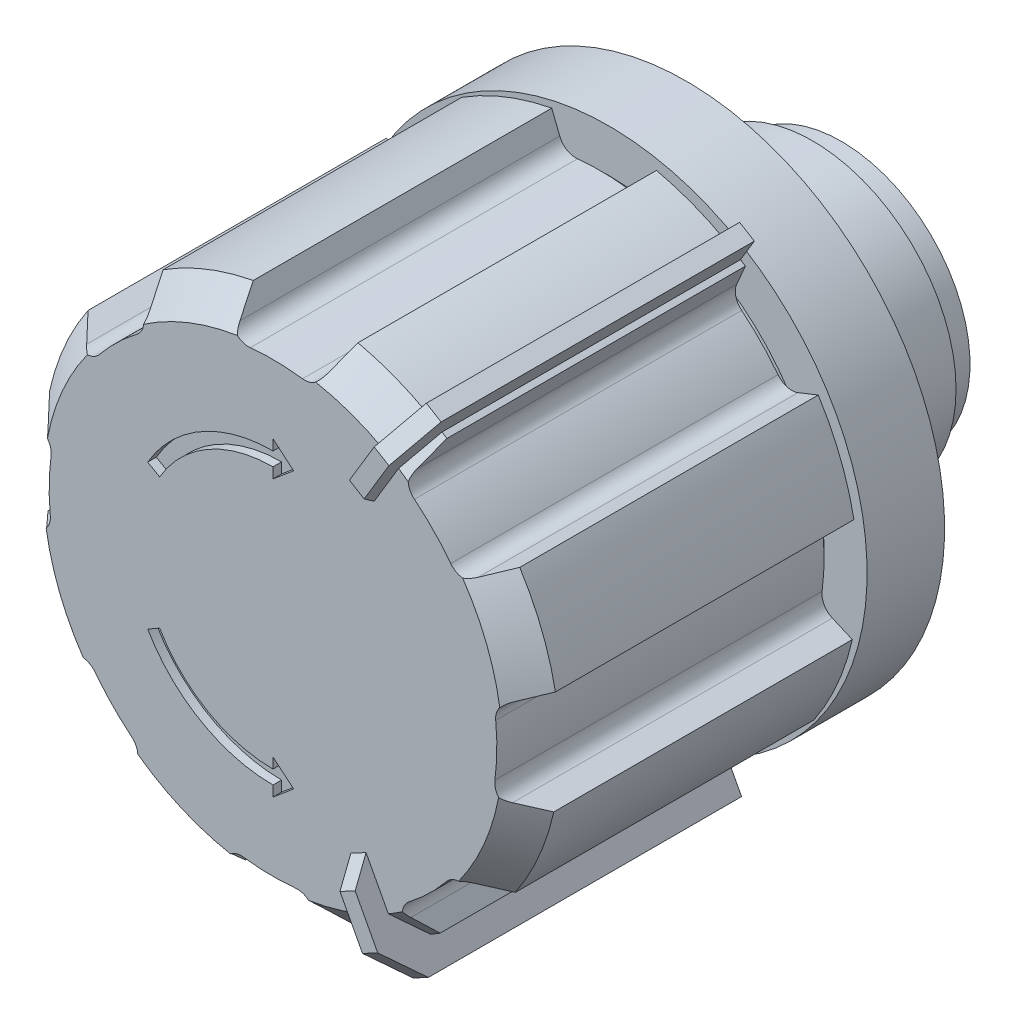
ISO-10303-21;
HEADER;
FILE_DESCRIPTION(('STEP AP214'),'2;1');
FILE_NAME('part.step','',(''),(''),'','','');
FILE_SCHEMA(('AUTOMOTIVE_DESIGN { 1 0 10303 214 1 1 1 1 }'));
ENDSEC;
DATA;
#1=APPLICATION_CONTEXT('core data for automotive mechanical design processes');
#2=APPLICATION_PROTOCOL_DEFINITION('international standard','automotive_design',2000,#1);
#3=PRODUCT_CONTEXT('',#1,'mechanical');
#4=PRODUCT('Part','Part','',(#3));
#5=PRODUCT_RELATED_PRODUCT_CATEGORY('part','',(#4));
#6=PRODUCT_DEFINITION_FORMATION('','',#4);
#7=PRODUCT_DEFINITION_CONTEXT('part definition',#1,'design');
#8=PRODUCT_DEFINITION('design','',#6,#7);
#9=PRODUCT_DEFINITION_SHAPE('','',#8);
#10=(LENGTH_UNIT() NAMED_UNIT(*) SI_UNIT(.MILLI.,.METRE.));
#11=(NAMED_UNIT(*) PLANE_ANGLE_UNIT() SI_UNIT($,.RADIAN.));
#12=(NAMED_UNIT(*) SI_UNIT($,.STERADIAN.) SOLID_ANGLE_UNIT());
#13=UNCERTAINTY_MEASURE_WITH_UNIT(LENGTH_MEASURE(1.E-05),#10,'distance_accuracy_value','');
#14=(GEOMETRIC_REPRESENTATION_CONTEXT(3) GLOBAL_UNCERTAINTY_ASSIGNED_CONTEXT((#13)) GLOBAL_UNIT_ASSIGNED_CONTEXT((#10,
#11,#12)) REPRESENTATION_CONTEXT('',''));
#15=CARTESIAN_POINT('',(0.,0.,0.));
#16=DIRECTION('',(0.,0.,1.));
#17=DIRECTION('',(1.,0.,0.));
#18=AXIS2_PLACEMENT_3D('',#15,#16,#17);
#19=CARTESIAN_POINT('',(0.,-0.75,15.));
#20=DIRECTION('',(0.,0.,-1.));
#21=DIRECTION('',(1.,0.,0.));
#22=AXIS2_PLACEMENT_3D('',#19,#20,#21);
#23=PLANE('',#22);
#24=DIRECTION('',(-0.866025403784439,-0.5,0.));
#25=VECTOR('',#24,1.);
#26=CARTESIAN_POINT('',(0.,4.61880215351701,15.));
#27=LINE('',#26,#25);
#28=CARTESIAN_POINT('',(-4.,2.3094010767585,15.));
#29=VERTEX_POINT('',#28);
#30=CARTESIAN_POINT('',(0.,4.61880215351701,15.));
#31=VERTEX_POINT('',#30);
#32=EDGE_CURVE('E1959',#29,#31,#27,.F.);
#33=ORIENTED_EDGE('',*,*,#32,.T.);
#34=DIRECTION('',(-0.866025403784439,0.5,0.));
#35=VECTOR('',#34,1.);
#36=CARTESIAN_POINT('',(4.,2.3094010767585,15.));
#37=LINE('',#36,#35);
#38=CARTESIAN_POINT('',(4.,2.3094010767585,15.));
#39=VERTEX_POINT('',#38);
#40=EDGE_CURVE('E1955',#31,#39,#37,.F.);
#41=ORIENTED_EDGE('',*,*,#40,.T.);
#42=DIRECTION('',(0.,-1.,0.));
#43=VECTOR('',#42,1.);
#44=CARTESIAN_POINT('',(4.,-2.3094010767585,15.));
#45=LINE('',#44,#43);
#46=CARTESIAN_POINT('',(4.,-2.3094010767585,15.));
#47=VERTEX_POINT('',#46);
#48=EDGE_CURVE('E1977',#39,#47,#45,.T.);
#49=ORIENTED_EDGE('',*,*,#48,.T.);
#50=DIRECTION('',(0.866025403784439,0.5,0.));
#51=VECTOR('',#50,1.);
#52=CARTESIAN_POINT('',(0.,-4.61880215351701,15.));
#53=LINE('',#52,#51);
#54=CARTESIAN_POINT('',(0.,-4.61880215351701,15.));
#55=VERTEX_POINT('',#54);
#56=EDGE_CURVE('E2060',#47,#55,#53,.F.);
#57=ORIENTED_EDGE('',*,*,#56,.T.);
#58=DIRECTION('',(0.866025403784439,-0.5,0.));
#59=VECTOR('',#58,1.);
#60=CARTESIAN_POINT('',(-4.,-2.3094010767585,15.));
#61=LINE('',#60,#59);
#62=CARTESIAN_POINT('',(-4.,-2.3094010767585,15.));
#63=VERTEX_POINT('',#62);
#64=EDGE_CURVE('E2061',#55,#63,#61,.F.);
#65=ORIENTED_EDGE('',*,*,#64,.T.);
#66=DIRECTION('',(0.,-1.,0.));
#67=VECTOR('',#66,1.);
#68=CARTESIAN_POINT('',(-4.,2.3094010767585,15.));
#69=LINE('',#68,#67);
#70=EDGE_CURVE('E1958',#63,#29,#69,.F.);
#71=ORIENTED_EDGE('',*,*,#70,.T.);
#72=EDGE_LOOP('',(#33,#41,#49,#57,#65,#71));
#73=FACE_BOUND('',#72,.T.);
#74=ADVANCED_FACE('F14',(#73),#23,.T.);
#75=CARTESIAN_POINT('',(4.,2.3094010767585,15.));
#76=DIRECTION('',(0.5,0.866025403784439,0.));
#77=DIRECTION('',(-0.866025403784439,0.5,0.));
#78=AXIS2_PLACEMENT_3D('',#75,#76,#77);
#79=PLANE('',#78);
#80=DIRECTION('',(0.,0.,1.));
#81=VECTOR('',#80,1.);
#82=CARTESIAN_POINT('',(4.,2.3094010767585,15.));
#83=LINE('',#82,#81);
#84=CARTESIAN_POINT('',(4.,2.3094010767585,6.));
#85=VERTEX_POINT('',#84);
#86=EDGE_CURVE('E2045',#85,#39,#83,.T.);
#87=ORIENTED_EDGE('',*,*,#86,.T.);
#88=ORIENTED_EDGE('',*,*,#40,.F.);
#89=DIRECTION('',(0.,0.,1.));
#90=VECTOR('',#89,1.);
#91=CARTESIAN_POINT('',(0.,4.61880215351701,15.));
#92=LINE('',#91,#90);
#93=CARTESIAN_POINT('',(0.,4.61880215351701,6.));
#94=VERTEX_POINT('',#93);
#95=EDGE_CURVE('E1946',#31,#94,#92,.F.);
#96=ORIENTED_EDGE('',*,*,#95,.T.);
#97=DIRECTION('',(-0.866025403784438,0.5,0.));
#98=VECTOR('',#97,1.);
#99=CARTESIAN_POINT('',(4.,2.3094010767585,6.));
#100=LINE('',#99,#98);
#101=EDGE_CURVE('E1951',#85,#94,#100,.T.);
#102=ORIENTED_EDGE('',*,*,#101,.F.);
#103=EDGE_LOOP('',(#87,#88,#96,#102));
#104=FACE_BOUND('',#103,.T.);
#105=ADVANCED_FACE('F1949',(#104),#79,.F.);
#106=CARTESIAN_POINT('',(0.,4.61880215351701,15.));
#107=DIRECTION('',(-0.5,0.866025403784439,0.));
#108=DIRECTION('',(-0.866025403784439,-0.5,0.));
#109=AXIS2_PLACEMENT_3D('',#106,#107,#108);
#110=PLANE('',#109);
#111=ORIENTED_EDGE('',*,*,#95,.F.);
#112=ORIENTED_EDGE('',*,*,#32,.F.);
#113=DIRECTION('',(0.,0.,-1.));
#114=VECTOR('',#113,1.);
#115=CARTESIAN_POINT('',(-4.,2.3094010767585,15.));
#116=LINE('',#115,#114);
#117=CARTESIAN_POINT('',(-4.,2.30940107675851,6.));
#118=VERTEX_POINT('',#117);
#119=EDGE_CURVE('E1965',#29,#118,#116,.T.);
#120=ORIENTED_EDGE('',*,*,#119,.T.);
#121=DIRECTION('',(-0.866025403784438,-0.5,0.));
#122=VECTOR('',#121,1.);
#123=CARTESIAN_POINT('',(0.,4.61880215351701,6.));
#124=LINE('',#123,#122);
#125=EDGE_CURVE('E1962',#94,#118,#124,.T.);
#126=ORIENTED_EDGE('',*,*,#125,.F.);
#127=EDGE_LOOP('',(#111,#112,#120,#126));
#128=FACE_BOUND('',#127,.T.);
#129=ADVANCED_FACE('F1963',(#128),#110,.F.);
#130=CARTESIAN_POINT('',(-4.,2.3094010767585,15.));
#131=DIRECTION('',(-1.,0.,0.));
#132=DIRECTION('',(0.,0.,-1.));
#133=AXIS2_PLACEMENT_3D('',#130,#131,#132);
#134=PLANE('',#133);
#135=ORIENTED_EDGE('',*,*,#119,.F.);
#136=ORIENTED_EDGE('',*,*,#70,.F.);
#137=DIRECTION('',(0.,0.,1.));
#138=VECTOR('',#137,1.);
#139=CARTESIAN_POINT('',(-4.,-2.3094010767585,15.));
#140=LINE('',#139,#138);
#141=CARTESIAN_POINT('',(-4.,-2.3094010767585,6.));
#142=VERTEX_POINT('',#141);
#143=EDGE_CURVE('E2055',#63,#142,#140,.F.);
#144=ORIENTED_EDGE('',*,*,#143,.T.);
#145=DIRECTION('',(0.,-1.,0.));
#146=VECTOR('',#145,1.);
#147=CARTESIAN_POINT('',(-4.,0.,6.));
#148=LINE('',#147,#146);
#149=EDGE_CURVE('E1969',#118,#142,#148,.T.);
#150=ORIENTED_EDGE('',*,*,#149,.F.);
#151=EDGE_LOOP('',(#135,#136,#144,#150));
#152=FACE_BOUND('',#151,.T.);
#153=ADVANCED_FACE('F2051',(#152),#134,.F.);
#154=CARTESIAN_POINT('',(-4.,-2.3094010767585,15.));
#155=DIRECTION('',(-0.5,-0.866025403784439,0.));
#156=DIRECTION('',(0.866025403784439,-0.5,0.));
#157=AXIS2_PLACEMENT_3D('',#154,#155,#156);
#158=PLANE('',#157);
#159=ORIENTED_EDGE('',*,*,#143,.F.);
#160=ORIENTED_EDGE('',*,*,#64,.F.);
#161=DIRECTION('',(0.,0.,1.));
#162=VECTOR('',#161,1.);
#163=CARTESIAN_POINT('',(0.,-4.61880215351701,15.));
#164=LINE('',#163,#162);
#165=CARTESIAN_POINT('',(0.,-4.61880215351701,6.));
#166=VERTEX_POINT('',#165);
#167=EDGE_CURVE('E2065',#55,#166,#164,.F.);
#168=ORIENTED_EDGE('',*,*,#167,.T.);
#169=DIRECTION('',(0.866025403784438,-0.5,0.));
#170=VECTOR('',#169,1.);
#171=CARTESIAN_POINT('',(-4.,-2.3094010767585,6.));
#172=LINE('',#171,#170);
#173=EDGE_CURVE('E2042',#142,#166,#172,.T.);
#174=ORIENTED_EDGE('',*,*,#173,.F.);
#175=EDGE_LOOP('',(#159,#160,#168,#174));
#176=FACE_BOUND('',#175,.T.);
#177=ADVANCED_FACE('F2063',(#176),#158,.F.);
#178=CARTESIAN_POINT('',(0.,-4.61880215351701,15.));
#179=DIRECTION('',(0.5,-0.866025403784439,0.));
#180=DIRECTION('',(0.866025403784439,0.5,0.));
#181=AXIS2_PLACEMENT_3D('',#178,#179,#180);
#182=PLANE('',#181);
#183=ORIENTED_EDGE('',*,*,#167,.F.);
#184=ORIENTED_EDGE('',*,*,#56,.F.);
#185=DIRECTION('',(0.,0.,1.));
#186=VECTOR('',#185,1.);
#187=CARTESIAN_POINT('',(4.,-2.3094010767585,15.));
#188=LINE('',#187,#186);
#189=CARTESIAN_POINT('',(4.,-2.30940107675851,6.));
#190=VERTEX_POINT('',#189);
#191=EDGE_CURVE('E1923',#47,#190,#188,.F.);
#192=ORIENTED_EDGE('',*,*,#191,.T.);
#193=DIRECTION('',(0.866025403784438,0.5,0.));
#194=VECTOR('',#193,1.);
#195=CARTESIAN_POINT('',(0.,-4.61880215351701,6.));
#196=LINE('',#195,#194);
#197=EDGE_CURVE('E2040',#166,#190,#196,.T.);
#198=ORIENTED_EDGE('',*,*,#197,.F.);
#199=EDGE_LOOP('',(#183,#184,#192,#198));
#200=FACE_BOUND('',#199,.T.);
#201=ADVANCED_FACE('F2069',(#200),#182,.F.);
#202=CARTESIAN_POINT('',(4.,-2.3094010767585,15.));
#203=DIRECTION('',(1.,0.,0.));
#204=DIRECTION('',(0.,0.,1.));
#205=AXIS2_PLACEMENT_3D('',#202,#203,#204);
#206=PLANE('',#205);
#207=ORIENTED_EDGE('',*,*,#191,.F.);
#208=ORIENTED_EDGE('',*,*,#48,.F.);
#209=ORIENTED_EDGE('',*,*,#86,.F.);
#210=DIRECTION('',(0.,-1.,0.));
#211=VECTOR('',#210,1.);
#212=CARTESIAN_POINT('',(4.,0.,6.));
#213=LINE('',#212,#211);
#214=EDGE_CURVE('E1975',#190,#85,#213,.F.);
#215=ORIENTED_EDGE('',*,*,#214,.F.);
#216=EDGE_LOOP('',(#207,#208,#209,#215));
#217=FACE_BOUND('',#216,.T.);
#218=ADVANCED_FACE('F2071',(#217),#206,.F.);
#219=CARTESIAN_POINT('',(0.,0.,6.));
#220=DIRECTION('',(0.,0.,1.));
#221=DIRECTION('',(-1.,0.,0.));
#222=AXIS2_PLACEMENT_3D('',#219,#220,#221);
#223=PLANE('',#222);
#224=ORIENTED_EDGE('',*,*,#197,.T.);
#225=ORIENTED_EDGE('',*,*,#214,.T.);
#226=ORIENTED_EDGE('',*,*,#101,.T.);
#227=ORIENTED_EDGE('',*,*,#125,.T.);
#228=ORIENTED_EDGE('',*,*,#149,.T.);
#229=ORIENTED_EDGE('',*,*,#173,.T.);
#230=EDGE_LOOP('',(#224,#225,#226,#227,#228,#229));
#231=FACE_BOUND('',#230,.T.);
#232=CARTESIAN_POINT('',(0.,0.,6.));
#233=DIRECTION('',(0.,0.,1.));
#234=DIRECTION('',(-1.,0.,0.));
#235=AXIS2_PLACEMENT_3D('',#232,#233,#234);
#236=CIRCLE('',#235,1.5);
#237=CARTESIAN_POINT('',(-1.49999999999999,0.,6.));
#238=VERTEX_POINT('',#237);
#239=EDGE_CURVE('E2029',#238,#238,#236,.F.);
#240=ORIENTED_EDGE('',*,*,#239,.T.);
#241=EDGE_LOOP('',(#240));
#242=FACE_BOUND('',#241,.T.);
#243=ADVANCED_FACE('F1973',(#231,#242),#223,.T.);
#244=CARTESIAN_POINT('',(0.,0.,5.5));
#245=DIRECTION('',(0.,0.,1.));
#246=DIRECTION('',(-1.,0.,0.));
#247=AXIS2_PLACEMENT_3D('',#244,#245,#246);
#248=CYLINDRICAL_SURFACE('',#247,1.5);
#249=ORIENTED_EDGE('',*,*,#239,.F.);
#250=EDGE_LOOP('',(#249));
#251=FACE_BOUND('',#250,.T.);
#252=CARTESIAN_POINT('',(0.,0.,-4.));
#253=DIRECTION('',(0.,0.,1.));
#254=DIRECTION('',(-1.,0.,0.));
#255=AXIS2_PLACEMENT_3D('',#252,#253,#254);
#256=CIRCLE('',#255,1.5);
#257=CARTESIAN_POINT('',(-1.50000000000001,0.,-4.));
#258=VERTEX_POINT('',#257);
#259=EDGE_CURVE('E2026',#258,#258,#256,.T.);
#260=ORIENTED_EDGE('',*,*,#259,.F.);
#261=EDGE_LOOP('',(#260));
#262=FACE_BOUND('',#261,.T.);
#263=ADVANCED_FACE('F2084',(#251,#262),#248,.F.);
#264=CARTESIAN_POINT('',(0.,-3.,-4.));
#265=DIRECTION('',(0.,0.,-1.));
#266=DIRECTION('',(1.,0.,0.));
#267=AXIS2_PLACEMENT_3D('',#264,#265,#266);
#268=PLANE('',#267);
#269=CARTESIAN_POINT('',(0.,0.,-4.));
#270=DIRECTION('',(0.,0.,1.));
#271=DIRECTION('',(-1.,0.,0.));
#272=AXIS2_PLACEMENT_3D('',#269,#270,#271);
#273=CIRCLE('',#272,4.5);
#274=CARTESIAN_POINT('',(-4.50000000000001,0.,-3.99999999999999));
#275=VERTEX_POINT('',#274);
#276=EDGE_CURVE('E2023',#275,#275,#273,.F.);
#277=ORIENTED_EDGE('',*,*,#276,.T.);
#278=EDGE_LOOP('',(#277));
#279=FACE_BOUND('',#278,.T.);
#280=ORIENTED_EDGE('',*,*,#259,.T.);
#281=EDGE_LOOP('',(#280));
#282=FACE_BOUND('',#281,.T.);
#283=ADVANCED_FACE('F2087',(#279,#282),#268,.T.);
#284=CARTESIAN_POINT('',(0.,0.,-6.5));
#285=DIRECTION('',(0.,0.,1.));
#286=DIRECTION('',(-1.,0.,0.));
#287=AXIS2_PLACEMENT_3D('',#284,#285,#286);
#288=CYLINDRICAL_SURFACE('',#287,4.5);
#289=ORIENTED_EDGE('',*,*,#276,.F.);
#290=EDGE_LOOP('',(#289));
#291=FACE_BOUND('',#290,.T.);
#292=CARTESIAN_POINT('',(0.,0.,-9.));
#293=DIRECTION('',(0.,0.,1.));
#294=DIRECTION('',(-1.,0.,0.));
#295=AXIS2_PLACEMENT_3D('',#292,#293,#294);
#296=CIRCLE('',#295,4.5);
#297=CARTESIAN_POINT('',(-4.50000000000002,0.,-8.99999999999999));
#298=VERTEX_POINT('',#297);
#299=EDGE_CURVE('E2020',#298,#298,#296,.T.);
#300=ORIENTED_EDGE('',*,*,#299,.F.);
#301=EDGE_LOOP('',(#300));
#302=FACE_BOUND('',#301,.T.);
#303=ADVANCED_FACE('F2091',(#291,#302),#288,.F.);
#304=CARTESIAN_POINT('',(0.,-5.9875,-9.));
#305=DIRECTION('',(0.,0.,-1.));
#306=DIRECTION('',(1.,0.,0.));
#307=AXIS2_PLACEMENT_3D('',#304,#305,#306);
#308=PLANE('',#307);
#309=CARTESIAN_POINT('',(0.,0.,-9.));
#310=DIRECTION('',(0.,0.,1.));
#311=DIRECTION('',(-1.,0.,0.));
#312=AXIS2_PLACEMENT_3D('',#309,#310,#311);
#313=CIRCLE('',#312,7.475);
#314=CARTESIAN_POINT('',(-7.47500000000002,0.,-8.99999999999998));
#315=VERTEX_POINT('',#314);
#316=EDGE_CURVE('E2017',#315,#315,#313,.T.);
#317=ORIENTED_EDGE('',*,*,#316,.F.);
#318=EDGE_LOOP('',(#317));
#319=FACE_BOUND('',#318,.T.);
#320=ORIENTED_EDGE('',*,*,#299,.T.);
#321=EDGE_LOOP('',(#320));
#322=FACE_BOUND('',#321,.T.);
#323=ADVANCED_FACE('F2095',(#319,#322),#308,.T.);
#324=CARTESIAN_POINT('',(0.,0.,-8.16666666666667));
#325=DIRECTION('',(0.,0.,1.));
#326=DIRECTION('',(-1.,0.,0.));
#327=AXIS2_PLACEMENT_3D('',#324,#325,#326);
#328=CYLINDRICAL_SURFACE('',#327,7.475);
#329=ORIENTED_EDGE('',*,*,#316,.T.);
#330=EDGE_LOOP('',(#329));
#331=FACE_BOUND('',#330,.T.);
#332=CARTESIAN_POINT('',(0.,0.,-7.33333333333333));
#333=DIRECTION('',(0.,0.,1.));
#334=DIRECTION('',(-1.,0.,0.));
#335=AXIS2_PLACEMENT_3D('',#332,#333,#334);
#336=CIRCLE('',#335,7.475);
#337=CARTESIAN_POINT('',(-7.47500000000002,0.,-7.33333333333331));
#338=VERTEX_POINT('',#337);
#339=EDGE_CURVE('E2011',#338,#338,#336,.T.);
#340=ORIENTED_EDGE('',*,*,#339,.F.);
#341=EDGE_LOOP('',(#340));
#342=FACE_BOUND('',#341,.T.);
#343=ADVANCED_FACE('F2099',(#331,#342),#328,.T.);
#344=CARTESIAN_POINT('',(0.,-7.903,-7.33333333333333));
#345=DIRECTION('',(0.,0.,-1.));
#346=DIRECTION('',(0.,1.,0.));
#347=AXIS2_PLACEMENT_3D('',#344,#345,#346);
#348=PLANE('',#347);
#349=CARTESIAN_POINT('',(0.,0.,-7.33333333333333));
#350=DIRECTION('',(0.,0.,1.));
#351=DIRECTION('',(-1.,0.,0.));
#352=AXIS2_PLACEMENT_3D('',#349,#350,#351);
#353=CIRCLE('',#352,8.331);
#354=CARTESIAN_POINT('',(-8.33100000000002,0.,-7.33333333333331));
#355=VERTEX_POINT('',#354);
#356=EDGE_CURVE('E2007',#355,#355,#353,.T.);
#357=ORIENTED_EDGE('',*,*,#356,.F.);
#358=EDGE_LOOP('',(#357));
#359=FACE_BOUND('',#358,.T.);
#360=ORIENTED_EDGE('',*,*,#339,.T.);
#361=EDGE_LOOP('',(#360));
#362=FACE_BOUND('',#361,.T.);
#363=ADVANCED_FACE('F2103',(#359,#362),#348,.T.);
#364=CARTESIAN_POINT('',(0.,0.,-3.97916666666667));
#365=DIRECTION('',(0.,0.,1.));
#366=DIRECTION('',(-1.,0.,0.));
#367=AXIS2_PLACEMENT_3D('',#364,#365,#366);
#368=CYLINDRICAL_SURFACE('',#367,8.331);
#369=ORIENTED_EDGE('',*,*,#356,.T.);
#370=EDGE_LOOP('',(#369));
#371=FACE_BOUND('',#370,.T.);
#372=CARTESIAN_POINT('',(0.,0.,-0.625));
#373=DIRECTION('',(0.,0.,1.));
#374=DIRECTION('',(-1.,0.,0.));
#375=AXIS2_PLACEMENT_3D('',#372,#373,#374);
#376=CIRCLE('',#375,8.331);
#377=CARTESIAN_POINT('',(-8.331,0.,-0.624999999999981));
#378=VERTEX_POINT('',#377);
#379=EDGE_CURVE('E2004',#378,#378,#376,.T.);
#380=ORIENTED_EDGE('',*,*,#379,.F.);
#381=EDGE_LOOP('',(#380));
#382=FACE_BOUND('',#381,.T.);
#383=ADVANCED_FACE('F2106',(#371,#382),#368,.T.);
#384=CARTESIAN_POINT('',(0.,-8.853,-0.625));
#385=DIRECTION('',(0.,0.,-1.));
#386=DIRECTION('',(1.,0.,0.));
#387=AXIS2_PLACEMENT_3D('',#384,#385,#386);
#388=PLANE('',#387);
#389=CARTESIAN_POINT('',(0.,0.,-0.625));
#390=DIRECTION('',(0.,0.,1.));
#391=DIRECTION('',(1.,0.,0.));
#392=AXIS2_PLACEMENT_3D('',#389,#390,#391);
#393=CIRCLE('',#392,9.375);
#394=CARTESIAN_POINT('',(9.375,0.,-0.625000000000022));
#395=VERTEX_POINT('',#394);
#396=CARTESIAN_POINT('',(-9.375,0.,-0.624999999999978));
#397=VERTEX_POINT('',#396);
#398=EDGE_CURVE('E1275',#395,#397,#393,.T.);
#399=ORIENTED_EDGE('',*,*,#398,.F.);
#400=CARTESIAN_POINT('',(0.,0.,-0.625));
#401=DIRECTION('',(0.,0.,1.));
#402=DIRECTION('',(0.,-1.,0.));
#403=AXIS2_PLACEMENT_3D('',#400,#401,#402);
#404=CIRCLE('',#403,9.375);
#405=CARTESIAN_POINT('',(0.,-9.375,-0.625));
#406=VERTEX_POINT('',#405);
#407=EDGE_CURVE('E1915',#406,#395,#404,.T.);
#408=ORIENTED_EDGE('',*,*,#407,.F.);
#409=CARTESIAN_POINT('',(0.,0.,-0.625));
#410=DIRECTION('',(0.,0.,1.));
#411=DIRECTION('',(-1.,0.,0.));
#412=AXIS2_PLACEMENT_3D('',#409,#410,#411);
#413=CIRCLE('',#412,9.375);
#414=EDGE_CURVE('E1982',#397,#406,#413,.T.);
#415=ORIENTED_EDGE('',*,*,#414,.F.);
#416=EDGE_LOOP('',(#399,#408,#415));
#417=FACE_BOUND('',#416,.T.);
#418=ORIENTED_EDGE('',*,*,#379,.T.);
#419=EDGE_LOOP('',(#418));
#420=FACE_BOUND('',#419,.T.);
#421=ADVANCED_FACE('F1290',(#417,#420),#388,.T.);
#422=CARTESIAN_POINT('',(0.,0.,0.));
#423=DIRECTION('',(0.,0.,-1.));
#424=DIRECTION('',(1.,0.,0.));
#425=AXIS2_PLACEMENT_3D('',#422,#423,#424);
#426=TOROIDAL_SURFACE('',#425,9.375,0.625);
#427=ORIENTED_EDGE('',*,*,#407,.T.);
#428=ORIENTED_EDGE('',*,*,#398,.T.);
#429=ORIENTED_EDGE('',*,*,#414,.T.);
#430=EDGE_LOOP('',(#427,#428,#429));
#431=FACE_BOUND('',#430,.T.);
#432=CARTESIAN_POINT('',(0.,0.,0.));
#433=DIRECTION('',(0.,0.,-1.));
#434=DIRECTION('',(1.,0.,0.));
#435=AXIS2_PLACEMENT_3D('',#432,#433,#434);
#436=CIRCLE('',#435,10.);
#437=CARTESIAN_POINT('',(10.,0.,0.));
#438=VERTEX_POINT('',#437);
#439=EDGE_CURVE('E2000',#438,#438,#436,.F.);
#440=ORIENTED_EDGE('',*,*,#439,.F.);
#441=EDGE_LOOP('',(#440));
#442=FACE_BOUND('',#441,.T.);
#443=ADVANCED_FACE('F1278',(#431,#442),#426,.T.);
#444=CARTESIAN_POINT('',(0.,-12.5,0.));
#445=DIRECTION('',(0.,0.,-1.));
#446=DIRECTION('',(1.,0.,0.));
#447=AXIS2_PLACEMENT_3D('',#444,#445,#446);
#448=PLANE('',#447);
#449=CARTESIAN_POINT('',(0.,0.,0.));
#450=DIRECTION('',(0.,0.,1.));
#451=DIRECTION('',(-1.,0.,0.));
#452=AXIS2_PLACEMENT_3D('',#449,#450,#451);
#453=CIRCLE('',#452,15.);
#454=CARTESIAN_POINT('',(-15.,0.,0.));
#455=VERTEX_POINT('',#454);
#456=EDGE_CURVE('E2002',#455,#455,#453,.T.);
#457=ORIENTED_EDGE('',*,*,#456,.F.);
#458=EDGE_LOOP('',(#457));
#459=FACE_BOUND('',#458,.T.);
#460=ORIENTED_EDGE('',*,*,#439,.T.);
#461=EDGE_LOOP('',(#460));
#462=FACE_BOUND('',#461,.T.);
#463=ADVANCED_FACE('F1289',(#459,#462),#448,.T.);
#464=CARTESIAN_POINT('',(0.,0.,2.25));
#465=DIRECTION('',(0.,0.,1.));
#466=DIRECTION('',(-1.,0.,0.));
#467=AXIS2_PLACEMENT_3D('',#464,#465,#466);
#468=CYLINDRICAL_SURFACE('',#467,15.);
#469=ORIENTED_EDGE('',*,*,#456,.T.);
#470=EDGE_LOOP('',(#469));
#471=FACE_BOUND('',#470,.T.);
#472=CARTESIAN_POINT('',(0.,0.,4.5));
#473=DIRECTION('',(0.,0.,1.));
#474=DIRECTION('',(-1.,0.,0.));
#475=AXIS2_PLACEMENT_3D('',#472,#473,#474);
#476=CIRCLE('',#475,15.);
#477=CARTESIAN_POINT('',(-15.,0.,4.50000000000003));
#478=VERTEX_POINT('',#477);
#479=EDGE_CURVE('E1269',#478,#478,#476,.T.);
#480=ORIENTED_EDGE('',*,*,#479,.F.);
#481=EDGE_LOOP('',(#480));
#482=FACE_BOUND('',#481,.T.);
#483=ADVANCED_FACE('F2134',(#471,#482),#468,.T.);
#484=CARTESIAN_POINT('',(0.,-13.75,4.5));
#485=DIRECTION('',(0.,0.,1.));
#486=DIRECTION('',(-1.,0.,0.));
#487=AXIS2_PLACEMENT_3D('',#484,#485,#486);
#488=PLANE('',#487);
#489=CARTESIAN_POINT('',(0.,0.,4.5));
#490=DIRECTION('',(0.,0.,1.));
#491=DIRECTION('',(-1.,0.,0.));
#492=AXIS2_PLACEMENT_3D('',#489,#490,#491);
#493=CIRCLE('',#492,12.5);
#494=CARTESIAN_POINT('',(-12.5,0.,4.50000000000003));
#495=VERTEX_POINT('',#494);
#496=EDGE_CURVE('E1266',#495,#495,#493,.T.);
#497=ORIENTED_EDGE('',*,*,#496,.F.);
#498=EDGE_LOOP('',(#497));
#499=FACE_BOUND('',#498,.T.);
#500=ORIENTED_EDGE('',*,*,#479,.T.);
#501=EDGE_LOOP('',(#500));
#502=FACE_BOUND('',#501,.T.);
#503=ADVANCED_FACE('F2142',(#499,#502),#488,.T.);
#504=CARTESIAN_POINT('',(7.57673753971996,-11.4877346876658,24.));
#505=DIRECTION('',(-0.9296875,-0.368349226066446,0.));
#506=DIRECTION('',(0.368349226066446,-0.9296875,0.));
#507=AXIS2_PLACEMENT_3D('',#504,#505,#506);
#508=PLANE('',#507);
#509=DIRECTION('',(0.,0.,1.));
#510=VECTOR('',#509,1.);
#511=CARTESIAN_POINT('',(8.04199218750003,-12.6620046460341,13.6666666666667));
#512=LINE('',#511,#510);
#513=CARTESIAN_POINT('',(8.0419921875,-12.6620046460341,5.));
#514=VERTEX_POINT('',#513);
#515=CARTESIAN_POINT('',(8.04199218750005,-12.6620046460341,22.3333333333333));
#516=VERTEX_POINT('',#515);
#517=EDGE_CURVE('E1027',#514,#516,#512,.T.);
#518=ORIENTED_EDGE('',*,*,#517,.F.);
#519=DIRECTION('',(0.368349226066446,-0.9296875,0.));
#520=VECTOR('',#519,1.);
#521=CARTESIAN_POINT('',(7.57673753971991,-11.4877346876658,5.));
#522=LINE('',#521,#520);
#523=CARTESIAN_POINT('',(7.57673753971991,-11.4877346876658,5.));
#524=VERTEX_POINT('',#523);
#525=EDGE_CURVE('E1267',#524,#514,#522,.T.);
#526=ORIENTED_EDGE('',*,*,#525,.F.);
#527=DIRECTION('',(0.,0.,1.));
#528=VECTOR('',#527,1.);
#529=CARTESIAN_POINT('',(7.57673753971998,-11.4877346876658,24.));
#530=LINE('',#529,#528);
#531=CARTESIAN_POINT('',(7.57673753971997,-11.4877346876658,23.5719743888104));
#532=VERTEX_POINT('',#531);
#533=EDGE_CURVE('E707',#524,#532,#530,.T.);
#534=ORIENTED_EDGE('',*,*,#533,.T.);
#535=CARTESIAN_POINT('',(8.04199218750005,-12.6620046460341,22.3333333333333));
#536=CARTESIAN_POINT('',(7.96451498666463,-12.4664576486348,22.5399541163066));
#537=CARTESIAN_POINT('',(7.88700516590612,-12.2708283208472,22.7464845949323));
#538=CARTESIAN_POINT('',(7.73192028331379,-11.8794050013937,23.1593649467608));
#539=CARTESIAN_POINT('',(7.65434522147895,-11.6836110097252,23.3657148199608));
#540=CARTESIAN_POINT('',(7.57673753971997,-11.4877346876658,23.5719743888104));
#541=B_SPLINE_CURVE_WITH_KNOTS('',3,(#535,#536,#537,#538,#539,#540),.UNSPECIFIED.,.F.,.F.,(4,2,
4),(0.,0.884534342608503,1.76906869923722),.UNSPECIFIED.);
#542=EDGE_CURVE('E1026',#516,#532,#541,.T.);
#543=ORIENTED_EDGE('',*,*,#542,.F.);
#544=EDGE_LOOP('',(#518,#526,#534,#543));
#545=FACE_BOUND('',#544,.T.);
#546=ADVANCED_FACE('F2150',(#545),#508,.F.);
#547=CARTESIAN_POINT('',(0.,0.,4.75));
#548=DIRECTION('',(0.,0.,1.));
#549=DIRECTION('',(-1.,0.,0.));
#550=AXIS2_PLACEMENT_3D('',#547,#548,#549);
#551=CYLINDRICAL_SURFACE('',#550,12.5);
#552=ORIENTED_EDGE('',*,*,#496,.T.);
#553=EDGE_LOOP('',(#552));
#554=FACE_BOUND('',#553,.T.);
#555=CARTESIAN_POINT('',(0.,0.,5.));
#556=DIRECTION('',(0.,0.,1.));
#557=DIRECTION('',(-1.,0.,0.));
#558=AXIS2_PLACEMENT_3D('',#555,#556,#557);
#559=CIRCLE('',#558,12.5);
#560=CARTESIAN_POINT('',(-12.5,0.,5.00000000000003));
#561=VERTEX_POINT('',#560);
#562=EDGE_CURVE('E796',#561,#561,#559,.T.);
#563=ORIENTED_EDGE('',*,*,#562,.F.);
#564=EDGE_LOOP('',(#563));
#565=FACE_BOUND('',#564,.T.);
#566=ADVANCED_FACE('F2159',(#554,#565),#551,.T.);
#567=CARTESIAN_POINT('',(8.42975160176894,12.4072272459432,24.));
#568=DIRECTION('',(-0.917850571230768,0.396926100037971,0.));
#569=DIRECTION('',(-0.396926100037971,-0.917850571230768,0.));
#570=AXIS2_PLACEMENT_3D('',#567,#568,#569);
#571=PLANE('',#570);
#572=DIRECTION('',(0.,0.,1.));
#573=VECTOR('',#572,1.);
#574=CARTESIAN_POINT('',(7.92840206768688,11.2479082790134,24.));
#575=LINE('',#574,#573);
#576=CARTESIAN_POINT('',(7.9284020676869,11.2479082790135,23.5719743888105));
#577=VERTEX_POINT('',#576);
#578=CARTESIAN_POINT('',(7.92840206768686,11.2479082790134,5.));
#579=VERTEX_POINT('',#578);
#580=EDGE_CURVE('E793',#577,#579,#575,.F.);
#581=ORIENTED_EDGE('',*,*,#580,.T.);
#582=DIRECTION('',(-0.396926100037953,-0.917850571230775,0.));
#583=VECTOR('',#582,1.);
#584=CARTESIAN_POINT('',(8.42975160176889,12.4072272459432,5.));
#585=LINE('',#584,#583);
#586=CARTESIAN_POINT('',(8.42975160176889,12.4072272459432,5.));
#587=VERTEX_POINT('',#586);
#588=EDGE_CURVE('E789',#587,#579,#585,.T.);
#589=ORIENTED_EDGE('',*,*,#588,.F.);
#590=DIRECTION('',(0.,0.,1.));
#591=VECTOR('',#590,1.);
#592=CARTESIAN_POINT('',(8.42975160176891,12.4072272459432,13.6666666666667));
#593=LINE('',#592,#591);
#594=CARTESIAN_POINT('',(8.42975160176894,12.4072272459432,22.3333333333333));
#595=VERTEX_POINT('',#594);
#596=EDGE_CURVE('E1264',#595,#587,#593,.F.);
#597=ORIENTED_EDGE('',*,*,#596,.F.);
#598=CARTESIAN_POINT('',(7.9284020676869,11.2479082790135,23.5719743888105));
#599=CARTESIAN_POINT('',(8.01203062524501,11.4412906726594,23.3657148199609));
#600=CARTESIAN_POINT('',(8.09562403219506,11.6345917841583,23.1593649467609));
#601=CARTESIAN_POINT('',(8.26274054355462,12.0210314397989,22.7464845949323));
#602=CARTESIAN_POINT('',(8.34626364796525,12.2141699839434,22.5399541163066));
#603=CARTESIAN_POINT('',(8.42975160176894,12.4072272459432,22.3333333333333));
#604=B_SPLINE_CURVE_WITH_KNOTS('',3,(#598,#599,#600,#601,#602,#603),.UNSPECIFIED.,.F.,.F.,(4,2,
4),(0.,0.884534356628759,1.7690686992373),.UNSPECIFIED.);
#605=EDGE_CURVE('E1212',#577,#595,#604,.T.);
#606=ORIENTED_EDGE('',*,*,#605,.F.);
#607=EDGE_LOOP('',(#581,#589,#597,#606));
#608=FACE_BOUND('',#607,.T.);
#609=ADVANCED_FACE('F1730',(#608),#571,.F.);
#610=CARTESIAN_POINT('',(0.,0.,23.5));
#611=DIRECTION('',(0.,0.,1.));
#612=DIRECTION('',(-1.,0.,0.));
#613=AXIS2_PLACEMENT_3D('',#610,#611,#612);
#614=PLANE('',#613);
#615=DIRECTION('',(0.766044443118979,0.642787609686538,0.));
#616=VECTOR('',#615,1.);
#617=CARTESIAN_POINT('',(0.,6.99308044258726,23.5));
#618=LINE('',#617,#616);
#619=CARTESIAN_POINT('',(0.,6.99308044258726,23.5));
#620=VERTEX_POINT('',#619);
#621=CARTESIAN_POINT('',(1.20000000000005,8.,23.5));
#622=VERTEX_POINT('',#621);
#623=EDGE_CURVE('E987',#620,#622,#618,.T.);
#624=ORIENTED_EDGE('',*,*,#623,.T.);
#625=DIRECTION('',(-0.766044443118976,0.642787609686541,0.));
#626=VECTOR('',#625,1.);
#627=CARTESIAN_POINT('',(1.20000000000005,8.,23.5));
#628=LINE('',#627,#626);
#629=CARTESIAN_POINT('',(0.,9.00691955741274,23.5));
#630=VERTEX_POINT('',#629);
#631=EDGE_CURVE('E997',#622,#630,#628,.T.);
#632=ORIENTED_EDGE('',*,*,#631,.T.);
#633=DIRECTION('',(0.,-1.,0.));
#634=VECTOR('',#633,1.);
#635=CARTESIAN_POINT('',(0.,9.00691955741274,23.5));
#636=LINE('',#635,#634);
#637=CARTESIAN_POINT('',(0.,8.4,23.5));
#638=VERTEX_POINT('',#637);
#639=EDGE_CURVE('E799',#630,#638,#636,.T.);
#640=ORIENTED_EDGE('',*,*,#639,.T.);
#641=CARTESIAN_POINT('',(0.,0.,23.5));
#642=DIRECTION('',(0.,0.,1.));
#643=DIRECTION('',(-1.,0.,0.));
#644=AXIS2_PLACEMENT_3D('',#641,#642,#643);
#645=CIRCLE('',#644,8.4);
#646=CARTESIAN_POINT('',(-7.27461339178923,4.2,23.5));
#647=VERTEX_POINT('',#646);
#648=EDGE_CURVE('E976',#638,#647,#645,.T.);
#649=ORIENTED_EDGE('',*,*,#648,.T.);
#650=DIRECTION('',(0.866025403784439,-0.5,0.));
#651=VECTOR('',#650,1.);
#652=CARTESIAN_POINT('',(-7.27461339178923,4.2,23.5));
#653=LINE('',#652,#651);
#654=CARTESIAN_POINT('',(-6.58179306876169,3.8,23.5));
#655=VERTEX_POINT('',#654);
#656=EDGE_CURVE('E973',#647,#655,#653,.T.);
#657=ORIENTED_EDGE('',*,*,#656,.T.);
#658=CARTESIAN_POINT('',(0.,0.,23.5));
#659=DIRECTION('',(0.,0.,1.));
#660=DIRECTION('',(-1.,0.,0.));
#661=AXIS2_PLACEMENT_3D('',#658,#659,#660);
#662=CIRCLE('',#661,7.6);
#663=CARTESIAN_POINT('',(0.,7.6,23.5));
#664=VERTEX_POINT('',#663);
#665=EDGE_CURVE('E982',#664,#655,#662,.T.);
#666=ORIENTED_EDGE('',*,*,#665,.F.);
#667=DIRECTION('',(0.,-1.,0.));
#668=VECTOR('',#667,1.);
#669=CARTESIAN_POINT('',(0.,7.6,23.5));
#670=LINE('',#669,#668);
#671=EDGE_CURVE('E986',#664,#620,#670,.T.);
#672=ORIENTED_EDGE('',*,*,#671,.T.);
#673=EDGE_LOOP('',(#624,#632,#640,#649,#657,#666,#672));
#674=FACE_BOUND('',#673,.T.);
#675=ADVANCED_FACE('F2175',(#674),#614,.T.);
#676=CARTESIAN_POINT('',(0.,0.,23.5));
#677=DIRECTION('',(0.,0.,1.));
#678=DIRECTION('',(-1.,0.,0.));
#679=AXIS2_PLACEMENT_3D('',#676,#677,#678);
#680=PLANE('',#679);
#681=DIRECTION('',(0.766044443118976,0.642787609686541,0.));
#682=VECTOR('',#681,1.);
#683=CARTESIAN_POINT('',(0.,-9.00691955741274,23.5));
#684=LINE('',#683,#682);
#685=CARTESIAN_POINT('',(0.,-9.00691955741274,23.5));
#686=VERTEX_POINT('',#685);
#687=CARTESIAN_POINT('',(1.20000000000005,-8.,23.5));
#688=VERTEX_POINT('',#687);
#689=EDGE_CURVE('E947',#686,#688,#684,.T.);
#690=ORIENTED_EDGE('',*,*,#689,.T.);
#691=DIRECTION('',(-0.766044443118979,0.642787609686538,0.));
#692=VECTOR('',#691,1.);
#693=CARTESIAN_POINT('',(1.20000000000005,-8.,23.5));
#694=LINE('',#693,#692);
#695=CARTESIAN_POINT('',(0.,-6.99308044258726,23.5));
#696=VERTEX_POINT('',#695);
#697=EDGE_CURVE('E957',#688,#696,#694,.T.);
#698=ORIENTED_EDGE('',*,*,#697,.T.);
#699=DIRECTION('',(0.,-1.,0.));
#700=VECTOR('',#699,1.);
#701=CARTESIAN_POINT('',(0.,-6.99308044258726,23.5));
#702=LINE('',#701,#700);
#703=CARTESIAN_POINT('',(0.,-7.6,23.5));
#704=VERTEX_POINT('',#703);
#705=EDGE_CURVE('E967',#696,#704,#702,.T.);
#706=ORIENTED_EDGE('',*,*,#705,.T.);
#707=CARTESIAN_POINT('',(0.,0.,23.5));
#708=DIRECTION('',(0.,0.,1.));
#709=DIRECTION('',(-1.,0.,0.));
#710=AXIS2_PLACEMENT_3D('',#707,#708,#709);
#711=CIRCLE('',#710,7.6);
#712=CARTESIAN_POINT('',(-6.58179306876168,-3.8,23.5));
#713=VERTEX_POINT('',#712);
#714=EDGE_CURVE('E934',#713,#704,#711,.T.);
#715=ORIENTED_EDGE('',*,*,#714,.F.);
#716=DIRECTION('',(-0.866025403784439,-0.5,0.));
#717=VECTOR('',#716,1.);
#718=CARTESIAN_POINT('',(-6.58179306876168,-3.8,23.5));
#719=LINE('',#718,#717);
#720=CARTESIAN_POINT('',(-7.27461339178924,-4.2,23.5));
#721=VERTEX_POINT('',#720);
#722=EDGE_CURVE('E939',#713,#721,#719,.T.);
#723=ORIENTED_EDGE('',*,*,#722,.T.);
#724=CARTESIAN_POINT('',(0.,0.,23.5));
#725=DIRECTION('',(0.,0.,1.));
#726=DIRECTION('',(-1.,0.,0.));
#727=AXIS2_PLACEMENT_3D('',#724,#725,#726);
#728=CIRCLE('',#727,8.4);
#729=CARTESIAN_POINT('',(0.,-8.4,23.5));
#730=VERTEX_POINT('',#729);
#731=EDGE_CURVE('E940',#721,#730,#728,.T.);
#732=ORIENTED_EDGE('',*,*,#731,.T.);
#733=DIRECTION('',(0.,-1.,0.));
#734=VECTOR('',#733,1.);
#735=CARTESIAN_POINT('',(0.,-8.4,23.5));
#736=LINE('',#735,#734);
#737=EDGE_CURVE('E943',#730,#686,#736,.T.);
#738=ORIENTED_EDGE('',*,*,#737,.T.);
#739=EDGE_LOOP('',(#690,#698,#706,#715,#723,#732,#738));
#740=FACE_BOUND('',#739,.T.);
#741=ADVANCED_FACE('F2182',(#740),#680,.T.);
#742=CARTESIAN_POINT('',(0.,0.,13.6666666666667));
#743=DIRECTION('',(0.,0.,1.));
#744=DIRECTION('',(-1.,0.,0.));
#745=AXIS2_PLACEMENT_3D('',#742,#743,#744);
#746=CYLINDRICAL_SURFACE('',#745,15.);
#747=ORIENTED_EDGE('',*,*,#596,.T.);
#748=CARTESIAN_POINT('',(0.,0.,5.));
#749=DIRECTION('',(0.,0.,1.));
#750=DIRECTION('',(-1.,0.,0.));
#751=AXIS2_PLACEMENT_3D('',#748,#749,#750);
#752=CIRCLE('',#751,15.);
#753=CARTESIAN_POINT('',(8.14986159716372,12.5928454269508,5.));
#754=VERTEX_POINT('',#753);
#755=EDGE_CURVE('E792',#754,#587,#752,.F.);
#756=ORIENTED_EDGE('',*,*,#755,.F.);
#757=DIRECTION('',(0.,0.,1.));
#758=VECTOR('',#757,1.);
#759=CARTESIAN_POINT('',(8.14986159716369,12.5928454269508,-9.));
#760=LINE('',#759,#758);
#761=CARTESIAN_POINT('',(8.14986159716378,12.5928454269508,22.3333333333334));
#762=VERTEX_POINT('',#761);
#763=EDGE_CURVE('E1213',#754,#762,#760,.T.);
#764=ORIENTED_EDGE('',*,*,#763,.T.);
#765=CARTESIAN_POINT('',(0.,0.,22.3333333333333));
#766=DIRECTION('',(0.,0.,-1.));
#767=DIRECTION('',(0.,-1.,0.));
#768=AXIS2_PLACEMENT_3D('',#765,#766,#767);
#769=CIRCLE('',#768,15.);
#770=EDGE_CURVE('E1194',#595,#762,#769,.F.);
#771=ORIENTED_EDGE('',*,*,#770,.F.);
#772=EDGE_LOOP('',(#747,#756,#764,#771));
#773=FACE_BOUND('',#772,.T.);
#774=ADVANCED_FACE('F1458',(#773),#746,.T.);
#775=CARTESIAN_POINT('',(0.,0.,22.3333333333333));
#776=DIRECTION('',(0.,0.,-1.));
#777=DIRECTION('',(1.,0.,0.));
#778=AXIS2_PLACEMENT_3D('',#775,#776,#777);
#779=CONICAL_SURFACE('',#778,15.,0.785398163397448);
#780=ORIENTED_EDGE('',*,*,#605,.T.);
#781=ORIENTED_EDGE('',*,*,#770,.T.);
#782=CARTESIAN_POINT('',(8.14986159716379,12.5928454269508,22.3333333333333));
#783=CARTESIAN_POINT('',(8.00671123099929,12.3546032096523,22.6111213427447));
#784=CARTESIAN_POINT('',(7.86355823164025,12.1163566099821,22.8889042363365));
#785=CARTESIAN_POINT('',(7.57724696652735,11.6398546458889,23.444459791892));
#786=CARTESIAN_POINT('',(7.43408870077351,11.4015992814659,23.7222324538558));
#787=CARTESIAN_POINT('',(7.29092780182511,11.1633395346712,24.));
#788=B_SPLINE_CURVE_WITH_KNOTS('',3,(#782,#783,#784,#785,#786,#787),.UNSPECIFIED.,.F.,.F.,(4,2,
4),(0.,1.17887999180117,2.35775998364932),.UNSPECIFIED.);
#789=CARTESIAN_POINT('',(7.29092780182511,11.1633395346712,24.));
#790=VERTEX_POINT('',#789);
#791=EDGE_CURVE('E928',#762,#790,#788,.T.);
#792=ORIENTED_EDGE('',*,*,#791,.T.);
#793=CARTESIAN_POINT('',(0.,0.,24.));
#794=DIRECTION('',(0.,0.,-1.));
#795=DIRECTION('',(1.,0.,0.));
#796=AXIS2_PLACEMENT_3D('',#793,#794,#795);
#797=CIRCLE('',#796,13.3333333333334);
#798=CARTESIAN_POINT('',(7.84889450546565,10.7783409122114,24.));
#799=VERTEX_POINT('',#798);
#800=EDGE_CURVE('E348',#790,#799,#797,.T.);
#801=ORIENTED_EDGE('',*,*,#800,.T.);
#802=CARTESIAN_POINT('',(7.84889450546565,10.7783409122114,24.));
#803=CARTESIAN_POINT('',(7.84643953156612,10.8122055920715,23.9740682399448));
#804=CARTESIAN_POINT('',(7.84572890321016,10.8456006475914,23.9474384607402));
#805=CARTESIAN_POINT('',(7.84753231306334,10.9113471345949,23.8930614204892));
#806=CARTESIAN_POINT('',(7.8500442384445,10.9436992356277,23.8653149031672));
#807=CARTESIAN_POINT('',(7.86190814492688,11.0382315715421,23.7815349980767));
#808=CARTESIAN_POINT('',(7.87553675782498,11.0988165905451,23.7242386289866));
#809=CARTESIAN_POINT('',(7.89915230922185,11.1723333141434,23.6505843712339));
#810=CARTESIAN_POINT('',(7.90449943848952,11.1876768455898,23.6349681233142));
#811=CARTESIAN_POINT('',(7.91591505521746,11.2180460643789,23.6035754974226));
#812=CARTESIAN_POINT('',(7.92198603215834,11.2330704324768,23.5877987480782));
#813=CARTESIAN_POINT('',(7.92840206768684,11.2479082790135,23.5719743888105));
#814=B_SPLINE_CURVE_WITH_KNOTS('',3,(#802,#803,#804,#805,#806,#807,#808,#809,#810,#811,#812,
#813),.UNSPECIFIED.,.F.,.F.,(4,2,2,2,2,4),(0.,0.128044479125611,0.256005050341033,
0.508429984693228,0.576033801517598,0.643877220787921),.UNSPECIFIED.);
#815=EDGE_CURVE('E500',#799,#577,#814,.T.);
#816=ORIENTED_EDGE('',*,*,#815,.T.);
#817=EDGE_LOOP('',(#780,#781,#792,#801,#816));
#818=FACE_BOUND('',#817,.T.);
#819=ADVANCED_FACE('F1436',(#818),#779,.T.);
#820=CARTESIAN_POINT('',(5.62826411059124,10.3378064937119,25.19));
#821=DIRECTION('',(0.,0.,1.));
#822=DIRECTION('',(-1.,0.,0.));
#823=AXIS2_PLACEMENT_3D('',#820,#821,#822);
#824=PLANE('',#823);
#825=DIRECTION('',(-0.515038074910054,-0.857167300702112,0.));
#826=VECTOR('',#825,1.);
#827=CARTESIAN_POINT('',(-0.428583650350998,0.257519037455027,25.19));
#828=LINE('',#827,#826);
#829=CARTESIAN_POINT('',(5.62826411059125,10.3378064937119,25.19));
#830=VERTEX_POINT('',#829);
#831=CARTESIAN_POINT('',(7.06522033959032,12.7293032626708,25.19));
#832=VERTEX_POINT('',#831);
#833=EDGE_CURVE('E917',#830,#832,#828,.F.);
#834=ORIENTED_EDGE('',*,*,#833,.F.);
#835=DIRECTION('',(-0.857167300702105,0.515038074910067,0.));
#836=VECTOR('',#835,1.);
#837=CARTESIAN_POINT('',(6.48543141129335,9.82276841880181,25.19));
#838=LINE('',#837,#836);
#839=CARTESIAN_POINT('',(6.48543141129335,9.82276841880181,25.19));
#840=VERTEX_POINT('',#839);
#841=EDGE_CURVE('E918',#840,#830,#838,.T.);
#842=ORIENTED_EDGE('',*,*,#841,.F.);
#843=DIRECTION('',(-0.515038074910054,-0.857167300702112,0.));
#844=VECTOR('',#843,1.);
#845=CARTESIAN_POINT('',(0.428583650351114,-0.257519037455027,25.19));
#846=LINE('',#845,#844);
#847=CARTESIAN_POINT('',(7.92238764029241,12.2142651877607,25.19));
#848=VERTEX_POINT('',#847);
#849=EDGE_CURVE('E936',#840,#848,#846,.F.);
#850=ORIENTED_EDGE('',*,*,#849,.T.);
#851=DIRECTION('',(0.857167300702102,-0.515038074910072,0.));
#852=VECTOR('',#851,1.);
#853=CARTESIAN_POINT('',(7.0652203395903,12.7293032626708,25.19));
#854=LINE('',#853,#852);
#855=EDGE_CURVE('E1185',#832,#848,#854,.T.);
#856=ORIENTED_EDGE('',*,*,#855,.F.);
#857=EDGE_LOOP('',(#834,#842,#850,#856));
#858=FACE_BOUND('',#857,.T.);
#859=ADVANCED_FACE('F1457',(#858),#824,.T.);
#860=CARTESIAN_POINT('',(7.0652203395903,12.7293032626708,25.19));
#861=DIRECTION('',(0.364186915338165,0.606108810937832,0.707106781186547));
#862=DIRECTION('',(0.,-0.759247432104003,0.650802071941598));
#863=AXIS2_PLACEMENT_3D('',#860,#861,#862);
#864=PLANE('',#863);
#865=DIRECTION('',(0.36418691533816,0.606108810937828,-0.707106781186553));
#866=VECTOR('',#865,1.);
#867=CARTESIAN_POINT('',(7.06522033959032,12.7293032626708,25.19));
#868=LINE('',#867,#866);
#869=CARTESIAN_POINT('',(8.0952964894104,14.443637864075,23.19));
#870=VERTEX_POINT('',#869);
#871=EDGE_CURVE('E1180',#832,#870,#868,.T.);
#872=ORIENTED_EDGE('',*,*,#871,.F.);
#873=ORIENTED_EDGE('',*,*,#855,.T.);
#874=DIRECTION('',(0.364186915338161,0.606108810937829,-0.707106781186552));
#875=VECTOR('',#874,1.);
#876=CARTESIAN_POINT('',(7.92238764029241,12.2142651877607,25.19));
#877=LINE('',#876,#875);
#878=CARTESIAN_POINT('',(8.95246379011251,13.9285997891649,23.19));
#879=VERTEX_POINT('',#878);
#880=EDGE_CURVE('E1207',#848,#879,#877,.T.);
#881=ORIENTED_EDGE('',*,*,#880,.T.);
#882=DIRECTION('',(-0.857167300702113,0.515038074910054,0.));
#883=VECTOR('',#882,1.);
#884=CARTESIAN_POINT('',(8.09529648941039,14.443637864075,23.19));
#885=LINE('',#884,#883);
#886=EDGE_CURVE('E1159',#870,#879,#885,.F.);
#887=ORIENTED_EDGE('',*,*,#886,.F.);
#888=EDGE_LOOP('',(#872,#873,#881,#887));
#889=FACE_BOUND('',#888,.T.);
#890=ADVANCED_FACE('F2209',(#889),#864,.T.);
#891=CARTESIAN_POINT('',(8.09529648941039,14.443637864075,23.19));
#892=DIRECTION('',(0.515038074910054,0.857167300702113,0.));
#893=DIRECTION('',(-0.857167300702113,0.515038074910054,0.));
#894=AXIS2_PLACEMENT_3D('',#891,#892,#893);
#895=PLANE('',#894);
#896=DIRECTION('',(0.,0.,1.));
#897=VECTOR('',#896,1.);
#898=CARTESIAN_POINT('',(8.09529648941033,14.443637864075,-9.));
#899=LINE('',#898,#897);
#900=CARTESIAN_POINT('',(8.09529648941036,14.443637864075,5.));
#901=VERTEX_POINT('',#900);
#902=EDGE_CURVE('E1170',#870,#901,#899,.F.);
#903=ORIENTED_EDGE('',*,*,#902,.F.);
#904=ORIENTED_EDGE('',*,*,#886,.T.);
#905=DIRECTION('',(0.,0.,1.));
#906=VECTOR('',#905,1.);
#907=CARTESIAN_POINT('',(8.95246379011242,13.9285997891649,-9.));
#908=LINE('',#907,#906);
#909=CARTESIAN_POINT('',(8.95246379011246,13.9285997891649,5.));
#910=VERTEX_POINT('',#909);
#911=EDGE_CURVE('E1218',#879,#910,#908,.F.);
#912=ORIENTED_EDGE('',*,*,#911,.T.);
#913=DIRECTION('',(0.857167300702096,-0.515038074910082,0.));
#914=VECTOR('',#913,1.);
#915=CARTESIAN_POINT('',(8.09529648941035,14.443637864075,5.));
#916=LINE('',#915,#914);
#917=EDGE_CURVE('E1173',#901,#910,#916,.T.);
#918=ORIENTED_EDGE('',*,*,#917,.F.);
#919=EDGE_LOOP('',(#903,#904,#912,#918));
#920=FACE_BOUND('',#919,.T.);
#921=ADVANCED_FACE('F2217',(#920),#895,.T.);
#922=CARTESIAN_POINT('',(0.,0.,13.6666666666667));
#923=DIRECTION('',(0.,0.,1.));
#924=DIRECTION('',(-1.,0.,0.));
#925=AXIS2_PLACEMENT_3D('',#922,#923,#924);
#926=CYLINDRICAL_SURFACE('',#925,15.);
#927=DIRECTION('',(0.,0.,1.));
#928=VECTOR('',#927,1.);
#929=CARTESIAN_POINT('',(3.26684213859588,14.6399365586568,24.));
#930=LINE('',#929,#928);
#931=CARTESIAN_POINT('',(3.26684213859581,14.6399365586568,5.));
#932=VERTEX_POINT('',#931);
#933=CARTESIAN_POINT('',(3.26684213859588,14.6399365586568,22.3333333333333));
#934=VERTEX_POINT('',#933);
#935=EDGE_CURVE('E1156',#932,#934,#930,.T.);
#936=ORIENTED_EDGE('',*,*,#935,.T.);
#937=CARTESIAN_POINT('',(0.,0.,22.3333333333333));
#938=DIRECTION('',(0.,0.,-1.));
#939=DIRECTION('',(0.,-1.,0.));
#940=AXIS2_PLACEMENT_3D('',#937,#938,#939);
#941=CIRCLE('',#940,15.);
#942=CARTESIAN_POINT('',(7.29269429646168,13.1078835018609,22.3333333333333));
#943=VERTEX_POINT('',#942);
#944=EDGE_CURVE('E1160',#943,#934,#941,.F.);
#945=ORIENTED_EDGE('',*,*,#944,.F.);
#946=DIRECTION('',(0.,0.,1.));
#947=VECTOR('',#946,1.);
#948=CARTESIAN_POINT('',(7.2926942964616,13.1078835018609,-9.));
#949=LINE('',#948,#947);
#950=CARTESIAN_POINT('',(7.29269429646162,13.1078835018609,5.));
#951=VERTEX_POINT('',#950);
#952=EDGE_CURVE('E1165',#951,#943,#949,.T.);
#953=ORIENTED_EDGE('',*,*,#952,.F.);
#954=CARTESIAN_POINT('',(0.,0.,5.));
#955=DIRECTION('',(0.,0.,1.));
#956=DIRECTION('',(-1.,0.,0.));
#957=AXIS2_PLACEMENT_3D('',#954,#955,#956);
#958=CIRCLE('',#957,15.);
#959=EDGE_CURVE('E729',#932,#951,#958,.F.);
#960=ORIENTED_EDGE('',*,*,#959,.F.);
#961=EDGE_LOOP('',(#936,#945,#953,#960));
#962=FACE_BOUND('',#961,.T.);
#963=ADVANCED_FACE('F2225',(#962),#926,.T.);
#964=CARTESIAN_POINT('',(2.76549260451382,13.480617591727,24.));
#965=DIRECTION('',(0.91785057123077,-0.396926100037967,0.));
#966=DIRECTION('',(0.396926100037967,0.91785057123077,0.));
#967=AXIS2_PLACEMENT_3D('',#964,#965,#966);
#968=PLANE('',#967);
#969=ORIENTED_EDGE('',*,*,#935,.F.);
#970=DIRECTION('',(0.396926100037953,0.917850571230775,0.));
#971=VECTOR('',#970,1.);
#972=CARTESIAN_POINT('',(2.76549260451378,13.480617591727,5.));
#973=LINE('',#972,#971);
#974=CARTESIAN_POINT('',(2.76549260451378,13.480617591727,5.));
#975=VERTEX_POINT('',#974);
#976=EDGE_CURVE('E726',#975,#932,#973,.T.);
#977=ORIENTED_EDGE('',*,*,#976,.F.);
#978=DIRECTION('',(0.,0.,1.));
#979=VECTOR('',#978,1.);
#980=CARTESIAN_POINT('',(2.7654926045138,13.480617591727,24.));
#981=LINE('',#980,#979);
#982=CARTESIAN_POINT('',(2.76549260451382,13.480617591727,23.5719743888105));
#983=VERTEX_POINT('',#982);
#984=EDGE_CURVE('E1155',#975,#983,#981,.T.);
#985=ORIENTED_EDGE('',*,*,#984,.T.);
#986=CARTESIAN_POINT('',(3.26684213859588,14.6399365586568,22.3333333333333));
#987=CARTESIAN_POINT('',(3.18335418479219,14.446879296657,22.5399541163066));
#988=CARTESIAN_POINT('',(3.09983108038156,14.2537407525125,22.7464845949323));
#989=CARTESIAN_POINT('',(2.932714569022,13.8673010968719,23.1593649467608));
#990=CARTESIAN_POINT('',(2.84912116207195,13.673999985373,23.3657148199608));
#991=CARTESIAN_POINT('',(2.76549260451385,13.480617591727,23.5719743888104));
#992=B_SPLINE_CURVE_WITH_KNOTS('',3,(#986,#987,#988,#989,#990,#991),.UNSPECIFIED.,.F.,.F.,(4,2,
4),(0.,0.884534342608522,1.76906869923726),.UNSPECIFIED.);
#993=EDGE_CURVE('E1163',#934,#983,#992,.T.);
#994=ORIENTED_EDGE('',*,*,#993,.F.);
#995=EDGE_LOOP('',(#969,#977,#985,#994));
#996=FACE_BOUND('',#995,.T.);
#997=ADVANCED_FACE('F2234',(#996),#968,.F.);
#998=CARTESIAN_POINT('',(-1.41755785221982,13.928048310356,24.));
#999=DIRECTION('',(0.,0.,1.));
#1000=DIRECTION('',(-1.,0.,0.));
#1001=AXIS2_PLACEMENT_3D('',#998,#999,#1000);
#1002=CYLINDRICAL_SURFACE('',#1001,1.00000000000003);
#1003=CARTESIAN_POINT('',(-1.41755785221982,13.928048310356,24.));
#1004=DIRECTION('',(0.,0.,1.));
#1005=DIRECTION('',(-1.,0.,0.));
#1006=AXIS2_PLACEMENT_3D('',#1003,#1004,#1005);
#1007=CIRCLE('',#1006,1.00000000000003);
#1008=CARTESIAN_POINT('',(-1.31630371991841,12.9331877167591,24.));
#1009=VERTEX_POINT('',#1008);
#1010=CARTESIAN_POINT('',(-2.07143141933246,13.1714444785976,24.));
#1011=VERTEX_POINT('',#1010);
#1012=EDGE_CURVE('E1158',#1009,#1011,#1007,.F.);
#1013=ORIENTED_EDGE('',*,*,#1012,.F.);
#1014=DIRECTION('',(0.,0.,1.));
#1015=VECTOR('',#1014,1.);
#1016=CARTESIAN_POINT('',(-1.31630371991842,12.9331877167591,24.));
#1017=LINE('',#1016,#1015);
#1018=CARTESIAN_POINT('',(-1.31630371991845,12.9331877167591,5.));
#1019=VERTEX_POINT('',#1018);
#1020=EDGE_CURVE('E906',#1019,#1009,#1017,.T.);
#1021=ORIENTED_EDGE('',*,*,#1020,.F.);
#1022=CARTESIAN_POINT('',(-1.41755785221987,13.928048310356,5.));
#1023=DIRECTION('',(0.,0.,1.));
#1024=DIRECTION('',(-1.,0.,0.));
#1025=AXIS2_PLACEMENT_3D('',#1022,#1023,#1024);
#1026=CIRCLE('',#1025,1.00000000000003);
#1027=CARTESIAN_POINT('',(-2.34724535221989,13.5596990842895,5.));
#1028=VERTEX_POINT('',#1027);
#1029=EDGE_CURVE('E734',#1028,#1019,#1026,.T.);
#1030=ORIENTED_EDGE('',*,*,#1029,.F.);
#1031=DIRECTION('',(0.,0.,1.));
#1032=VECTOR('',#1031,1.);
#1033=CARTESIAN_POINT('',(-2.34724535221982,13.5596990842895,24.));
#1034=LINE('',#1033,#1032);
#1035=CARTESIAN_POINT('',(-2.34724535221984,13.5596990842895,23.5719743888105));
#1036=VERTEX_POINT('',#1035);
#1037=EDGE_CURVE('E1152',#1028,#1036,#1034,.T.);
#1038=ORIENTED_EDGE('',*,*,#1037,.T.);
#1039=CARTESIAN_POINT('',(-2.07143141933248,13.1714444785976,24.));
#1040=CARTESIAN_POINT('',(-2.09711329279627,13.1936544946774,23.9740682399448));
#1041=CARTESIAN_POINT('',(-2.12122965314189,13.2167658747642,23.9474384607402));
#1042=CARTESIAN_POINT('',(-2.16644423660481,13.2645308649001,23.8930614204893));
#1043=CARTESIAN_POINT('',(-2.18754442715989,13.2891834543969,23.8653149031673));
#1044=CARTESIAN_POINT('',(-2.24599983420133,13.3644169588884,23.7815349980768));
#1045=CARTESIAN_POINT('',(-2.2792030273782,13.4168939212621,23.7242386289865));
#1046=CARTESIAN_POINT('',(-2.31448848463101,13.4855768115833,23.6505843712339));
#1047=CARTESIAN_POINT('',(-2.32155700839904,13.5002073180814,23.6349681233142));
#1048=CARTESIAN_POINT('',(-2.33495922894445,13.5297536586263,23.6035754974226));
#1049=CARTESIAN_POINT('',(-2.34129023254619,13.5446703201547,23.5877987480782));
#1050=CARTESIAN_POINT('',(-2.34724535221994,13.5596990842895,23.5719743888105));
#1051=B_SPLINE_CURVE_WITH_KNOTS('',3,(#1039,#1040,#1041,#1042,#1043,#1044,#1045,#1046,#1047,
#1048,#1049,#1050),.UNSPECIFIED.,.F.,.F.,(4,2,2,2,2,4),(0.,0.128044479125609,0.256005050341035,
0.508429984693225,0.576033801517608,0.643877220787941),.UNSPECIFIED.);
#1052=EDGE_CURVE('E1568',#1011,#1036,#1051,.T.);
#1053=ORIENTED_EDGE('',*,*,#1052,.F.);
#1054=EDGE_LOOP('',(#1013,#1021,#1030,#1038,#1053));
#1055=FACE_BOUND('',#1054,.T.);
#1056=ADVANCED_FACE('F1531',(#1055),#1002,.F.);
#1057=CARTESIAN_POINT('',(1.84764203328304,13.877543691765,24.));
#1058=DIRECTION('',(0.,0.,1.));
#1059=DIRECTION('',(-1.,0.,0.));
#1060=AXIS2_PLACEMENT_3D('',#1057,#1058,#1059);
#1061=CYLINDRICAL_SURFACE('',#1060,1.);
#1062=ORIENTED_EDGE('',*,*,#984,.F.);
#1063=CARTESIAN_POINT('',(1.847642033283,13.877543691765,5.));
#1064=DIRECTION('',(0.,0.,1.));
#1065=DIRECTION('',(-1.,0.,0.));
#1066=AXIS2_PLACEMENT_3D('',#1063,#1064,#1065);
#1067=CIRCLE('',#1066,1.);
#1068=CARTESIAN_POINT('',(1.71566763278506,12.8862905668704,5.));
#1069=VERTEX_POINT('',#1068);
#1070=EDGE_CURVE('E730',#1069,#975,#1067,.T.);
#1071=ORIENTED_EDGE('',*,*,#1070,.F.);
#1072=DIRECTION('',(0.,0.,1.));
#1073=VECTOR('',#1072,1.);
#1074=CARTESIAN_POINT('',(1.71566766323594,12.8862905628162,24.));
#1075=LINE('',#1074,#1073);
#1076=CARTESIAN_POINT('',(1.7156676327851,12.8862905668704,24.));
#1077=VERTEX_POINT('',#1076);
#1078=EDGE_CURVE('E909',#1077,#1069,#1075,.F.);
#1079=ORIENTED_EDGE('',*,*,#1078,.F.);
#1080=CARTESIAN_POINT('',(1.84764203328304,13.877543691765,24.));
#1081=DIRECTION('',(0.,0.,1.));
#1082=DIRECTION('',(-1.,0.,0.));
#1083=AXIS2_PLACEMENT_3D('',#1080,#1081,#1082);
#1084=CIRCLE('',#1083,1.);
#1085=CARTESIAN_POINT('',(2.47780279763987,13.1010790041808,24.));
#1086=VERTEX_POINT('',#1085);
#1087=EDGE_CURVE('E1303',#1086,#1077,#1084,.F.);
#1088=ORIENTED_EDGE('',*,*,#1087,.F.);
#1089=CARTESIAN_POINT('',(2.76549260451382,13.4806175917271,23.5719743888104));
#1090=CARTESIAN_POINT('',(2.75342766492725,13.4527382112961,23.6017088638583));
#1091=CARTESIAN_POINT('',(2.74005605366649,13.4252865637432,23.6312843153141));
#1092=CARTESIAN_POINT('',(2.71059985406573,13.3713282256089,23.6900314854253));
#1093=CARTESIAN_POINT('',(2.69451128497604,13.3448229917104,23.7192025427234));
#1094=CARTESIAN_POINT('',(2.64264212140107,13.2678190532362,23.8049187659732));
#1095=CARTESIAN_POINT('',(2.60287280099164,13.2189254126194,23.8606337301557));
#1096=CARTESIAN_POINT('',(2.54510288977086,13.1607050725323,23.9287962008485));
#1097=CARTESIAN_POINT('',(2.5322834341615,13.1484442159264,23.943264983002));
#1098=CARTESIAN_POINT('',(2.50572837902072,13.1243873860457,23.9718925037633));
#1099=CARTESIAN_POINT('',(2.49198925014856,13.1125935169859,23.9860497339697));
#1100=CARTESIAN_POINT('',(2.47780279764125,13.1010790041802,24.0000000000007));
#1101=B_SPLINE_CURVE_WITH_KNOTS('',3,(#1089,#1090,#1091,#1092,#1093,#1094,#1095,#1096,#1097,
#1098,#1099,#1100),.UNSPECIFIED.,.F.,.F.,(4,2,2,2,2,4),(0.,0.127455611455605,0.255099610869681,
0.506278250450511,0.574935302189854,0.643872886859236),.UNSPECIFIED.);
#1102=EDGE_CURVE('E1516',#983,#1086,#1101,.T.);
#1103=ORIENTED_EDGE('',*,*,#1102,.F.);
#1104=EDGE_LOOP('',(#1062,#1071,#1079,#1088,#1103));
#1105=FACE_BOUND('',#1104,.T.);
#1106=ADVANCED_FACE('F1525',(#1105),#1061,.F.);
#1107=CARTESIAN_POINT('',(-2.81249999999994,14.7339690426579,24.));
#1108=DIRECTION('',(-0.9296875,-0.368349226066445,0.));
#1109=DIRECTION('',(0.368349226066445,-0.9296875,0.));
#1110=AXIS2_PLACEMENT_3D('',#1107,#1108,#1109);
#1111=PLANE('',#1110);
#1112=ORIENTED_EDGE('',*,*,#1037,.F.);
#1113=DIRECTION('',(0.368349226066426,-0.9296875,0.));
#1114=VECTOR('',#1113,1.);
#1115=CARTESIAN_POINT('',(-2.8125,14.7339690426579,5.));
#1116=LINE('',#1115,#1114);
#1117=CARTESIAN_POINT('',(-2.8125,14.7339690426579,5.));
#1118=VERTEX_POINT('',#1117);
#1119=EDGE_CURVE('E731',#1118,#1028,#1116,.T.);
#1120=ORIENTED_EDGE('',*,*,#1119,.F.);
#1121=DIRECTION('',(0.,0.,1.));
#1122=VECTOR('',#1121,1.);
#1123=CARTESIAN_POINT('',(-2.8125,14.7339690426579,13.6666666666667));
#1124=LINE('',#1123,#1122);
#1125=CARTESIAN_POINT('',(-2.81249999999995,14.7339690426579,22.3333333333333));
#1126=VERTEX_POINT('',#1125);
#1127=EDGE_CURVE('E1145',#1126,#1118,#1124,.F.);
#1128=ORIENTED_EDGE('',*,*,#1127,.F.);
#1129=CARTESIAN_POINT('',(-2.34724535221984,13.5596990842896,23.5719743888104));
#1130=CARTESIAN_POINT('',(-2.42485303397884,13.7555754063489,23.3657148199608));
#1131=CARTESIAN_POINT('',(-2.50242809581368,13.9513693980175,23.1593649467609));
#1132=CARTESIAN_POINT('',(-2.65751297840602,14.342792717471,22.7464845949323));
#1133=CARTESIAN_POINT('',(-2.73502279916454,14.5384220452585,22.5399541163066));
#1134=CARTESIAN_POINT('',(-2.81249999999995,14.7339690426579,22.3333333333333));
#1135=B_SPLINE_CURVE_WITH_KNOTS('',3,(#1129,#1130,#1131,#1132,#1133,#1134),.UNSPECIFIED.,.F.,
.F.,(4,2,4),(0.,0.884534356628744,1.76906869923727),.UNSPECIFIED.);
#1136=EDGE_CURVE('E1150',#1036,#1126,#1135,.T.);
#1137=ORIENTED_EDGE('',*,*,#1136,.F.);
#1138=EDGE_LOOP('',(#1112,#1120,#1128,#1137));
#1139=FACE_BOUND('',#1138,.T.);
#1140=ADVANCED_FACE('F1530',(#1139),#1111,.F.);
#1141=CARTESIAN_POINT('',(0.,0.,13.6666666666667));
#1142=DIRECTION('',(0.,0.,1.));
#1143=DIRECTION('',(-1.,0.,0.));
#1144=AXIS2_PLACEMENT_3D('',#1141,#1142,#1143);
#1145=CYLINDRICAL_SURFACE('',#1144,15.);
#1146=ORIENTED_EDGE('',*,*,#1127,.T.);
#1147=CARTESIAN_POINT('',(0.,0.,5.));
#1148=DIRECTION('',(0.,0.,1.));
#1149=DIRECTION('',(-1.,0.,0.));
#1150=AXIS2_PLACEMENT_3D('',#1147,#1148,#1149);
#1151=CIRCLE('',#1150,15.);
#1152=CARTESIAN_POINT('',(-8.04199218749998,12.6620046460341,5.));
#1153=VERTEX_POINT('',#1152);
#1154=EDGE_CURVE('E735',#1153,#1118,#1151,.F.);
#1155=ORIENTED_EDGE('',*,*,#1154,.F.);
#1156=DIRECTION('',(0.,0.,1.));
#1157=VECTOR('',#1156,1.);
#1158=CARTESIAN_POINT('',(-8.04199218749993,12.6620046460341,24.));
#1159=LINE('',#1158,#1157);
#1160=CARTESIAN_POINT('',(-8.04199218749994,12.6620046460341,22.3333333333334));
#1161=VERTEX_POINT('',#1160);
#1162=EDGE_CURVE('E1142',#1153,#1161,#1159,.T.);
#1163=ORIENTED_EDGE('',*,*,#1162,.T.);
#1164=CARTESIAN_POINT('',(0.,0.,22.3333333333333));
#1165=DIRECTION('',(0.,0.,-1.));
#1166=DIRECTION('',(0.,-1.,0.));
#1167=AXIS2_PLACEMENT_3D('',#1164,#1165,#1166);
#1168=CIRCLE('',#1167,15.);
#1169=EDGE_CURVE('E1146',#1126,#1161,#1168,.F.);
#1170=ORIENTED_EDGE('',*,*,#1169,.F.);
#1171=EDGE_LOOP('',(#1146,#1155,#1163,#1170));
#1172=FACE_BOUND('',#1171,.T.);
#1173=ADVANCED_FACE('F1537',(#1172),#1145,.T.);
#1174=CARTESIAN_POINT('',(-7.57673753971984,11.4877346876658,24.));
#1175=DIRECTION('',(0.9296875,0.368349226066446,0.));
#1176=DIRECTION('',(-0.368349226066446,0.9296875,0.));
#1177=AXIS2_PLACEMENT_3D('',#1174,#1175,#1176);
#1178=PLANE('',#1177);
#1179=ORIENTED_EDGE('',*,*,#1162,.F.);
#1180=DIRECTION('',(-0.368349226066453,0.9296875,0.));
#1181=VECTOR('',#1180,1.);
#1182=CARTESIAN_POINT('',(-7.57673753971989,11.4877346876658,5.));
#1183=LINE('',#1182,#1181);
#1184=CARTESIAN_POINT('',(-7.57673753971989,11.4877346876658,5.));
#1185=VERTEX_POINT('',#1184);
#1186=EDGE_CURVE('E736',#1185,#1153,#1183,.T.);
#1187=ORIENTED_EDGE('',*,*,#1186,.F.);
#1188=DIRECTION('',(0.,0.,1.));
#1189=VECTOR('',#1188,1.);
#1190=CARTESIAN_POINT('',(-7.57673753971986,11.4877346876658,24.));
#1191=LINE('',#1190,#1189);
#1192=CARTESIAN_POINT('',(-7.57673753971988,11.4877346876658,23.5719743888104));
#1193=VERTEX_POINT('',#1192);
#1194=EDGE_CURVE('E1141',#1185,#1193,#1191,.T.);
#1195=ORIENTED_EDGE('',*,*,#1194,.T.);
#1196=CARTESIAN_POINT('',(-8.04199218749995,12.6620046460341,22.3333333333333));
#1197=CARTESIAN_POINT('',(-7.96451498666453,12.4664576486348,22.5399541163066));
#1198=CARTESIAN_POINT('',(-7.88700516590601,12.2708283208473,22.7464845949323));
#1199=CARTESIAN_POINT('',(-7.73192028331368,11.8794050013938,23.1593649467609));
#1200=CARTESIAN_POINT('',(-7.65434522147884,11.6836110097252,23.3657148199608));
#1201=CARTESIAN_POINT('',(-7.57673753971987,11.4877346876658,23.5719743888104));
#1202=B_SPLINE_CURVE_WITH_KNOTS('',3,(#1196,#1197,#1198,#1199,#1200,#1201),.UNSPECIFIED.,.F.,
.F.,(4,2,4),(0.,0.884534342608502,1.76906869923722),.UNSPECIFIED.);
#1203=EDGE_CURVE('E1149',#1161,#1193,#1202,.T.);
#1204=ORIENTED_EDGE('',*,*,#1203,.F.);
#1205=EDGE_LOOP('',(#1179,#1187,#1195,#1204));
#1206=FACE_BOUND('',#1205,.T.);
#1207=ADVANCED_FACE('F1593',(#1206),#1178,.F.);
#1208=CARTESIAN_POINT('',(-10.8509821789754,8.84625263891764,24.));
#1209=DIRECTION('',(0.,0.,1.));
#1210=DIRECTION('',(-1.,0.,0.));
#1211=AXIS2_PLACEMENT_3D('',#1208,#1209,#1210);
#1212=CYLINDRICAL_SURFACE('',#1211,1.00000000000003);
#1213=CARTESIAN_POINT('',(-10.8509821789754,8.84625263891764,24.));
#1214=DIRECTION('',(0.,0.,1.));
#1215=DIRECTION('',(-1.,0.,0.));
#1216=AXIS2_PLACEMENT_3D('',#1213,#1214,#1215);
#1217=CIRCLE('',#1216,1.00000000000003);
#1218=CARTESIAN_POINT('',(-10.0759120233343,8.21437745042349,24.));
#1219=VERTEX_POINT('',#1218);
#1220=CARTESIAN_POINT('',(-10.7783409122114,7.84889450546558,24.));
#1221=VERTEX_POINT('',#1220);
#1222=EDGE_CURVE('E1144',#1219,#1221,#1217,.F.);
#1223=ORIENTED_EDGE('',*,*,#1222,.F.);
#1224=DIRECTION('',(0.,0.,1.));
#1225=VECTOR('',#1224,1.);
#1226=CARTESIAN_POINT('',(-10.0759120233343,8.21437745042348,24.));
#1227=LINE('',#1226,#1225);
#1228=CARTESIAN_POINT('',(-10.0759120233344,8.21437745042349,5.));
#1229=VERTEX_POINT('',#1228);
#1230=EDGE_CURVE('E898',#1229,#1219,#1227,.T.);
#1231=ORIENTED_EDGE('',*,*,#1230,.F.);
#1232=CARTESIAN_POINT('',(-10.8509821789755,8.84625263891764,5.));
#1233=DIRECTION('',(0.,0.,1.));
#1234=DIRECTION('',(-1.,0.,0.));
#1235=AXIS2_PLACEMENT_3D('',#1232,#1233,#1234);
#1236=CIRCLE('',#1235,1.00000000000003);
#1237=CARTESIAN_POINT('',(-11.2479082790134,7.92840206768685,5.));
#1238=VERTEX_POINT('',#1237);
#1239=EDGE_CURVE('E743',#1238,#1229,#1236,.T.);
#1240=ORIENTED_EDGE('',*,*,#1239,.F.);
#1241=DIRECTION('',(0.,0.,1.));
#1242=VECTOR('',#1241,1.);
#1243=CARTESIAN_POINT('',(-11.2479082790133,7.92840206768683,24.));
#1244=LINE('',#1243,#1242);
#1245=CARTESIAN_POINT('',(-11.2479082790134,7.92840206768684,23.5719743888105));
#1246=VERTEX_POINT('',#1245);
#1247=EDGE_CURVE('E1138',#1238,#1246,#1244,.T.);
#1248=ORIENTED_EDGE('',*,*,#1247,.T.);
#1249=CARTESIAN_POINT('',(-10.7783409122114,7.84889450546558,24.));
#1250=CARTESIAN_POINT('',(-10.8122055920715,7.84643953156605,23.9740682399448));
#1251=CARTESIAN_POINT('',(-10.8456006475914,7.84572890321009,23.9474384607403));
#1252=CARTESIAN_POINT('',(-10.9113471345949,7.84753231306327,23.8930614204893));
#1253=CARTESIAN_POINT('',(-10.9436992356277,7.85004423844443,23.8653149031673));
#1254=CARTESIAN_POINT('',(-11.0382315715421,7.86190814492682,23.7815349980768));
#1255=CARTESIAN_POINT('',(-11.098816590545,7.87553675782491,23.7242386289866));
#1256=CARTESIAN_POINT('',(-11.1723333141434,7.89915230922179,23.6505843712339));
#1257=CARTESIAN_POINT('',(-11.1876768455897,7.90449943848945,23.6349681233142));
#1258=CARTESIAN_POINT('',(-11.2180460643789,7.91591505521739,23.6035754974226));
#1259=CARTESIAN_POINT('',(-11.2330704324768,7.92198603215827,23.5877987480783));
#1260=CARTESIAN_POINT('',(-11.2479082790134,7.92840206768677,23.5719743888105));
#1261=B_SPLINE_CURVE_WITH_KNOTS('',3,(#1249,#1250,#1251,#1252,#1253,#1254,#1255,#1256,#1257,
#1258,#1259,#1260),.UNSPECIFIED.,.F.,.F.,(4,2,2,2,2,4),(0.,0.128044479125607,0.256005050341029,
0.508429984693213,0.576033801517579,0.643877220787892),.UNSPECIFIED.);
#1262=EDGE_CURVE('E1790',#1221,#1246,#1261,.T.);
#1263=ORIENTED_EDGE('',*,*,#1262,.F.);
#1264=EDGE_LOOP('',(#1223,#1231,#1240,#1248,#1263));
#1265=FACE_BOUND('',#1264,.T.);
#1266=ADVANCED_FACE('F1784',(#1265),#1212,.F.);
#1267=CARTESIAN_POINT('',(-8.50642503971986,11.1193854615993,24.));
#1268=DIRECTION('',(0.,0.,1.));
#1269=DIRECTION('',(-1.,0.,0.));
#1270=AXIS2_PLACEMENT_3D('',#1267,#1268,#1269);
#1271=CYLINDRICAL_SURFACE('',#1270,1.);
#1272=ORIENTED_EDGE('',*,*,#1194,.F.);
#1273=CARTESIAN_POINT('',(-8.5064250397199,11.1193854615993,5.));
#1274=DIRECTION('',(0.,0.,1.));
#1275=DIRECTION('',(-1.,0.,0.));
#1276=AXIS2_PLACEMENT_3D('',#1273,#1274,#1275);
#1277=CIRCLE('',#1276,1.);
#1278=CARTESIAN_POINT('',(-7.89882322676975,10.3251436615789,5.));
#1279=VERTEX_POINT('',#1278);
#1280=EDGE_CURVE('E739',#1279,#1185,#1277,.T.);
#1281=ORIENTED_EDGE('',*,*,#1280,.F.);
#1282=DIRECTION('',(0.,0.,1.));
#1283=VECTOR('',#1282,1.);
#1284=CARTESIAN_POINT('',(-7.89882320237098,10.3251436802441,24.));
#1285=LINE('',#1284,#1283);
#1286=CARTESIAN_POINT('',(-7.89882322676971,10.3251436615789,24.));
#1287=VERTEX_POINT('',#1286);
#1288=EDGE_CURVE('E901',#1287,#1279,#1285,.F.);
#1289=ORIENTED_EDGE('',*,*,#1288,.F.);
#1290=CARTESIAN_POINT('',(-8.50642503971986,11.1193854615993,24.));
#1291=DIRECTION('',(0.,0.,1.));
#1292=DIRECTION('',(-1.,0.,0.));
#1293=AXIS2_PLACEMENT_3D('',#1290,#1291,#1292);
#1294=CIRCLE('',#1293,1.);
#1295=CARTESIAN_POINT('',(-7.51179064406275,11.015932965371,24.));
#1296=VERTEX_POINT('',#1295);
#1297=EDGE_CURVE('E1305',#1296,#1287,#1294,.F.);
#1298=ORIENTED_EDGE('',*,*,#1297,.F.);
#1299=CARTESIAN_POINT('',(-7.57673753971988,11.4877346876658,23.5719743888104));
#1300=CARTESIAN_POINT('',(-7.56555504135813,11.4594897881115,23.6017088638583));
#1301=CARTESIAN_POINT('',(-7.55559895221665,11.4306233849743,23.6312843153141));
#1302=CARTESIAN_POINT('',(-7.53827332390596,11.3716403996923,23.6900314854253));
#1303=CARTESIAN_POINT('',(-7.53090762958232,11.3415220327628,23.7192025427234));
#1304=CARTESIAN_POINT('',(-7.51313465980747,11.2503949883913,23.8049187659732));
#1305=CARTESIAN_POINT('',(-7.50668279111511,11.1877008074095,23.8606337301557));
#1306=CARTESIAN_POINT('',(-7.50636428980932,11.1056833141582,23.9287962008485));
#1307=CARTESIAN_POINT('',(-7.50675927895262,11.0879488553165,23.9432649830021));
#1308=CARTESIAN_POINT('',(-7.50852579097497,11.0521608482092,23.9718925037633));
#1309=CARTESIAN_POINT('',(-7.50990129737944,11.0341062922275,23.9860497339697));
#1310=CARTESIAN_POINT('',(-7.51179064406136,11.0159329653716,24.0000000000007));
#1311=B_SPLINE_CURVE_WITH_KNOTS('',3,(#1299,#1300,#1301,#1302,#1303,#1304,#1305,#1306,#1307,
#1308,#1309,#1310),.UNSPECIFIED.,.F.,.F.,(4,2,2,2,2,4),(0.,0.127455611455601,0.255099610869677,
0.506278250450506,0.574935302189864,0.643872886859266),.UNSPECIFIED.);
#1312=EDGE_CURVE('E913',#1193,#1296,#1311,.T.);
#1313=ORIENTED_EDGE('',*,*,#1312,.F.);
#1314=EDGE_LOOP('',(#1272,#1281,#1289,#1298,#1313));
#1315=FACE_BOUND('',#1314,.T.);
#1316=ADVANCED_FACE('F1791',(#1315),#1271,.F.);
#1317=CARTESIAN_POINT('',(-12.4072272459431,8.42975160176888,24.));
#1318=DIRECTION('',(-0.39692610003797,-0.917850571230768,0.));
#1319=DIRECTION('',(0.917850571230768,-0.39692610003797,0.));
#1320=AXIS2_PLACEMENT_3D('',#1317,#1318,#1319);
#1321=PLANE('',#1320);
#1322=ORIENTED_EDGE('',*,*,#1247,.F.);
#1323=DIRECTION('',(0.917850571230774,-0.396926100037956,0.));
#1324=VECTOR('',#1323,1.);
#1325=CARTESIAN_POINT('',(-12.4072272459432,8.42975160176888,5.));
#1326=LINE('',#1325,#1324);
#1327=CARTESIAN_POINT('',(-12.4072272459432,8.42975160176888,5.));
#1328=VERTEX_POINT('',#1327);
#1329=EDGE_CURVE('E740',#1328,#1238,#1326,.T.);
#1330=ORIENTED_EDGE('',*,*,#1329,.F.);
#1331=DIRECTION('',(0.,0.,1.));
#1332=VECTOR('',#1331,1.);
#1333=CARTESIAN_POINT('',(-12.4072272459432,8.42975160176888,13.6666666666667));
#1334=LINE('',#1333,#1332);
#1335=CARTESIAN_POINT('',(-12.4072272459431,8.42975160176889,22.3333333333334));
#1336=VERTEX_POINT('',#1335);
#1337=EDGE_CURVE('E1131',#1336,#1328,#1334,.F.);
#1338=ORIENTED_EDGE('',*,*,#1337,.F.);
#1339=CARTESIAN_POINT('',(-11.2479082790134,7.92840206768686,23.5719743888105));
#1340=CARTESIAN_POINT('',(-11.4412906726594,8.01203062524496,23.3657148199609));
#1341=CARTESIAN_POINT('',(-11.6345917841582,8.095624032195,23.1593649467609));
#1342=CARTESIAN_POINT('',(-12.0210314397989,8.26274054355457,22.7464845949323));
#1343=CARTESIAN_POINT('',(-12.2141699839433,8.3462636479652,22.5399541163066));
#1344=CARTESIAN_POINT('',(-12.4072272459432,8.42975160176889,22.3333333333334));
#1345=B_SPLINE_CURVE_WITH_KNOTS('',3,(#1339,#1340,#1341,#1342,#1343,#1344),.UNSPECIFIED.,.F.,
.F.,(4,2,4),(0.,0.88453435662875,1.76906869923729),.UNSPECIFIED.);
#1346=EDGE_CURVE('E1136',#1246,#1336,#1345,.T.);
#1347=ORIENTED_EDGE('',*,*,#1346,.F.);
#1348=EDGE_LOOP('',(#1322,#1330,#1338,#1347));
#1349=FACE_BOUND('',#1348,.T.);
#1350=ADVANCED_FACE('F1780',(#1349),#1321,.F.);
#1351=CARTESIAN_POINT('',(0.,0.,13.6666666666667));
#1352=DIRECTION('',(0.,0.,1.));
#1353=DIRECTION('',(-1.,0.,0.));
#1354=AXIS2_PLACEMENT_3D('',#1351,#1352,#1353);
#1355=CYLINDRICAL_SURFACE('',#1354,15.);
#1356=ORIENTED_EDGE('',*,*,#1337,.T.);
#1357=CARTESIAN_POINT('',(0.,0.,5.));
#1358=DIRECTION('',(0.,0.,1.));
#1359=DIRECTION('',(-1.,0.,0.));
#1360=AXIS2_PLACEMENT_3D('',#1357,#1358,#1359);
#1361=CIRCLE('',#1360,15.);
#1362=CARTESIAN_POINT('',(-14.6399365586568,3.2668421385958,5.));
#1363=VERTEX_POINT('',#1362);
#1364=EDGE_CURVE('E744',#1363,#1328,#1361,.F.);
#1365=ORIENTED_EDGE('',*,*,#1364,.F.);
#1366=DIRECTION('',(0.,0.,1.));
#1367=VECTOR('',#1366,1.);
#1368=CARTESIAN_POINT('',(-14.6399365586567,3.26684213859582,24.));
#1369=LINE('',#1368,#1367);
#1370=CARTESIAN_POINT('',(-14.6399365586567,3.26684213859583,22.3333333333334));
#1371=VERTEX_POINT('',#1370);
#1372=EDGE_CURVE('E1128',#1363,#1371,#1369,.T.);
#1373=ORIENTED_EDGE('',*,*,#1372,.T.);
#1374=CARTESIAN_POINT('',(0.,0.,22.3333333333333));
#1375=DIRECTION('',(0.,0.,-1.));
#1376=DIRECTION('',(0.,-1.,0.));
#1377=AXIS2_PLACEMENT_3D('',#1374,#1375,#1376);
#1378=CIRCLE('',#1377,15.);
#1379=EDGE_CURVE('E1132',#1336,#1371,#1378,.F.);
#1380=ORIENTED_EDGE('',*,*,#1379,.F.);
#1381=EDGE_LOOP('',(#1356,#1365,#1373,#1380));
#1382=FACE_BOUND('',#1381,.T.);
#1383=ADVANCED_FACE('F1638',(#1382),#1355,.T.);
#1384=CARTESIAN_POINT('',(-13.4806175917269,2.76549260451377,24.));
#1385=DIRECTION('',(0.396926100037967,0.917850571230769,0.));
#1386=DIRECTION('',(-0.917850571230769,0.396926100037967,0.));
#1387=AXIS2_PLACEMENT_3D('',#1384,#1385,#1386);
#1388=PLANE('',#1387);
#1389=ORIENTED_EDGE('',*,*,#1372,.F.);
#1390=DIRECTION('',(-0.917850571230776,0.396926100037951,0.));
#1391=VECTOR('',#1390,1.);
#1392=CARTESIAN_POINT('',(-13.480617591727,2.76549260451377,5.));
#1393=LINE('',#1392,#1391);
#1394=CARTESIAN_POINT('',(-13.480617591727,2.76549260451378,5.));
#1395=VERTEX_POINT('',#1394);
#1396=EDGE_CURVE('E745',#1395,#1363,#1393,.T.);
#1397=ORIENTED_EDGE('',*,*,#1396,.F.);
#1398=DIRECTION('',(0.,0.,1.));
#1399=VECTOR('',#1398,1.);
#1400=CARTESIAN_POINT('',(-13.4806175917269,2.76549260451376,24.));
#1401=LINE('',#1400,#1399);
#1402=CARTESIAN_POINT('',(-13.480617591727,2.76549260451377,23.5719743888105));
#1403=VERTEX_POINT('',#1402);
#1404=EDGE_CURVE('E1127',#1395,#1403,#1401,.T.);
#1405=ORIENTED_EDGE('',*,*,#1404,.T.);
#1406=CARTESIAN_POINT('',(-14.6399365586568,3.26684213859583,22.3333333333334));
#1407=CARTESIAN_POINT('',(-14.4468792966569,3.18335418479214,22.5399541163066));
#1408=CARTESIAN_POINT('',(-14.2537407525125,3.09983108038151,22.7464845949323));
#1409=CARTESIAN_POINT('',(-13.8673010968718,2.93271456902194,23.1593649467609));
#1410=CARTESIAN_POINT('',(-13.673999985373,2.8491211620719,23.3657148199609));
#1411=CARTESIAN_POINT('',(-13.480617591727,2.7654926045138,23.5719743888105));
#1412=B_SPLINE_CURVE_WITH_KNOTS('',3,(#1406,#1407,#1408,#1409,#1410,#1411),.UNSPECIFIED.,.F.,
.F.,(4,2,4),(0.,0.884534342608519,1.76906869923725),.UNSPECIFIED.);
#1413=EDGE_CURVE('E1135',#1371,#1403,#1412,.T.);
#1414=ORIENTED_EDGE('',*,*,#1413,.F.);
#1415=EDGE_LOOP('',(#1389,#1397,#1405,#1414));
#1416=FACE_BOUND('',#1415,.T.);
#1417=ADVANCED_FACE('F1633',(#1416),#1388,.F.);
#1418=CARTESIAN_POINT('',(-13.9280483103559,-1.41755785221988,24.));
#1419=DIRECTION('',(0.,0.,1.));
#1420=DIRECTION('',(-1.,0.,0.));
#1421=AXIS2_PLACEMENT_3D('',#1418,#1419,#1420);
#1422=CYLINDRICAL_SURFACE('',#1421,1.00000000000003);
#1423=CARTESIAN_POINT('',(-13.9280483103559,-1.41755785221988,24.));
#1424=DIRECTION('',(0.,0.,1.));
#1425=DIRECTION('',(-1.,0.,0.));
#1426=AXIS2_PLACEMENT_3D('',#1423,#1424,#1425);
#1427=CIRCLE('',#1426,1.00000000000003);
#1428=CARTESIAN_POINT('',(-12.933187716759,-1.31630371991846,24.));
#1429=VERTEX_POINT('',#1428);
#1430=CARTESIAN_POINT('',(-13.1714444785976,-2.07143141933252,24.));
#1431=VERTEX_POINT('',#1430);
#1432=EDGE_CURVE('E1130',#1429,#1431,#1427,.F.);
#1433=ORIENTED_EDGE('',*,*,#1432,.F.);
#1434=DIRECTION('',(0.,0.,1.));
#1435=VECTOR('',#1434,1.);
#1436=CARTESIAN_POINT('',(-12.933187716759,-1.31630371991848,24.));
#1437=LINE('',#1436,#1435);
#1438=CARTESIAN_POINT('',(-12.9331877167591,-1.31630371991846,5.));
#1439=VERTEX_POINT('',#1438);
#1440=EDGE_CURVE('E890',#1439,#1429,#1437,.T.);
#1441=ORIENTED_EDGE('',*,*,#1440,.F.);
#1442=CARTESIAN_POINT('',(-13.928048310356,-1.41755785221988,5.));
#1443=DIRECTION('',(0.,0.,1.));
#1444=DIRECTION('',(-1.,0.,0.));
#1445=AXIS2_PLACEMENT_3D('',#1442,#1443,#1444);
#1446=CIRCLE('',#1445,1.00000000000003);
#1447=CARTESIAN_POINT('',(-13.5596990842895,-2.3472453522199,5.));
#1448=VERTEX_POINT('',#1447);
#1449=EDGE_CURVE('E752',#1448,#1439,#1446,.T.);
#1450=ORIENTED_EDGE('',*,*,#1449,.F.);
#1451=DIRECTION('',(0.,0.,1.));
#1452=VECTOR('',#1451,1.);
#1453=CARTESIAN_POINT('',(-13.5596990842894,-2.34724535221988,24.));
#1454=LINE('',#1453,#1452);
#1455=CARTESIAN_POINT('',(-13.5596990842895,-2.34724535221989,23.5719743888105));
#1456=VERTEX_POINT('',#1455);
#1457=EDGE_CURVE('E1124',#1448,#1456,#1454,.T.);
#1458=ORIENTED_EDGE('',*,*,#1457,.T.);
#1459=CARTESIAN_POINT('',(-13.1714444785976,-2.07143141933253,24.));
#1460=CARTESIAN_POINT('',(-13.1936544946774,-2.09711329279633,23.9740682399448));
#1461=CARTESIAN_POINT('',(-13.2167658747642,-2.12122965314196,23.9474384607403));
#1462=CARTESIAN_POINT('',(-13.2645308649,-2.16644423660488,23.8930614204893));
#1463=CARTESIAN_POINT('',(-13.2891834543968,-2.18754442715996,23.8653149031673));
#1464=CARTESIAN_POINT('',(-13.3644169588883,-2.24599983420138,23.7815349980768));
#1465=CARTESIAN_POINT('',(-13.416893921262,-2.27920302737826,23.7242386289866));
#1466=CARTESIAN_POINT('',(-13.4855768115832,-2.31448848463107,23.6505843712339));
#1467=CARTESIAN_POINT('',(-13.5002073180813,-2.3215570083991,23.6349681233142));
#1468=CARTESIAN_POINT('',(-13.5297536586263,-2.3349592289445,23.6035754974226));
#1469=CARTESIAN_POINT('',(-13.5446703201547,-2.34129023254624,23.5877987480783));
#1470=CARTESIAN_POINT('',(-13.5596990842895,-2.34724535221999,23.5719743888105));
#1471=B_SPLINE_CURVE_WITH_KNOTS('',3,(#1459,#1460,#1461,#1462,#1463,#1464,#1465,#1466,#1467,
#1468,#1469,#1470),.UNSPECIFIED.,.F.,.F.,(4,2,2,2,2,4),(0.,0.128044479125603,0.256005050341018,
0.508429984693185,0.576033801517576,0.643877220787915),.UNSPECIFIED.);
#1472=EDGE_CURVE('E1644',#1431,#1456,#1471,.T.);
#1473=ORIENTED_EDGE('',*,*,#1472,.F.);
#1474=EDGE_LOOP('',(#1433,#1441,#1450,#1458,#1473));
#1475=FACE_BOUND('',#1474,.T.);
#1476=ADVANCED_FACE('F1637',(#1475),#1422,.F.);
#1477=CARTESIAN_POINT('',(-13.8775436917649,1.84764203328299,24.));
#1478=DIRECTION('',(0.,0.,1.));
#1479=DIRECTION('',(-1.,0.,0.));
#1480=AXIS2_PLACEMENT_3D('',#1477,#1478,#1479);
#1481=CYLINDRICAL_SURFACE('',#1480,1.);
#1482=ORIENTED_EDGE('',*,*,#1404,.F.);
#1483=CARTESIAN_POINT('',(-13.877543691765,1.84764203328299,5.));
#1484=DIRECTION('',(0.,0.,1.));
#1485=DIRECTION('',(-1.,0.,0.));
#1486=AXIS2_PLACEMENT_3D('',#1483,#1484,#1485);
#1487=CIRCLE('',#1486,1.);
#1488=CARTESIAN_POINT('',(-12.8862905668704,1.71566763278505,5.));
#1489=VERTEX_POINT('',#1488);
#1490=EDGE_CURVE('E748',#1489,#1395,#1487,.T.);
#1491=ORIENTED_EDGE('',*,*,#1490,.F.);
#1492=DIRECTION('',(0.,0.,1.));
#1493=VECTOR('',#1492,1.);
#1494=CARTESIAN_POINT('',(-12.8862905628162,1.71566766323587,24.));
#1495=LINE('',#1494,#1493);
#1496=CARTESIAN_POINT('',(-12.8862905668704,1.71566763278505,24.));
#1497=VERTEX_POINT('',#1496);
#1498=EDGE_CURVE('E893',#1497,#1489,#1495,.F.);
#1499=ORIENTED_EDGE('',*,*,#1498,.F.);
#1500=CARTESIAN_POINT('',(-13.8775436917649,1.84764203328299,24.));
#1501=DIRECTION('',(0.,0.,1.));
#1502=DIRECTION('',(-1.,0.,0.));
#1503=AXIS2_PLACEMENT_3D('',#1500,#1501,#1502);
#1504=CIRCLE('',#1503,1.);
#1505=CARTESIAN_POINT('',(-13.1010790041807,2.47780279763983,24.));
#1506=VERTEX_POINT('',#1505);
#1507=EDGE_CURVE('E1306',#1506,#1497,#1504,.F.);
#1508=ORIENTED_EDGE('',*,*,#1507,.F.);
#1509=CARTESIAN_POINT('',(-13.480617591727,2.76549260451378,23.5719743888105));
#1510=CARTESIAN_POINT('',(-13.452738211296,2.7534276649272,23.6017088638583));
#1511=CARTESIAN_POINT('',(-13.4252865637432,2.74005605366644,23.6312843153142));
#1512=CARTESIAN_POINT('',(-13.3713282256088,2.71059985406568,23.6900314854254));
#1513=CARTESIAN_POINT('',(-13.3448229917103,2.69451128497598,23.7192025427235));
#1514=CARTESIAN_POINT('',(-13.2678190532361,2.64264212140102,23.8049187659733));
#1515=CARTESIAN_POINT('',(-13.2189254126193,2.60287280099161,23.8606337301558));
#1516=CARTESIAN_POINT('',(-13.1607050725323,2.54510288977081,23.9287962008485));
#1517=CARTESIAN_POINT('',(-13.1484442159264,2.53228343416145,23.9432649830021));
#1518=CARTESIAN_POINT('',(-13.1243873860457,2.50572837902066,23.9718925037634));
#1519=CARTESIAN_POINT('',(-13.1125935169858,2.4919892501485,23.9860497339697));
#1520=CARTESIAN_POINT('',(-13.1010790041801,2.47780279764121,24.0000000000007));
#1521=B_SPLINE_CURVE_WITH_KNOTS('',3,(#1509,#1510,#1511,#1512,#1513,#1514,#1515,#1516,#1517,
#1518,#1519,#1520),.UNSPECIFIED.,.F.,.F.,(4,2,2,2,2,4),(0.,0.127455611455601,0.255099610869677,
0.506278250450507,0.574935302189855,0.643872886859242),.UNSPECIFIED.);
#1522=EDGE_CURVE('E905',#1403,#1506,#1521,.T.);
#1523=ORIENTED_EDGE('',*,*,#1522,.F.);
#1524=EDGE_LOOP('',(#1482,#1491,#1499,#1508,#1523));
#1525=FACE_BOUND('',#1524,.T.);
#1526=ADVANCED_FACE('F1611',(#1525),#1481,.F.);
#1527=CARTESIAN_POINT('',(-14.7339690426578,-2.8125,24.));
#1528=DIRECTION('',(0.368349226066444,-0.9296875,0.));
#1529=DIRECTION('',(0.9296875,0.368349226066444,0.));
#1530=AXIS2_PLACEMENT_3D('',#1527,#1528,#1529);
#1531=PLANE('',#1530);
#1532=ORIENTED_EDGE('',*,*,#1457,.F.);
#1533=DIRECTION('',(0.9296875,0.368349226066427,0.));
#1534=VECTOR('',#1533,1.);
#1535=CARTESIAN_POINT('',(-14.7339690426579,-2.8125,5.));
#1536=LINE('',#1535,#1534);
#1537=CARTESIAN_POINT('',(-14.7339690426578,-2.8125,5.));
#1538=VERTEX_POINT('',#1537);
#1539=EDGE_CURVE('E749',#1538,#1448,#1536,.T.);
#1540=ORIENTED_EDGE('',*,*,#1539,.F.);
#1541=DIRECTION('',(0.,0.,1.));
#1542=VECTOR('',#1541,1.);
#1543=CARTESIAN_POINT('',(-14.7339690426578,-2.8125,13.6666666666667));
#1544=LINE('',#1543,#1542);
#1545=CARTESIAN_POINT('',(-14.7339690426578,-2.8125,22.3333333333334));
#1546=VERTEX_POINT('',#1545);
#1547=EDGE_CURVE('E1117',#1546,#1538,#1544,.F.);
#1548=ORIENTED_EDGE('',*,*,#1547,.F.);
#1549=CARTESIAN_POINT('',(-13.5596990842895,-2.3472453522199,23.5719743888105));
#1550=CARTESIAN_POINT('',(-13.7555754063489,-2.42485303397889,23.3657148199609));
#1551=CARTESIAN_POINT('',(-13.9513693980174,-2.50242809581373,23.1593649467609));
#1552=CARTESIAN_POINT('',(-14.3427927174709,-2.65751297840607,22.7464845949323));
#1553=CARTESIAN_POINT('',(-14.5384220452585,-2.73502279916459,22.5399541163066));
#1554=CARTESIAN_POINT('',(-14.7339690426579,-2.8125,22.3333333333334));
#1555=B_SPLINE_CURVE_WITH_KNOTS('',3,(#1549,#1550,#1551,#1552,#1553,#1554),.UNSPECIFIED.,.F.,
.F.,(4,2,4),(0.,0.884534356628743,1.76906869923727),.UNSPECIFIED.);
#1556=EDGE_CURVE('E1122',#1456,#1546,#1555,.T.);
#1557=ORIENTED_EDGE('',*,*,#1556,.F.);
#1558=EDGE_LOOP('',(#1532,#1540,#1548,#1557));
#1559=FACE_BOUND('',#1558,.T.);
#1560=ADVANCED_FACE('F1673',(#1559),#1531,.F.);
#1561=CARTESIAN_POINT('',(0.,0.,13.6666666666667));
#1562=DIRECTION('',(0.,0.,1.));
#1563=DIRECTION('',(-1.,0.,0.));
#1564=AXIS2_PLACEMENT_3D('',#1561,#1562,#1563);
#1565=CYLINDRICAL_SURFACE('',#1564,15.);
#1566=ORIENTED_EDGE('',*,*,#1547,.T.);
#1567=CARTESIAN_POINT('',(0.,0.,5.));
#1568=DIRECTION('',(0.,0.,1.));
#1569=DIRECTION('',(-1.,0.,0.));
#1570=AXIS2_PLACEMENT_3D('',#1567,#1568,#1569);
#1571=CIRCLE('',#1570,15.);
#1572=CARTESIAN_POINT('',(-12.6620046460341,-8.04199218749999,5.));
#1573=VERTEX_POINT('',#1572);
#1574=EDGE_CURVE('E753',#1573,#1538,#1571,.F.);
#1575=ORIENTED_EDGE('',*,*,#1574,.F.);
#1576=DIRECTION('',(0.,0.,1.));
#1577=VECTOR('',#1576,1.);
#1578=CARTESIAN_POINT('',(-12.662004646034,-8.04199218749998,24.));
#1579=LINE('',#1578,#1577);
#1580=CARTESIAN_POINT('',(-12.6620046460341,-8.04199218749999,22.3333333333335));
#1581=VERTEX_POINT('',#1580);
#1582=EDGE_CURVE('E1114',#1573,#1581,#1579,.T.);
#1583=ORIENTED_EDGE('',*,*,#1582,.T.);
#1584=CARTESIAN_POINT('',(0.,0.,22.3333333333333));
#1585=DIRECTION('',(0.,0.,-1.));
#1586=DIRECTION('',(0.,-1.,0.));
#1587=AXIS2_PLACEMENT_3D('',#1584,#1585,#1586);
#1588=CIRCLE('',#1587,15.);
#1589=EDGE_CURVE('E1118',#1546,#1581,#1588,.F.);
#1590=ORIENTED_EDGE('',*,*,#1589,.F.);
#1591=EDGE_LOOP('',(#1566,#1575,#1583,#1590));
#1592=FACE_BOUND('',#1591,.T.);
#1593=ADVANCED_FACE('F1677',(#1592),#1565,.T.);
#1594=CARTESIAN_POINT('',(-11.4877346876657,-7.5767375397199,24.));
#1595=DIRECTION('',(-0.368349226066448,0.9296875,0.));
#1596=DIRECTION('',(-0.9296875,-0.368349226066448,0.));
#1597=AXIS2_PLACEMENT_3D('',#1594,#1595,#1596);
#1598=PLANE('',#1597);
#1599=ORIENTED_EDGE('',*,*,#1582,.F.);
#1600=DIRECTION('',(-0.9296875,-0.368349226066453,0.));
#1601=VECTOR('',#1600,1.);
#1602=CARTESIAN_POINT('',(-11.4877346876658,-7.5767375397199,5.));
#1603=LINE('',#1602,#1601);
#1604=CARTESIAN_POINT('',(-11.4877346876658,-7.5767375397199,5.));
#1605=VERTEX_POINT('',#1604);
#1606=EDGE_CURVE('E754',#1605,#1573,#1603,.T.);
#1607=ORIENTED_EDGE('',*,*,#1606,.F.);
#1608=DIRECTION('',(0.,0.,1.));
#1609=VECTOR('',#1608,1.);
#1610=CARTESIAN_POINT('',(-11.4877346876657,-7.57673753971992,24.));
#1611=LINE('',#1610,#1609);
#1612=CARTESIAN_POINT('',(-11.4877346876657,-7.57673753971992,23.5719743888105));
#1613=VERTEX_POINT('',#1612);
#1614=EDGE_CURVE('E1113',#1605,#1613,#1611,.T.);
#1615=ORIENTED_EDGE('',*,*,#1614,.T.);
#1616=CARTESIAN_POINT('',(-12.6620046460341,-8.0419921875,22.3333333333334));
#1617=CARTESIAN_POINT('',(-12.4664576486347,-7.96451498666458,22.5399541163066));
#1618=CARTESIAN_POINT('',(-12.2708283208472,-7.88700516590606,22.7464845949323));
#1619=CARTESIAN_POINT('',(-11.8794050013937,-7.73192028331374,23.1593649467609));
#1620=CARTESIAN_POINT('',(-11.6836110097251,-7.6543452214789,23.3657148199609));
#1621=CARTESIAN_POINT('',(-11.4877346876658,-7.57673753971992,23.5719743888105));
#1622=B_SPLINE_CURVE_WITH_KNOTS('',3,(#1616,#1617,#1618,#1619,#1620,#1621),.UNSPECIFIED.,.F.,
.F.,(4,2,4),(0.,0.884534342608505,1.76906869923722),.UNSPECIFIED.);
#1623=EDGE_CURVE('E1121',#1581,#1613,#1622,.T.);
#1624=ORIENTED_EDGE('',*,*,#1623,.F.);
#1625=EDGE_LOOP('',(#1599,#1607,#1615,#1624));
#1626=FACE_BOUND('',#1625,.T.);
#1627=ADVANCED_FACE('F1680',(#1626),#1598,.F.);
#1628=CARTESIAN_POINT('',(-8.84625263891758,-10.8509821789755,24.));
#1629=DIRECTION('',(0.,0.,1.));
#1630=DIRECTION('',(-1.,0.,0.));
#1631=AXIS2_PLACEMENT_3D('',#1628,#1629,#1630);
#1632=CYLINDRICAL_SURFACE('',#1631,1.00000000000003);
#1633=CARTESIAN_POINT('',(-8.84625263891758,-10.8509821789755,24.));
#1634=DIRECTION('',(0.,0.,1.));
#1635=DIRECTION('',(-1.,0.,0.));
#1636=AXIS2_PLACEMENT_3D('',#1633,#1634,#1635);
#1637=CIRCLE('',#1636,1.00000000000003);
#1638=CARTESIAN_POINT('',(-8.21437745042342,-10.0759120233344,24.));
#1639=VERTEX_POINT('',#1638);
#1640=CARTESIAN_POINT('',(-7.84889450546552,-10.7783409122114,24.));
#1641=VERTEX_POINT('',#1640);
#1642=EDGE_CURVE('E1116',#1639,#1641,#1637,.F.);
#1643=ORIENTED_EDGE('',*,*,#1642,.F.);
#1644=DIRECTION('',(0.,0.,1.));
#1645=VECTOR('',#1644,1.);
#1646=CARTESIAN_POINT('',(-8.21437745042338,-10.0759120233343,24.));
#1647=LINE('',#1646,#1645);
#1648=CARTESIAN_POINT('',(-8.21437745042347,-10.0759120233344,5.));
#1649=VERTEX_POINT('',#1648);
#1650=EDGE_CURVE('E882',#1649,#1639,#1647,.T.);
#1651=ORIENTED_EDGE('',*,*,#1650,.F.);
#1652=CARTESIAN_POINT('',(-8.84625263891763,-10.8509821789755,5.));
#1653=DIRECTION('',(0.,0.,1.));
#1654=DIRECTION('',(-1.,0.,0.));
#1655=AXIS2_PLACEMENT_3D('',#1652,#1653,#1654);
#1656=CIRCLE('',#1655,1.00000000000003);
#1657=CARTESIAN_POINT('',(-7.92840206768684,-11.2479082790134,5.));
#1658=VERTEX_POINT('',#1657);
#1659=EDGE_CURVE('E761',#1658,#1649,#1656,.T.);
#1660=ORIENTED_EDGE('',*,*,#1659,.F.);
#1661=DIRECTION('',(0.,0.,1.));
#1662=VECTOR('',#1661,1.);
#1663=CARTESIAN_POINT('',(-7.92840206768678,-11.2479082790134,24.));
#1664=LINE('',#1663,#1662);
#1665=CARTESIAN_POINT('',(-7.92840206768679,-11.2479082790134,23.5719743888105));
#1666=VERTEX_POINT('',#1665);
#1667=EDGE_CURVE('E1110',#1658,#1666,#1664,.T.);
#1668=ORIENTED_EDGE('',*,*,#1667,.T.);
#1669=CARTESIAN_POINT('',(-7.84889450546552,-10.7783409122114,24.));
#1670=CARTESIAN_POINT('',(-7.84643953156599,-10.8122055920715,23.9740682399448));
#1671=CARTESIAN_POINT('',(-7.84572890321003,-10.8456006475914,23.9474384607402));
#1672=CARTESIAN_POINT('',(-7.84753231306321,-10.9113471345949,23.8930614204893));
#1673=CARTESIAN_POINT('',(-7.85004423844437,-10.9436992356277,23.8653149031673));
#1674=CARTESIAN_POINT('',(-7.86190814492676,-11.0382315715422,23.7815349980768));
#1675=CARTESIAN_POINT('',(-7.87553675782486,-11.098816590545,23.7242386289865));
#1676=CARTESIAN_POINT('',(-7.89915230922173,-11.1723333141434,23.6505843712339));
#1677=CARTESIAN_POINT('',(-7.9044994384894,-11.1876768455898,23.6349681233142));
#1678=CARTESIAN_POINT('',(-7.91591505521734,-11.218046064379,23.6035754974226));
#1679=CARTESIAN_POINT('',(-7.92198603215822,-11.2330704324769,23.5877987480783));
#1680=CARTESIAN_POINT('',(-7.92840206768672,-11.2479082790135,23.5719743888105));
#1681=B_SPLINE_CURVE_WITH_KNOTS('',3,(#1669,#1670,#1671,#1672,#1673,#1674,#1675,#1676,#1677,
#1678,#1679,#1680),.UNSPECIFIED.,.F.,.F.,(4,2,2,2,2,4),(0.,0.128044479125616,0.256005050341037,
0.508429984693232,0.576033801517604,0.643877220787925),.UNSPECIFIED.);
#1682=EDGE_CURVE('E1312',#1641,#1666,#1681,.T.);
#1683=ORIENTED_EDGE('',*,*,#1682,.F.);
#1684=EDGE_LOOP('',(#1643,#1651,#1660,#1668,#1683));
#1685=FACE_BOUND('',#1684,.T.);
#1686=ADVANCED_FACE('F1326',(#1685),#1632,.F.);
#1687=CARTESIAN_POINT('',(-11.1193854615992,-8.50642503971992,24.));
#1688=DIRECTION('',(0.,0.,1.));
#1689=DIRECTION('',(-1.,0.,0.));
#1690=AXIS2_PLACEMENT_3D('',#1687,#1688,#1689);
#1691=CYLINDRICAL_SURFACE('',#1690,1.00000000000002);
#1692=ORIENTED_EDGE('',*,*,#1614,.F.);
#1693=CARTESIAN_POINT('',(-11.1193854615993,-8.50642503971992,5.));
#1694=DIRECTION('',(0.,0.,1.));
#1695=DIRECTION('',(-1.,0.,0.));
#1696=AXIS2_PLACEMENT_3D('',#1693,#1694,#1695);
#1697=CIRCLE('',#1696,1.00000000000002);
#1698=CARTESIAN_POINT('',(-10.3251436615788,-7.89882322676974,5.));
#1699=VERTEX_POINT('',#1698);
#1700=EDGE_CURVE('E757',#1699,#1605,#1697,.T.);
#1701=ORIENTED_EDGE('',*,*,#1700,.F.);
#1702=DIRECTION('',(0.,0.,1.));
#1703=VECTOR('',#1702,1.);
#1704=CARTESIAN_POINT('',(-10.325143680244,-7.898823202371,24.));
#1705=LINE('',#1704,#1703);
#1706=CARTESIAN_POINT('',(-10.3251436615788,-7.89882322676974,24.));
#1707=VERTEX_POINT('',#1706);
#1708=EDGE_CURVE('E885',#1707,#1699,#1705,.F.);
#1709=ORIENTED_EDGE('',*,*,#1708,.F.);
#1710=CARTESIAN_POINT('',(-11.1193854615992,-8.50642503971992,24.));
#1711=DIRECTION('',(0.,0.,1.));
#1712=DIRECTION('',(-1.,0.,0.));
#1713=AXIS2_PLACEMENT_3D('',#1710,#1711,#1712);
#1714=CIRCLE('',#1713,1.00000000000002);
#1715=CARTESIAN_POINT('',(-11.015932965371,-7.51179064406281,24.));
#1716=VERTEX_POINT('',#1715);
#1717=EDGE_CURVE('E1307',#1716,#1707,#1714,.F.);
#1718=ORIENTED_EDGE('',*,*,#1717,.F.);
#1719=CARTESIAN_POINT('',(-11.4877346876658,-7.57673753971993,23.5719743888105));
#1720=CARTESIAN_POINT('',(-11.4594897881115,-7.56555504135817,23.6017088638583));
#1721=CARTESIAN_POINT('',(-11.4306233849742,-7.55559895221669,23.6312843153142));
#1722=CARTESIAN_POINT('',(-11.3716403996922,-7.53827332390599,23.6900314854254));
#1723=CARTESIAN_POINT('',(-11.3415220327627,-7.53090762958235,23.7192025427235));
#1724=CARTESIAN_POINT('',(-11.2503949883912,-7.51313465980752,23.8049187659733));
#1725=CARTESIAN_POINT('',(-11.1877008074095,-7.50668279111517,23.8606337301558));
#1726=CARTESIAN_POINT('',(-11.1056833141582,-7.50636428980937,23.9287962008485));
#1727=CARTESIAN_POINT('',(-11.0879488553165,-7.50675927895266,23.9432649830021));
#1728=CARTESIAN_POINT('',(-11.0521608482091,-7.50852579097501,23.9718925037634));
#1729=CARTESIAN_POINT('',(-11.0341062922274,-7.50990129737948,23.9860497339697));
#1730=CARTESIAN_POINT('',(-11.0159329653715,-7.51179064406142,24.0000000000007));
#1731=B_SPLINE_CURVE_WITH_KNOTS('',3,(#1719,#1720,#1721,#1722,#1723,#1724,#1725,#1726,#1727,
#1728,#1729,#1730),.UNSPECIFIED.,.F.,.F.,(4,2,2,2,2,4),(0.,0.127455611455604,0.255099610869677,
0.506278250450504,0.574935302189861,0.643872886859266),.UNSPECIFIED.);
#1732=EDGE_CURVE('E897',#1613,#1716,#1731,.T.);
#1733=ORIENTED_EDGE('',*,*,#1732,.F.);
#1734=EDGE_LOOP('',(#1692,#1701,#1709,#1718,#1733));
#1735=FACE_BOUND('',#1734,.T.);
#1736=ADVANCED_FACE('F1687',(#1735),#1691,.F.);
#1737=CARTESIAN_POINT('',(-8.42975160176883,-12.4072272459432,24.));
#1738=DIRECTION('',(0.917850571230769,-0.396926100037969,0.));
#1739=DIRECTION('',(0.396926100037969,0.917850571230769,0.));
#1740=AXIS2_PLACEMENT_3D('',#1737,#1738,#1739);
#1741=PLANE('',#1740);
#1742=ORIENTED_EDGE('',*,*,#1667,.F.);
#1743=DIRECTION('',(0.396926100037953,0.917850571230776,0.));
#1744=VECTOR('',#1743,1.);
#1745=CARTESIAN_POINT('',(-8.42975160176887,-12.4072272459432,5.));
#1746=LINE('',#1745,#1744);
#1747=CARTESIAN_POINT('',(-8.42975160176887,-12.4072272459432,5.));
#1748=VERTEX_POINT('',#1747);
#1749=EDGE_CURVE('E758',#1748,#1658,#1746,.T.);
#1750=ORIENTED_EDGE('',*,*,#1749,.F.);
#1751=DIRECTION('',(0.,0.,1.));
#1752=VECTOR('',#1751,1.);
#1753=CARTESIAN_POINT('',(-8.42975160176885,-12.4072272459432,13.6666666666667));
#1754=LINE('',#1753,#1752);
#1755=CARTESIAN_POINT('',(-8.42975160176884,-12.4072272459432,22.3333333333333));
#1756=VERTEX_POINT('',#1755);
#1757=EDGE_CURVE('E1104',#1756,#1748,#1754,.F.);
#1758=ORIENTED_EDGE('',*,*,#1757,.F.);
#1759=CARTESIAN_POINT('',(-7.92840206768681,-11.2479082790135,23.5719743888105));
#1760=CARTESIAN_POINT('',(-8.01203062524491,-11.4412906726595,23.3657148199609));
#1761=CARTESIAN_POINT('',(-8.09562403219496,-11.6345917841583,23.1593649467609));
#1762=CARTESIAN_POINT('',(-8.26274054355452,-12.021031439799,22.7464845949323));
#1763=CARTESIAN_POINT('',(-8.34626364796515,-12.2141699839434,22.5399541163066));
#1764=CARTESIAN_POINT('',(-8.42975160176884,-12.4072272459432,22.3333333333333));
#1765=B_SPLINE_CURVE_WITH_KNOTS('',3,(#1759,#1760,#1761,#1762,#1763,#1764),.UNSPECIFIED.,.F.,
.F.,(4,2,4),(0.,0.88453435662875,1.76906869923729),.UNSPECIFIED.);
#1766=EDGE_CURVE('E889',#1666,#1756,#1765,.T.);
#1767=ORIENTED_EDGE('',*,*,#1766,.F.);
#1768=EDGE_LOOP('',(#1742,#1750,#1758,#1767));
#1769=FACE_BOUND('',#1768,.T.);
#1770=ADVANCED_FACE('F1813',(#1769),#1741,.F.);
#1771=CARTESIAN_POINT('',(0.,0.,13.6666666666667));
#1772=DIRECTION('',(0.,0.,1.));
#1773=DIRECTION('',(-1.,0.,0.));
#1774=AXIS2_PLACEMENT_3D('',#1771,#1772,#1773);
#1775=CYLINDRICAL_SURFACE('',#1774,15.);
#1776=DIRECTION('',(0.,0.,1.));
#1777=VECTOR('',#1776,1.);
#1778=CARTESIAN_POINT('',(-3.26684213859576,-14.6399365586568,24.));
#1779=LINE('',#1778,#1777);
#1780=CARTESIAN_POINT('',(-3.26684213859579,-14.6399365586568,5.));
#1781=VERTEX_POINT('',#1780);
#1782=CARTESIAN_POINT('',(-3.26684213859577,-14.6399365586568,22.3333333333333));
#1783=VERTEX_POINT('',#1782);
#1784=EDGE_CURVE('E1101',#1781,#1783,#1779,.T.);
#1785=ORIENTED_EDGE('',*,*,#1784,.T.);
#1786=CARTESIAN_POINT('',(0.,0.,22.3333333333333));
#1787=DIRECTION('',(0.,0.,-1.));
#1788=DIRECTION('',(0.,-1.,0.));
#1789=AXIS2_PLACEMENT_3D('',#1786,#1787,#1788);
#1790=CIRCLE('',#1789,15.);
#1791=EDGE_CURVE('E1105',#1756,#1783,#1790,.F.);
#1792=ORIENTED_EDGE('',*,*,#1791,.F.);
#1793=ORIENTED_EDGE('',*,*,#1757,.T.);
#1794=CARTESIAN_POINT('',(0.,0.,5.));
#1795=DIRECTION('',(0.,0.,1.));
#1796=DIRECTION('',(-1.,0.,0.));
#1797=AXIS2_PLACEMENT_3D('',#1794,#1795,#1796);
#1798=CIRCLE('',#1797,15.);
#1799=EDGE_CURVE('E762',#1781,#1748,#1798,.F.);
#1800=ORIENTED_EDGE('',*,*,#1799,.F.);
#1801=EDGE_LOOP('',(#1785,#1792,#1793,#1800));
#1802=FACE_BOUND('',#1801,.T.);
#1803=ADVANCED_FACE('F1371',(#1802),#1775,.T.);
#1804=CARTESIAN_POINT('',(-2.76549260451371,-13.480617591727,24.));
#1805=DIRECTION('',(-0.91785057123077,0.396926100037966,0.));
#1806=DIRECTION('',(-0.396926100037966,-0.91785057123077,0.));
#1807=AXIS2_PLACEMENT_3D('',#1804,#1805,#1806);
#1808=PLANE('',#1807);
#1809=ORIENTED_EDGE('',*,*,#1784,.F.);
#1810=DIRECTION('',(-0.396926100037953,-0.917850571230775,0.));
#1811=VECTOR('',#1810,1.);
#1812=CARTESIAN_POINT('',(-2.76549260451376,-13.480617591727,5.));
#1813=LINE('',#1812,#1811);
#1814=CARTESIAN_POINT('',(-2.76549260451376,-13.480617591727,5.));
#1815=VERTEX_POINT('',#1814);
#1816=EDGE_CURVE('E763',#1815,#1781,#1813,.T.);
#1817=ORIENTED_EDGE('',*,*,#1816,.F.);
#1818=DIRECTION('',(0.,0.,1.));
#1819=VECTOR('',#1818,1.);
#1820=CARTESIAN_POINT('',(-2.7654926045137,-13.480617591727,24.));
#1821=LINE('',#1820,#1819);
#1822=CARTESIAN_POINT('',(-2.76549260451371,-13.480617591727,23.5719743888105));
#1823=VERTEX_POINT('',#1822);
#1824=EDGE_CURVE('E721',#1815,#1823,#1821,.T.);
#1825=ORIENTED_EDGE('',*,*,#1824,.T.);
#1826=CARTESIAN_POINT('',(-3.26684213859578,-14.6399365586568,22.3333333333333));
#1827=CARTESIAN_POINT('',(-3.18335418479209,-14.446879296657,22.5399541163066));
#1828=CARTESIAN_POINT('',(-3.09983108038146,-14.2537407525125,22.7464845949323));
#1829=CARTESIAN_POINT('',(-2.9327145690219,-13.8673010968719,23.1593649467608));
#1830=CARTESIAN_POINT('',(-2.84912116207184,-13.6739999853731,23.3657148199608));
#1831=CARTESIAN_POINT('',(-2.76549260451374,-13.4806175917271,23.5719743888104));
#1832=B_SPLINE_CURVE_WITH_KNOTS('',3,(#1826,#1827,#1828,#1829,#1830,#1831),.UNSPECIFIED.,.F.,
.F.,(4,2,4),(0.,0.884534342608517,1.76906869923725),.UNSPECIFIED.);
#1833=EDGE_CURVE('E1108',#1783,#1823,#1832,.T.);
#1834=ORIENTED_EDGE('',*,*,#1833,.F.);
#1835=EDGE_LOOP('',(#1809,#1817,#1825,#1834));
#1836=FACE_BOUND('',#1835,.T.);
#1837=ADVANCED_FACE('F1365',(#1836),#1808,.F.);
#1838=CARTESIAN_POINT('',(1.41755785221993,-13.928048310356,24.));
#1839=DIRECTION('',(0.,0.,1.));
#1840=DIRECTION('',(-1.,0.,0.));
#1841=AXIS2_PLACEMENT_3D('',#1838,#1839,#1840);
#1842=CYLINDRICAL_SURFACE('',#1841,1.00000000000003);
#1843=CARTESIAN_POINT('',(1.41755785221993,-13.928048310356,24.));
#1844=DIRECTION('',(0.,0.,1.));
#1845=DIRECTION('',(-1.,0.,0.));
#1846=AXIS2_PLACEMENT_3D('',#1843,#1844,#1845);
#1847=CIRCLE('',#1846,1.00000000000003);
#1848=CARTESIAN_POINT('',(1.31630371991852,-12.9331877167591,24.));
#1849=VERTEX_POINT('',#1848);
#1850=CARTESIAN_POINT('',(2.07143141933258,-13.1714444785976,24.));
#1851=VERTEX_POINT('',#1850);
#1852=EDGE_CURVE('E1103',#1849,#1851,#1847,.F.);
#1853=ORIENTED_EDGE('',*,*,#1852,.F.);
#1854=DIRECTION('',(0.,0.,1.));
#1855=VECTOR('',#1854,1.);
#1856=CARTESIAN_POINT('',(1.31630371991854,-12.9331877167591,24.));
#1857=LINE('',#1856,#1855);
#1858=CARTESIAN_POINT('',(1.31630371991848,-12.9331877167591,5.));
#1859=VERTEX_POINT('',#1858);
#1860=EDGE_CURVE('E874',#1859,#1849,#1857,.T.);
#1861=ORIENTED_EDGE('',*,*,#1860,.F.);
#1862=CARTESIAN_POINT('',(1.41755785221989,-13.928048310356,5.));
#1863=DIRECTION('',(0.,0.,1.));
#1864=DIRECTION('',(-1.,0.,0.));
#1865=AXIS2_PLACEMENT_3D('',#1862,#1863,#1864);
#1866=CIRCLE('',#1865,1.00000000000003);
#1867=CARTESIAN_POINT('',(2.34724535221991,-13.5596990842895,5.));
#1868=VERTEX_POINT('',#1867);
#1869=EDGE_CURVE('E770',#1868,#1859,#1866,.T.);
#1870=ORIENTED_EDGE('',*,*,#1869,.F.);
#1871=DIRECTION('',(0.,0.,1.));
#1872=VECTOR('',#1871,1.);
#1873=CARTESIAN_POINT('',(2.34724535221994,-13.5596990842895,24.));
#1874=LINE('',#1873,#1872);
#1875=CARTESIAN_POINT('',(2.34724535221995,-13.5596990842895,23.5719743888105));
#1876=VERTEX_POINT('',#1875);
#1877=EDGE_CURVE('E1098',#1868,#1876,#1874,.T.);
#1878=ORIENTED_EDGE('',*,*,#1877,.T.);
#1879=CARTESIAN_POINT('',(2.07143141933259,-13.1714444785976,24.));
#1880=CARTESIAN_POINT('',(2.09711329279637,-13.1936544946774,23.9740682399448));
#1881=CARTESIAN_POINT('',(2.121229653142,-13.2167658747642,23.9474384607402));
#1882=CARTESIAN_POINT('',(2.16644423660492,-13.2645308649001,23.8930614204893));
#1883=CARTESIAN_POINT('',(2.18754442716,-13.2891834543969,23.8653149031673));
#1884=CARTESIAN_POINT('',(2.24599983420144,-13.3644169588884,23.7815349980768));
#1885=CARTESIAN_POINT('',(2.27920302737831,-13.4168939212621,23.7242386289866));
#1886=CARTESIAN_POINT('',(2.31448848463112,-13.4855768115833,23.6505843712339));
#1887=CARTESIAN_POINT('',(2.32155700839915,-13.5002073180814,23.6349681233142));
#1888=CARTESIAN_POINT('',(2.33495922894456,-13.5297536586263,23.6035754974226));
#1889=CARTESIAN_POINT('',(2.3412902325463,-13.5446703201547,23.5877987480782));
#1890=CARTESIAN_POINT('',(2.34724535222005,-13.5596990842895,23.5719743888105));
#1891=B_SPLINE_CURVE_WITH_KNOTS('',3,(#1879,#1880,#1881,#1882,#1883,#1884,#1885,#1886,#1887,
#1888,#1889,#1890),.UNSPECIFIED.,.F.,.F.,(4,2,2,2,2,4),(0.,0.12804447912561,0.256005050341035,
0.508429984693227,0.576033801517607,0.643877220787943),.UNSPECIFIED.);
#1892=EDGE_CURVE('E1379',#1851,#1876,#1891,.T.);
#1893=ORIENTED_EDGE('',*,*,#1892,.F.);
#1894=EDGE_LOOP('',(#1853,#1861,#1870,#1878,#1893));
#1895=FACE_BOUND('',#1894,.T.);
#1896=ADVANCED_FACE('F1370',(#1895),#1842,.F.);
#1897=CARTESIAN_POINT('',(-1.84764203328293,-13.877543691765,24.));
#1898=DIRECTION('',(0.,0.,1.));
#1899=DIRECTION('',(-1.,0.,0.));
#1900=AXIS2_PLACEMENT_3D('',#1897,#1898,#1899);
#1901=CYLINDRICAL_SURFACE('',#1900,1.);
#1902=ORIENTED_EDGE('',*,*,#1824,.F.);
#1903=CARTESIAN_POINT('',(-1.84764203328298,-13.877543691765,5.));
#1904=DIRECTION('',(0.,0.,1.));
#1905=DIRECTION('',(-1.,0.,0.));
#1906=AXIS2_PLACEMENT_3D('',#1903,#1904,#1905);
#1907=CIRCLE('',#1906,1.);
#1908=CARTESIAN_POINT('',(-1.71566763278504,-12.8862905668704,5.));
#1909=VERTEX_POINT('',#1908);
#1910=EDGE_CURVE('E766',#1909,#1815,#1907,.T.);
#1911=ORIENTED_EDGE('',*,*,#1910,.F.);
#1912=DIRECTION('',(0.,0.,1.));
#1913=VECTOR('',#1912,1.);
#1914=CARTESIAN_POINT('',(-1.71566766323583,-12.8862905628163,24.));
#1915=LINE('',#1914,#1913);
#1916=CARTESIAN_POINT('',(-1.71566763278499,-12.8862905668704,24.));
#1917=VERTEX_POINT('',#1916);
#1918=EDGE_CURVE('E877',#1917,#1909,#1915,.F.);
#1919=ORIENTED_EDGE('',*,*,#1918,.F.);
#1920=CARTESIAN_POINT('',(-1.84764203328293,-13.877543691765,24.));
#1921=DIRECTION('',(0.,0.,1.));
#1922=DIRECTION('',(-1.,0.,0.));
#1923=AXIS2_PLACEMENT_3D('',#1920,#1921,#1922);
#1924=CIRCLE('',#1923,1.);
#1925=CARTESIAN_POINT('',(-2.47780279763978,-13.1010790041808,24.));
#1926=VERTEX_POINT('',#1925);
#1927=EDGE_CURVE('E1385',#1926,#1917,#1924,.F.);
#1928=ORIENTED_EDGE('',*,*,#1927,.F.);
#1929=CARTESIAN_POINT('',(-2.76549260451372,-13.4806175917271,23.5719743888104));
#1930=CARTESIAN_POINT('',(-2.75342766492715,-13.4527382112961,23.6017088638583));
#1931=CARTESIAN_POINT('',(-2.74005605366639,-13.4252865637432,23.6312843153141));
#1932=CARTESIAN_POINT('',(-2.71059985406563,-13.3713282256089,23.6900314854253));
#1933=CARTESIAN_POINT('',(-2.69451128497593,-13.3448229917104,23.7192025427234));
#1934=CARTESIAN_POINT('',(-2.64264212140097,-13.2678190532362,23.8049187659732));
#1935=CARTESIAN_POINT('',(-2.60287280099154,-13.2189254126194,23.8606337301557));
#1936=CARTESIAN_POINT('',(-2.54510288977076,-13.1607050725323,23.9287962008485));
#1937=CARTESIAN_POINT('',(-2.5322834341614,-13.1484442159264,23.9432649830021));
#1938=CARTESIAN_POINT('',(-2.50572837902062,-13.1243873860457,23.9718925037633));
#1939=CARTESIAN_POINT('',(-2.49198925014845,-13.1125935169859,23.9860497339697));
#1940=CARTESIAN_POINT('',(-2.47780279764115,-13.1010790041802,24.0000000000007));
#1941=B_SPLINE_CURVE_WITH_KNOTS('',3,(#1929,#1930,#1931,#1932,#1933,#1934,#1935,#1936,#1937,
#1938,#1939,#1940),.UNSPECIFIED.,.F.,.F.,(4,2,2,2,2,4),(0.,0.127455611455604,0.255099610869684,
0.50627825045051,0.574935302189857,0.643872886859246),.UNSPECIFIED.);
#1942=EDGE_CURVE('E1352',#1823,#1926,#1941,.T.);
#1943=ORIENTED_EDGE('',*,*,#1942,.F.);
#1944=EDGE_LOOP('',(#1902,#1911,#1919,#1928,#1943));
#1945=FACE_BOUND('',#1944,.T.);
#1946=ADVANCED_FACE('F1375',(#1945),#1901,.F.);
#1947=CARTESIAN_POINT('',(2.81250000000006,-14.7339690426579,24.));
#1948=DIRECTION('',(0.9296875,0.368349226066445,0.));
#1949=DIRECTION('',(-0.368349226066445,0.9296875,0.));
#1950=AXIS2_PLACEMENT_3D('',#1947,#1948,#1949);
#1951=PLANE('',#1950);
#1952=ORIENTED_EDGE('',*,*,#1877,.F.);
#1953=DIRECTION('',(-0.368349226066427,0.9296875,0.));
#1954=VECTOR('',#1953,1.);
#1955=CARTESIAN_POINT('',(2.8125,-14.7339690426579,5.));
#1956=LINE('',#1955,#1954);
#1957=CARTESIAN_POINT('',(2.8125,-14.7339690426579,5.));
#1958=VERTEX_POINT('',#1957);
#1959=EDGE_CURVE('E767',#1958,#1868,#1956,.T.);
#1960=ORIENTED_EDGE('',*,*,#1959,.F.);
#1961=DIRECTION('',(0.,0.,1.));
#1962=VECTOR('',#1961,1.);
#1963=CARTESIAN_POINT('',(2.8125,-14.7339690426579,13.6666666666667));
#1964=LINE('',#1963,#1962);
#1965=CARTESIAN_POINT('',(2.81250000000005,-14.7339690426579,22.3333333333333));
#1966=VERTEX_POINT('',#1965);
#1967=EDGE_CURVE('E1061',#1966,#1958,#1964,.F.);
#1968=ORIENTED_EDGE('',*,*,#1967,.F.);
#1969=CARTESIAN_POINT('',(2.34724535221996,-13.5596990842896,23.5719743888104));
#1970=CARTESIAN_POINT('',(2.42485303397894,-13.7555754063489,23.3657148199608));
#1971=CARTESIAN_POINT('',(2.50242809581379,-13.9513693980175,23.1593649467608));
#1972=CARTESIAN_POINT('',(2.65751297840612,-14.342792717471,22.7464845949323));
#1973=CARTESIAN_POINT('',(2.73502279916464,-14.5384220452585,22.5399541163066));
#1974=CARTESIAN_POINT('',(2.81250000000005,-14.7339690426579,22.3333333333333));
#1975=B_SPLINE_CURVE_WITH_KNOTS('',3,(#1969,#1970,#1971,#1972,#1973,#1974),.UNSPECIFIED.,.F.,
.F.,(4,2,4),(0.,0.884534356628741,1.76906869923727),.UNSPECIFIED.);
#1976=EDGE_CURVE('E881',#1876,#1966,#1975,.T.);
#1977=ORIENTED_EDGE('',*,*,#1976,.F.);
#1978=EDGE_LOOP('',(#1952,#1960,#1968,#1977));
#1979=FACE_BOUND('',#1978,.T.);
#1980=ADVANCED_FACE('F2378',(#1979),#1951,.F.);
#1981=CARTESIAN_POINT('',(0.,0.,13.6666666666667));
#1982=DIRECTION('',(0.,0.,1.));
#1983=DIRECTION('',(-1.,0.,0.));
#1984=AXIS2_PLACEMENT_3D('',#1981,#1982,#1983);
#1985=CYLINDRICAL_SURFACE('',#1984,15.);
#1986=ORIENTED_EDGE('',*,*,#1967,.T.);
#1987=CARTESIAN_POINT('',(0.,0.,5.));
#1988=DIRECTION('',(0.,0.,1.));
#1989=DIRECTION('',(-1.,0.,0.));
#1990=AXIS2_PLACEMENT_3D('',#1987,#1988,#1989);
#1991=CIRCLE('',#1990,15.);
#1992=CARTESIAN_POINT('',(6.59668629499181,-13.4715897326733,5.));
#1993=VERTEX_POINT('',#1992);
#1994=EDGE_CURVE('E771',#1993,#1958,#1991,.F.);
#1995=ORIENTED_EDGE('',*,*,#1994,.F.);
#1996=DIRECTION('',(0.,0.,1.));
#1997=VECTOR('',#1996,1.);
#1998=CARTESIAN_POINT('',(6.59668629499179,-13.4715897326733,-9.));
#1999=LINE('',#1998,#1997);
#2000=CARTESIAN_POINT('',(6.59668629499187,-13.4715897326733,22.3333333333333));
#2001=VERTEX_POINT('',#2000);
#2002=EDGE_CURVE('E1081',#1993,#2001,#1999,.T.);
#2003=ORIENTED_EDGE('',*,*,#2002,.T.);
#2004=CARTESIAN_POINT('',(0.,0.,22.3333333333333));
#2005=DIRECTION('',(0.,0.,-1.));
#2006=DIRECTION('',(0.,-1.,0.));
#2007=AXIS2_PLACEMENT_3D('',#2004,#2005,#2006);
#2008=CIRCLE('',#2007,15.);
#2009=EDGE_CURVE('E1076',#1966,#2001,#2008,.F.);
#2010=ORIENTED_EDGE('',*,*,#2009,.F.);
#2011=EDGE_LOOP('',(#1986,#1995,#2003,#2010));
#2012=FACE_BOUND('',#2011,.T.);
#2013=ADVANCED_FACE('F2386',(#2012),#1985,.T.);
#2014=CARTESIAN_POINT('',(5.9624593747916,-10.148727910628,25.19));
#2015=DIRECTION('',(0.,0.,1.));
#2016=DIRECTION('',(-1.,0.,0.));
#2017=AXIS2_PLACEMENT_3D('',#2014,#2015,#2016);
#2018=PLANE('',#2017);
#2019=DIRECTION('',(-0.469471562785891,0.882947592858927,0.));
#2020=VECTOR('',#2019,1.);
#2021=CARTESIAN_POINT('',(0.441473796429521,0.234735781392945,25.19));
#2022=LINE('',#2021,#2020);
#2023=CARTESIAN_POINT('',(5.96245937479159,-10.148727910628,25.19));
#2024=VERTEX_POINT('',#2023);
#2025=CARTESIAN_POINT('',(7.27228503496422,-12.6121516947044,25.19));
#2026=VERTEX_POINT('',#2025);
#2027=EDGE_CURVE('E860',#2024,#2026,#2022,.F.);
#2028=ORIENTED_EDGE('',*,*,#2027,.F.);
#2029=DIRECTION('',(0.882947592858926,0.469471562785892,0.));
#2030=VECTOR('',#2029,1.);
#2031=CARTESIAN_POINT('',(5.07951178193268,-10.6181994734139,25.19));
#2032=LINE('',#2031,#2030);
#2033=CARTESIAN_POINT('',(5.07951178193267,-10.6181994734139,25.19));
#2034=VERTEX_POINT('',#2033);
#2035=EDGE_CURVE('E861',#2034,#2024,#2032,.T.);
#2036=ORIENTED_EDGE('',*,*,#2035,.F.);
#2037=DIRECTION('',(-0.469471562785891,0.882947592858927,0.));
#2038=VECTOR('',#2037,1.);
#2039=CARTESIAN_POINT('',(-0.441473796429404,-0.234735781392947,25.19));
#2040=LINE('',#2039,#2038);
#2041=CARTESIAN_POINT('',(6.3893374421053,-13.0816232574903,25.19));
#2042=VERTEX_POINT('',#2041);
#2043=EDGE_CURVE('E1072',#2034,#2042,#2040,.F.);
#2044=ORIENTED_EDGE('',*,*,#2043,.T.);
#2045=DIRECTION('',(-0.882947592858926,-0.469471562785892,0.));
#2046=VECTOR('',#2045,1.);
#2047=CARTESIAN_POINT('',(7.27228503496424,-12.6121516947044,25.19));
#2048=LINE('',#2047,#2046);
#2049=EDGE_CURVE('E1052',#2026,#2042,#2048,.T.);
#2050=ORIENTED_EDGE('',*,*,#2049,.F.);
#2051=EDGE_LOOP('',(#2028,#2036,#2044,#2050));
#2052=FACE_BOUND('',#2051,.T.);
#2053=ADVANCED_FACE('F2395',(#2052),#2018,.T.);
#2054=CARTESIAN_POINT('',(7.27228503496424,-12.6121516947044,25.19));
#2055=DIRECTION('',(0.331966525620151,-0.624338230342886,0.707106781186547));
#2056=DIRECTION('',(0.,-0.749616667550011,-0.661872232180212));
#2057=AXIS2_PLACEMENT_3D('',#2054,#2055,#2056);
#2058=PLANE('',#2057);
#2059=DIRECTION('',(0.331966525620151,-0.624338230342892,-0.707106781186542));
#2060=VECTOR('',#2059,1.);
#2061=CARTESIAN_POINT('',(7.27228503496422,-12.6121516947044,25.19));
#2062=LINE('',#2061,#2060);
#2063=CARTESIAN_POINT('',(8.21122816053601,-14.3780468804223,23.19));
#2064=VERTEX_POINT('',#2063);
#2065=EDGE_CURVE('E1046',#2026,#2064,#2062,.T.);
#2066=ORIENTED_EDGE('',*,*,#2065,.F.);
#2067=ORIENTED_EDGE('',*,*,#2049,.T.);
#2068=DIRECTION('',(0.331966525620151,-0.624338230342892,-0.707106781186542));
#2069=VECTOR('',#2068,1.);
#2070=CARTESIAN_POINT('',(6.3893374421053,-13.0816232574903,25.19));
#2071=LINE('',#2070,#2069);
#2072=CARTESIAN_POINT('',(7.32828056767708,-14.8475184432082,23.19));
#2073=VERTEX_POINT('',#2072);
#2074=EDGE_CURVE('E1075',#2042,#2073,#2071,.T.);
#2075=ORIENTED_EDGE('',*,*,#2074,.T.);
#2076=DIRECTION('',(0.882947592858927,0.469471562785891,0.));
#2077=VECTOR('',#2076,1.);
#2078=CARTESIAN_POINT('',(8.21122816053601,-14.3780468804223,23.19));
#2079=LINE('',#2078,#2077);
#2080=EDGE_CURVE('E1049',#2064,#2073,#2079,.F.);
#2081=ORIENTED_EDGE('',*,*,#2080,.F.);
#2082=EDGE_LOOP('',(#2066,#2067,#2075,#2081));
#2083=FACE_BOUND('',#2082,.T.);
#2084=ADVANCED_FACE('F2405',(#2083),#2058,.T.);
#2085=CARTESIAN_POINT('',(8.21122816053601,-14.3780468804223,23.19));
#2086=DIRECTION('',(0.469471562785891,-0.882947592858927,0.));
#2087=DIRECTION('',(0.882947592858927,0.469471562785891,0.));
#2088=AXIS2_PLACEMENT_3D('',#2085,#2086,#2087);
#2089=PLANE('',#2088);
#2090=DIRECTION('',(0.,0.,1.));
#2091=VECTOR('',#2090,1.);
#2092=CARTESIAN_POINT('',(8.21122816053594,-14.3780468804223,-9.));
#2093=LINE('',#2092,#2091);
#2094=CARTESIAN_POINT('',(8.21122816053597,-14.3780468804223,5.));
#2095=VERTEX_POINT('',#2094);
#2096=EDGE_CURVE('E1035',#2064,#2095,#2093,.F.);
#2097=ORIENTED_EDGE('',*,*,#2096,.F.);
#2098=ORIENTED_EDGE('',*,*,#2080,.T.);
#2099=DIRECTION('',(0.,0.,1.));
#2100=VECTOR('',#2099,1.);
#2101=CARTESIAN_POINT('',(7.32828056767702,-14.8475184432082,-9.));
#2102=LINE('',#2101,#2100);
#2103=CARTESIAN_POINT('',(7.32828056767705,-14.8475184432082,5.));
#2104=VERTEX_POINT('',#2103);
#2105=EDGE_CURVE('E1086',#2073,#2104,#2102,.F.);
#2106=ORIENTED_EDGE('',*,*,#2105,.T.);
#2107=DIRECTION('',(-0.882947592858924,-0.469471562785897,0.));
#2108=VECTOR('',#2107,1.);
#2109=CARTESIAN_POINT('',(8.21122816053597,-14.3780468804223,5.));
#2110=LINE('',#2109,#2108);
#2111=EDGE_CURVE('E1038',#2095,#2104,#2110,.T.);
#2112=ORIENTED_EDGE('',*,*,#2111,.F.);
#2113=EDGE_LOOP('',(#2097,#2098,#2106,#2112));
#2114=FACE_BOUND('',#2113,.T.);
#2115=ADVANCED_FACE('F2415',(#2114),#2089,.T.);
#2116=CARTESIAN_POINT('',(0.,0.,13.6666666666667));
#2117=DIRECTION('',(0.,0.,1.));
#2118=DIRECTION('',(-1.,0.,0.));
#2119=AXIS2_PLACEMENT_3D('',#2116,#2117,#2118);
#2120=CYLINDRICAL_SURFACE('',#2119,15.);
#2121=ORIENTED_EDGE('',*,*,#517,.T.);
#2122=CARTESIAN_POINT('',(0.,0.,22.3333333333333));
#2123=DIRECTION('',(0.,0.,-1.));
#2124=DIRECTION('',(0.,-1.,0.));
#2125=AXIS2_PLACEMENT_3D('',#2122,#2123,#2124);
#2126=CIRCLE('',#2125,15.);
#2127=CARTESIAN_POINT('',(7.47963388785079,-13.0021181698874,22.3333333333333));
#2128=VERTEX_POINT('',#2127);
#2129=EDGE_CURVE('E1023',#2128,#516,#2126,.F.);
#2130=ORIENTED_EDGE('',*,*,#2129,.F.);
#2131=DIRECTION('',(0.,0.,1.));
#2132=VECTOR('',#2131,1.);
#2133=CARTESIAN_POINT('',(7.47963388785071,-13.0021181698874,-9.));
#2134=LINE('',#2133,#2132);
#2135=CARTESIAN_POINT('',(7.47963388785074,-13.0021181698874,5.));
#2136=VERTEX_POINT('',#2135);
#2137=EDGE_CURVE('E1028',#2136,#2128,#2134,.T.);
#2138=ORIENTED_EDGE('',*,*,#2137,.F.);
#2139=CARTESIAN_POINT('',(0.,0.,5.));
#2140=DIRECTION('',(0.,0.,1.));
#2141=DIRECTION('',(-1.,0.,0.));
#2142=AXIS2_PLACEMENT_3D('',#2139,#2140,#2141);
#2143=CIRCLE('',#2142,15.);
#2144=EDGE_CURVE('E1041',#514,#2136,#2143,.F.);
#2145=ORIENTED_EDGE('',*,*,#2144,.F.);
#2146=EDGE_LOOP('',(#2121,#2130,#2138,#2145));
#2147=FACE_BOUND('',#2146,.T.);
#2148=ADVANCED_FACE('F2425',(#2147),#2120,.T.);
#2149=CARTESIAN_POINT('',(0.,0.,22.3333333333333));
#2150=DIRECTION('',(0.,0.,-1.));
#2151=DIRECTION('',(1.,0.,0.));
#2152=AXIS2_PLACEMENT_3D('',#2149,#2150,#2151);
#2153=CONICAL_SURFACE('',#2152,15.,0.785398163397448);
#2154=CARTESIAN_POINT('',(7.57673753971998,-11.4877346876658,23.5719743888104));
#2155=CARTESIAN_POINT('',(7.56555504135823,-11.4594897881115,23.6017088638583));
#2156=CARTESIAN_POINT('',(7.55559895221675,-11.4306233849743,23.6312843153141));
#2157=CARTESIAN_POINT('',(7.53827332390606,-11.3716403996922,23.6900314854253));
#2158=CARTESIAN_POINT('',(7.53090762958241,-11.3415220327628,23.7192025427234));
#2159=CARTESIAN_POINT('',(7.51313465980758,-11.2503949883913,23.8049187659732));
#2160=CARTESIAN_POINT('',(7.50668279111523,-11.1877008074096,23.8606337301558));
#2161=CARTESIAN_POINT('',(7.50636428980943,-11.1056833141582,23.9287962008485));
#2162=CARTESIAN_POINT('',(7.50675927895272,-11.0879488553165,23.943264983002));
#2163=CARTESIAN_POINT('',(7.50852579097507,-11.0521608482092,23.9718925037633));
#2164=CARTESIAN_POINT('',(7.50990129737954,-11.0341062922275,23.9860497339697));
#2165=CARTESIAN_POINT('',(7.51179064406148,-11.0159329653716,24.0000000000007));
#2166=B_SPLINE_CURVE_WITH_KNOTS('',3,(#2154,#2155,#2156,#2157,#2158,#2159,#2160,#2161,#2162,
#2163,#2164,#2165),.UNSPECIFIED.,.F.,.F.,(4,2,2,2,2,4),(0.,0.127455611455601,0.255099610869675,
0.506278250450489,0.574935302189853,0.643872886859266),.UNSPECIFIED.);
#2167=CARTESIAN_POINT('',(7.51179064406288,-11.015932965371,24.));
#2168=VERTEX_POINT('',#2167);
#2169=EDGE_CURVE('E700',#532,#2168,#2166,.T.);
#2170=ORIENTED_EDGE('',*,*,#2169,.T.);
#2171=CARTESIAN_POINT('',(0.,0.,24.));
#2172=DIRECTION('',(0.,0.,-1.));
#2173=DIRECTION('',(1.,0.,0.));
#2174=AXIS2_PLACEMENT_3D('',#2171,#2172,#2173);
#2175=CIRCLE('',#2174,13.3333333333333);
#2176=CARTESIAN_POINT('',(6.69669178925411,-11.5296182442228,24.));
#2177=VERTEX_POINT('',#2176);
#2178=EDGE_CURVE('E3027',#2168,#2177,#2175,.T.);
#2179=ORIENTED_EDGE('',*,*,#2178,.T.);
#2180=CARTESIAN_POINT('',(7.4796338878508,-13.0021181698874,22.3333333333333));
#2181=CARTESIAN_POINT('',(7.34914833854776,-12.7567105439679,22.6111213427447));
#2182=CARTESIAN_POINT('',(7.21866038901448,-12.5112984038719,22.8889042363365));
#2183=CARTESIAN_POINT('',(6.95767968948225,-12.0204650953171,23.444459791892));
#2184=CARTESIAN_POINT('',(6.8271869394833,-11.7750439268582,23.7222324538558));
#2185=CARTESIAN_POINT('',(6.69669178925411,-11.5296182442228,24.));
#2186=B_SPLINE_CURVE_WITH_KNOTS('',3,(#2180,#2181,#2182,#2183,#2184,#2185),.UNSPECIFIED.,.F.,
.F.,(4,2,4),(0.,1.17887999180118,2.35775998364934),.UNSPECIFIED.);
#2187=EDGE_CURVE('E1031',#2128,#2177,#2186,.T.);
#2188=ORIENTED_EDGE('',*,*,#2187,.F.);
#2189=ORIENTED_EDGE('',*,*,#2129,.T.);
#2190=ORIENTED_EDGE('',*,*,#542,.T.);
#2191=EDGE_LOOP('',(#2170,#2179,#2188,#2189,#2190));
#2192=FACE_BOUND('',#2191,.T.);
#2193=ADVANCED_FACE('F691',(#2192),#2153,.T.);
#2194=CARTESIAN_POINT('',(10.8509821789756,-8.84625263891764,24.));
#2195=DIRECTION('',(0.,0.,1.));
#2196=DIRECTION('',(-1.,0.,0.));
#2197=AXIS2_PLACEMENT_3D('',#2194,#2195,#2196);
#2198=CYLINDRICAL_SURFACE('',#2197,1.00000000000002);
#2199=CARTESIAN_POINT('',(10.8509821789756,-8.84625263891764,24.));
#2200=DIRECTION('',(0.,0.,1.));
#2201=DIRECTION('',(-1.,0.,0.));
#2202=AXIS2_PLACEMENT_3D('',#2199,#2200,#2201);
#2203=CIRCLE('',#2202,1.00000000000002);
#2204=CARTESIAN_POINT('',(10.0759120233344,-8.21437745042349,24.));
#2205=VERTEX_POINT('',#2204);
#2206=CARTESIAN_POINT('',(10.7783409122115,-7.84889450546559,24.));
#2207=VERTEX_POINT('',#2206);
#2208=EDGE_CURVE('E683',#2205,#2207,#2203,.F.);
#2209=ORIENTED_EDGE('',*,*,#2208,.F.);
#2210=DIRECTION('',(0.,0.,1.));
#2211=VECTOR('',#2210,1.);
#2212=CARTESIAN_POINT('',(10.0759120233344,-8.21437745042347,24.));
#2213=LINE('',#2212,#2211);
#2214=CARTESIAN_POINT('',(10.0759120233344,-8.21437745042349,5.));
#2215=VERTEX_POINT('',#2214);
#2216=EDGE_CURVE('E850',#2215,#2205,#2213,.T.);
#2217=ORIENTED_EDGE('',*,*,#2216,.F.);
#2218=CARTESIAN_POINT('',(10.8509821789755,-8.84625263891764,5.));
#2219=DIRECTION('',(0.,0.,1.));
#2220=DIRECTION('',(-1.,0.,0.));
#2221=AXIS2_PLACEMENT_3D('',#2218,#2219,#2220);
#2222=CIRCLE('',#2221,1.00000000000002);
#2223=CARTESIAN_POINT('',(11.2479082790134,-7.92840206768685,5.));
#2224=VERTEX_POINT('',#2223);
#2225=EDGE_CURVE('E775',#2224,#2215,#2222,.T.);
#2226=ORIENTED_EDGE('',*,*,#2225,.F.);
#2227=DIRECTION('',(0.,0.,1.));
#2228=VECTOR('',#2227,1.);
#2229=CARTESIAN_POINT('',(11.2479082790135,-7.92840206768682,24.));
#2230=LINE('',#2229,#2228);
#2231=CARTESIAN_POINT('',(11.2479082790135,-7.92840206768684,23.5719743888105));
#2232=VERTEX_POINT('',#2231);
#2233=EDGE_CURVE('E706',#2224,#2232,#2230,.T.);
#2234=ORIENTED_EDGE('',*,*,#2233,.T.);
#2235=CARTESIAN_POINT('',(10.7783409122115,-7.84889450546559,24.));
#2236=CARTESIAN_POINT('',(10.8122055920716,-7.84643953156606,23.9740682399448));
#2237=CARTESIAN_POINT('',(10.8456006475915,-7.8457289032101,23.9474384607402));
#2238=CARTESIAN_POINT('',(10.9113471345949,-7.84753231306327,23.8930614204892));
#2239=CARTESIAN_POINT('',(10.9436992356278,-7.85004423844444,23.8653149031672));
#2240=CARTESIAN_POINT('',(11.0382315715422,-7.86190814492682,23.7815349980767));
#2241=CARTESIAN_POINT('',(11.0988165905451,-7.87553675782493,23.7242386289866));
#2242=CARTESIAN_POINT('',(11.1723333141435,-7.89915230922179,23.6505843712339));
#2243=CARTESIAN_POINT('',(11.1876768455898,-7.90449943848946,23.6349681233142));
#2244=CARTESIAN_POINT('',(11.218046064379,-7.9159150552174,23.6035754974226));
#2245=CARTESIAN_POINT('',(11.2330704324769,-7.92198603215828,23.5877987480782));
#2246=CARTESIAN_POINT('',(11.2479082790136,-7.92840206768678,23.5719743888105));
#2247=B_SPLINE_CURVE_WITH_KNOTS('',3,(#2235,#2236,#2237,#2238,#2239,#2240,#2241,#2242,#2243,
#2244,#2245,#2246),.UNSPECIFIED.,.F.,.F.,(4,2,2,2,2,4),(0.,0.12804447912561,0.256005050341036,
0.508429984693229,0.576033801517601,0.643877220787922),.UNSPECIFIED.);
#2248=EDGE_CURVE('E674',#2207,#2232,#2247,.T.);
#2249=ORIENTED_EDGE('',*,*,#2248,.F.);
#2250=EDGE_LOOP('',(#2209,#2217,#2226,#2234,#2249));
#2251=FACE_BOUND('',#2250,.T.);
#2252=ADVANCED_FACE('F685',(#2251),#2198,.F.);
#2253=CARTESIAN_POINT('',(8.50642503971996,-11.1193854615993,24.));
#2254=DIRECTION('',(0.,0.,1.));
#2255=DIRECTION('',(-1.,0.,0.));
#2256=AXIS2_PLACEMENT_3D('',#2253,#2254,#2255);
#2257=CYLINDRICAL_SURFACE('',#2256,1.);
#2258=ORIENTED_EDGE('',*,*,#533,.F.);
#2259=CARTESIAN_POINT('',(8.50642503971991,-11.1193854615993,5.));
#2260=DIRECTION('',(0.,0.,1.));
#2261=DIRECTION('',(-1.,0.,0.));
#2262=AXIS2_PLACEMENT_3D('',#2259,#2260,#2261);
#2263=CIRCLE('',#2262,1.);
#2264=CARTESIAN_POINT('',(7.89882327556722,-10.3251436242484,5.));
#2265=VERTEX_POINT('',#2264);
#2266=EDGE_CURVE('E1713',#2265,#524,#2263,.T.);
#2267=ORIENTED_EDGE('',*,*,#2266,.F.);
#2268=DIRECTION('',(0.,0.,1.));
#2269=VECTOR('',#2268,1.);
#2270=CARTESIAN_POINT('',(7.89882329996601,-10.3251436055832,24.));
#2271=LINE('',#2270,#2269);
#2272=CARTESIAN_POINT('',(7.89882327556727,-10.3251436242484,24.));
#2273=VERTEX_POINT('',#2272);
#2274=EDGE_CURVE('E853',#2273,#2265,#2271,.F.);
#2275=ORIENTED_EDGE('',*,*,#2274,.F.);
#2276=CARTESIAN_POINT('',(8.50642503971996,-11.1193854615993,24.));
#2277=DIRECTION('',(0.,0.,1.));
#2278=DIRECTION('',(-1.,0.,0.));
#2279=AXIS2_PLACEMENT_3D('',#2276,#2277,#2278);
#2280=CIRCLE('',#2279,1.);
#2281=EDGE_CURVE('E682',#2168,#2273,#2280,.F.);
#2282=ORIENTED_EDGE('',*,*,#2281,.F.);
#2283=ORIENTED_EDGE('',*,*,#2169,.F.);
#2284=EDGE_LOOP('',(#2258,#2267,#2275,#2282,#2283));
#2285=FACE_BOUND('',#2284,.T.);
#2286=ADVANCED_FACE('F690',(#2285),#2257,.F.);
#2287=CARTESIAN_POINT('',(12.4072272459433,-8.42975160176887,24.));
#2288=DIRECTION('',(0.39692610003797,0.917850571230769,0.));
#2289=DIRECTION('',(-0.917850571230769,0.39692610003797,0.));
#2290=AXIS2_PLACEMENT_3D('',#2287,#2288,#2289);
#2291=PLANE('',#2290);
#2292=ORIENTED_EDGE('',*,*,#2233,.F.);
#2293=DIRECTION('',(-0.917850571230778,0.396926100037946,0.));
#2294=VECTOR('',#2293,1.);
#2295=CARTESIAN_POINT('',(12.4072272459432,-8.42975160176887,5.));
#2296=LINE('',#2295,#2294);
#2297=CARTESIAN_POINT('',(12.4072272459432,-8.42975160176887,5.));
#2298=VERTEX_POINT('',#2297);
#2299=EDGE_CURVE('E772',#2298,#2224,#2296,.T.);
#2300=ORIENTED_EDGE('',*,*,#2299,.F.);
#2301=DIRECTION('',(0.,0.,1.));
#2302=VECTOR('',#2301,1.);
#2303=CARTESIAN_POINT('',(12.4072272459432,-8.42975160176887,13.6666666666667));
#2304=LINE('',#2303,#2302);
#2305=CARTESIAN_POINT('',(12.4072272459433,-8.42975160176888,22.3333333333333));
#2306=VERTEX_POINT('',#2305);
#2307=EDGE_CURVE('E713',#2306,#2298,#2304,.F.);
#2308=ORIENTED_EDGE('',*,*,#2307,.F.);
#2309=CARTESIAN_POINT('',(11.2479082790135,-7.92840206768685,23.5719743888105));
#2310=CARTESIAN_POINT('',(11.4412906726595,-8.01203062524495,23.3657148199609));
#2311=CARTESIAN_POINT('',(11.6345917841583,-8.095624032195,23.1593649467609));
#2312=CARTESIAN_POINT('',(12.021031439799,-8.26274054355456,22.7464845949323));
#2313=CARTESIAN_POINT('',(12.2141699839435,-8.34626364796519,22.5399541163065));
#2314=CARTESIAN_POINT('',(12.4072272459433,-8.42975160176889,22.3333333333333));
#2315=B_SPLINE_CURVE_WITH_KNOTS('',3,(#2309,#2310,#2311,#2312,#2313,#2314),.UNSPECIFIED.,.F.,
.F.,(4,2,4),(0.,0.884534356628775,1.76906869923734),.UNSPECIFIED.);
#2316=EDGE_CURVE('E665',#2232,#2306,#2315,.T.);
#2317=ORIENTED_EDGE('',*,*,#2316,.F.);
#2318=EDGE_LOOP('',(#2292,#2300,#2308,#2317));
#2319=FACE_BOUND('',#2318,.T.);
#2320=ADVANCED_FACE('F697',(#2319),#2291,.F.);
#2321=CARTESIAN_POINT('',(0.,0.,13.6666666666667));
#2322=DIRECTION('',(0.,0.,1.));
#2323=DIRECTION('',(-1.,0.,0.));
#2324=AXIS2_PLACEMENT_3D('',#2321,#2322,#2323);
#2325=CYLINDRICAL_SURFACE('',#2324,15.);
#2326=DIRECTION('',(0.,0.,1.));
#2327=VECTOR('',#2326,1.);
#2328=CARTESIAN_POINT('',(14.6399365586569,-3.26684213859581,24.));
#2329=LINE('',#2328,#2327);
#2330=CARTESIAN_POINT('',(14.6399365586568,-3.26684213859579,5.));
#2331=VERTEX_POINT('',#2330);
#2332=CARTESIAN_POINT('',(14.6399365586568,-3.26684213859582,22.3333333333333));
#2333=VERTEX_POINT('',#2332);
#2334=EDGE_CURVE('E1017',#2331,#2333,#2329,.T.);
#2335=ORIENTED_EDGE('',*,*,#2334,.T.);
#2336=CARTESIAN_POINT('',(0.,0.,22.3333333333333));
#2337=DIRECTION('',(0.,0.,-1.));
#2338=DIRECTION('',(0.,-1.,0.));
#2339=AXIS2_PLACEMENT_3D('',#2336,#2337,#2338);
#2340=CIRCLE('',#2339,15.);
#2341=EDGE_CURVE('E1019',#2306,#2333,#2340,.F.);
#2342=ORIENTED_EDGE('',*,*,#2341,.F.);
#2343=ORIENTED_EDGE('',*,*,#2307,.T.);
#2344=CARTESIAN_POINT('',(0.,0.,5.));
#2345=DIRECTION('',(0.,0.,1.));
#2346=DIRECTION('',(-1.,0.,0.));
#2347=AXIS2_PLACEMENT_3D('',#2344,#2345,#2346);
#2348=CIRCLE('',#2347,15.);
#2349=EDGE_CURVE('E776',#2331,#2298,#2348,.F.);
#2350=ORIENTED_EDGE('',*,*,#2349,.F.);
#2351=EDGE_LOOP('',(#2335,#2342,#2343,#2350));
#2352=FACE_BOUND('',#2351,.T.);
#2353=ADVANCED_FACE('F2463',(#2352),#2325,.T.);
#2354=CARTESIAN_POINT('',(13.4806175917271,-2.76549260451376,24.));
#2355=DIRECTION('',(-0.396926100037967,-0.91785057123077,0.));
#2356=DIRECTION('',(0.91785057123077,-0.396926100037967,0.));
#2357=AXIS2_PLACEMENT_3D('',#2354,#2355,#2356);
#2358=PLANE('',#2357);
#2359=ORIENTED_EDGE('',*,*,#2334,.F.);
#2360=DIRECTION('',(0.917850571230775,-0.396926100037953,0.));
#2361=VECTOR('',#2360,1.);
#2362=CARTESIAN_POINT('',(13.480617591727,-2.76549260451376,5.));
#2363=LINE('',#2362,#2361);
#2364=CARTESIAN_POINT('',(13.480617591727,-2.76549260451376,5.));
#2365=VERTEX_POINT('',#2364);
#2366=EDGE_CURVE('E777',#2365,#2331,#2363,.T.);
#2367=ORIENTED_EDGE('',*,*,#2366,.F.);
#2368=DIRECTION('',(0.,0.,1.));
#2369=VECTOR('',#2368,1.);
#2370=CARTESIAN_POINT('',(13.4806175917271,-2.76549260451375,24.));
#2371=LINE('',#2370,#2369);
#2372=CARTESIAN_POINT('',(13.4806175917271,-2.76549260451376,23.5719743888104));
#2373=VERTEX_POINT('',#2372);
#2374=EDGE_CURVE('E723',#2365,#2373,#2371,.T.);
#2375=ORIENTED_EDGE('',*,*,#2374,.T.);
#2376=CARTESIAN_POINT('',(14.6399365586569,-3.26684213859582,22.3333333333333));
#2377=CARTESIAN_POINT('',(14.446879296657,-3.18335418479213,22.5399541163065));
#2378=CARTESIAN_POINT('',(14.2537407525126,-3.0998310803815,22.7464845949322));
#2379=CARTESIAN_POINT('',(13.8673010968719,-2.93271456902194,23.1593649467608));
#2380=CARTESIAN_POINT('',(13.6739999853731,-2.84912116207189,23.3657148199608));
#2381=CARTESIAN_POINT('',(13.4806175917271,-2.76549260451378,23.5719743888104));
#2382=B_SPLINE_CURVE_WITH_KNOTS('',3,(#2376,#2377,#2378,#2379,#2380,#2381),.UNSPECIFIED.,.F.,
.F.,(4,2,4),(0.,0.884534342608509,1.76906869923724),.UNSPECIFIED.);
#2383=EDGE_CURVE('E650',#2333,#2373,#2382,.T.);
#2384=ORIENTED_EDGE('',*,*,#2383,.F.);
#2385=EDGE_LOOP('',(#2359,#2367,#2375,#2384));
#2386=FACE_BOUND('',#2385,.T.);
#2387=ADVANCED_FACE('F631',(#2386),#2358,.F.);
#2388=CARTESIAN_POINT('',(13.9280483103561,1.41755785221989,24.));
#2389=DIRECTION('',(0.,0.,1.));
#2390=DIRECTION('',(-1.,0.,0.));
#2391=AXIS2_PLACEMENT_3D('',#2388,#2389,#2390);
#2392=CYLINDRICAL_SURFACE('',#2391,1.00000000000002);
#2393=CARTESIAN_POINT('',(13.9280483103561,1.41755785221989,24.));
#2394=DIRECTION('',(0.,0.,1.));
#2395=DIRECTION('',(-1.,0.,0.));
#2396=AXIS2_PLACEMENT_3D('',#2393,#2394,#2395);
#2397=CIRCLE('',#2396,1.00000000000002);
#2398=CARTESIAN_POINT('',(12.9331877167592,1.31630371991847,24.));
#2399=VERTEX_POINT('',#2398);
#2400=CARTESIAN_POINT('',(13.1714444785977,2.07143141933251,24.));
#2401=VERTEX_POINT('',#2400);
#2402=EDGE_CURVE('E513',#2399,#2401,#2397,.F.);
#2403=ORIENTED_EDGE('',*,*,#2402,.F.);
#2404=DIRECTION('',(0.,0.,1.));
#2405=VECTOR('',#2404,1.);
#2406=CARTESIAN_POINT('',(12.9331877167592,1.31630371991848,24.));
#2407=LINE('',#2406,#2405);
#2408=CARTESIAN_POINT('',(12.9331877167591,1.31630371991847,5.));
#2409=VERTEX_POINT('',#2408);
#2410=EDGE_CURVE('E844',#2409,#2399,#2407,.T.);
#2411=ORIENTED_EDGE('',*,*,#2410,.F.);
#2412=CARTESIAN_POINT('',(13.928048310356,1.41755785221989,5.));
#2413=DIRECTION('',(0.,0.,1.));
#2414=DIRECTION('',(-1.,0.,0.));
#2415=AXIS2_PLACEMENT_3D('',#2412,#2413,#2414);
#2416=CIRCLE('',#2415,1.00000000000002);
#2417=CARTESIAN_POINT('',(13.5596990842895,2.34724535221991,5.));
#2418=VERTEX_POINT('',#2417);
#2419=EDGE_CURVE('E784',#2418,#2409,#2416,.T.);
#2420=ORIENTED_EDGE('',*,*,#2419,.F.);
#2421=DIRECTION('',(0.,0.,1.));
#2422=VECTOR('',#2421,1.);
#2423=CARTESIAN_POINT('',(13.5596990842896,2.34724535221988,24.));
#2424=LINE('',#2423,#2422);
#2425=CARTESIAN_POINT('',(13.5596990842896,2.3472453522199,23.5719743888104));
#2426=VERTEX_POINT('',#2425);
#2427=EDGE_CURVE('E725',#2418,#2426,#2424,.T.);
#2428=ORIENTED_EDGE('',*,*,#2427,.T.);
#2429=CARTESIAN_POINT('',(13.1714444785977,2.07143141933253,24.));
#2430=CARTESIAN_POINT('',(13.1936544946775,2.09711329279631,23.9740682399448));
#2431=CARTESIAN_POINT('',(13.2167658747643,2.12122965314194,23.9474384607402));
#2432=CARTESIAN_POINT('',(13.2645308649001,2.16644423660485,23.8930614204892));
#2433=CARTESIAN_POINT('',(13.2891834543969,2.18754442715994,23.8653149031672));
#2434=CARTESIAN_POINT('',(13.3644169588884,2.24599983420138,23.7815349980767));
#2435=CARTESIAN_POINT('',(13.4168939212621,2.27920302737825,23.7242386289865));
#2436=CARTESIAN_POINT('',(13.4855768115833,2.31448848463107,23.6505843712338));
#2437=CARTESIAN_POINT('',(13.5002073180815,2.3215570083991,23.6349681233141));
#2438=CARTESIAN_POINT('',(13.5297536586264,2.33495922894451,23.6035754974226));
#2439=CARTESIAN_POINT('',(13.5446703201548,2.34129023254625,23.5877987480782));
#2440=CARTESIAN_POINT('',(13.5596990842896,2.34724535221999,23.5719743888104));
#2441=B_SPLINE_CURVE_WITH_KNOTS('',3,(#2429,#2430,#2431,#2432,#2433,#2434,#2435,#2436,#2437,
#2438,#2439,#2440),.UNSPECIFIED.,.F.,.F.,(4,2,2,2,2,4),(0.,0.128044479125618,0.256005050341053,
0.508429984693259,0.576033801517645,0.643877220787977),.UNSPECIFIED.);
#2442=EDGE_CURVE('E614',#2401,#2426,#2441,.T.);
#2443=ORIENTED_EDGE('',*,*,#2442,.F.);
#2444=EDGE_LOOP('',(#2403,#2411,#2420,#2428,#2443));
#2445=FACE_BOUND('',#2444,.T.);
#2446=ADVANCED_FACE('F625',(#2445),#2392,.F.);
#2447=CARTESIAN_POINT('',(13.8775436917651,-1.847642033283,24.));
#2448=DIRECTION('',(0.,0.,1.));
#2449=DIRECTION('',(-1.,0.,0.));
#2450=AXIS2_PLACEMENT_3D('',#2447,#2448,#2449);
#2451=CYLINDRICAL_SURFACE('',#2450,1.);
#2452=ORIENTED_EDGE('',*,*,#2374,.F.);
#2453=CARTESIAN_POINT('',(13.877543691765,-1.847642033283,5.));
#2454=DIRECTION('',(0.,0.,1.));
#2455=DIRECTION('',(-1.,0.,0.));
#2456=AXIS2_PLACEMENT_3D('',#2453,#2454,#2455);
#2457=CIRCLE('',#2456,1.);
#2458=CARTESIAN_POINT('',(12.8862905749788,-1.71566757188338,5.));
#2459=VERTEX_POINT('',#2458);
#2460=EDGE_CURVE('E780',#2459,#2365,#2457,.T.);
#2461=ORIENTED_EDGE('',*,*,#2460,.F.);
#2462=DIRECTION('',(0.,0.,1.));
#2463=VECTOR('',#2462,1.);
#2464=CARTESIAN_POINT('',(12.886290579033,-1.71566754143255,24.));
#2465=LINE('',#2464,#2463);
#2466=CARTESIAN_POINT('',(12.8862905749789,-1.71566757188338,24.));
#2467=VERTEX_POINT('',#2466);
#2468=EDGE_CURVE('E847',#2467,#2459,#2465,.F.);
#2469=ORIENTED_EDGE('',*,*,#2468,.F.);
#2470=CARTESIAN_POINT('',(13.8775436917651,-1.847642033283,24.));
#2471=DIRECTION('',(0.,0.,1.));
#2472=DIRECTION('',(-1.,0.,0.));
#2473=AXIS2_PLACEMENT_3D('',#2470,#2471,#2472);
#2474=CIRCLE('',#2473,1.);
#2475=CARTESIAN_POINT('',(13.1010790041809,-2.47780279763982,24.));
#2476=VERTEX_POINT('',#2475);
#2477=EDGE_CURVE('E622',#2476,#2467,#2474,.F.);
#2478=ORIENTED_EDGE('',*,*,#2477,.F.);
#2479=CARTESIAN_POINT('',(13.4806175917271,-2.76549260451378,23.5719743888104));
#2480=CARTESIAN_POINT('',(13.4527382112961,-2.7534276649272,23.6017088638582));
#2481=CARTESIAN_POINT('',(13.4252865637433,-2.74005605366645,23.6312843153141));
#2482=CARTESIAN_POINT('',(13.3713282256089,-2.7105998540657,23.6900314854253));
#2483=CARTESIAN_POINT('',(13.3448229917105,-2.694511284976,23.7192025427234));
#2484=CARTESIAN_POINT('',(13.2678190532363,-2.64264212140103,23.8049187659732));
#2485=CARTESIAN_POINT('',(13.2189254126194,-2.60287280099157,23.8606337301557));
#2486=CARTESIAN_POINT('',(13.1607050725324,-2.54510288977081,23.9287962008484));
#2487=CARTESIAN_POINT('',(13.1484442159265,-2.53228343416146,23.943264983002));
#2488=CARTESIAN_POINT('',(13.1243873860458,-2.50572837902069,23.9718925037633));
#2489=CARTESIAN_POINT('',(13.112593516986,-2.49198925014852,23.9860497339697));
#2490=CARTESIAN_POINT('',(13.1010790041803,-2.4778027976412,24.0000000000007));
#2491=B_SPLINE_CURVE_WITH_KNOTS('',3,(#2479,#2480,#2481,#2482,#2483,#2484,#2485,#2486,#2487,
#2488,#2489,#2490),.UNSPECIFIED.,.F.,.F.,(4,2,2,2,2,4),(0.,0.127455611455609,0.25509961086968,
0.506278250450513,0.574935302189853,0.643872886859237),.UNSPECIFIED.);
#2492=EDGE_CURVE('E642',#2373,#2476,#2491,.T.);
#2493=ORIENTED_EDGE('',*,*,#2492,.F.);
#2494=EDGE_LOOP('',(#2452,#2461,#2469,#2478,#2493));
#2495=FACE_BOUND('',#2494,.T.);
#2496=ADVANCED_FACE('F630',(#2495),#2451,.F.);
#2497=CARTESIAN_POINT('',(14.733969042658,2.8125,24.));
#2498=DIRECTION('',(-0.368349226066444,0.9296875,0.));
#2499=DIRECTION('',(-0.9296875,-0.368349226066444,0.));
#2500=AXIS2_PLACEMENT_3D('',#2497,#2498,#2499);
#2501=PLANE('',#2500);
#2502=ORIENTED_EDGE('',*,*,#2427,.F.);
#2503=DIRECTION('',(-0.92968750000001,-0.368349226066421,0.));
#2504=VECTOR('',#2503,1.);
#2505=CARTESIAN_POINT('',(14.7339690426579,2.8125,5.));
#2506=LINE('',#2505,#2504);
#2507=CARTESIAN_POINT('',(14.7339690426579,2.8125,5.));
#2508=VERTEX_POINT('',#2507);
#2509=EDGE_CURVE('E781',#2508,#2418,#2506,.T.);
#2510=ORIENTED_EDGE('',*,*,#2509,.F.);
#2511=DIRECTION('',(0.,0.,1.));
#2512=VECTOR('',#2511,1.);
#2513=CARTESIAN_POINT('',(14.7339690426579,2.8125,13.6666666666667));
#2514=LINE('',#2513,#2512);
#2515=CARTESIAN_POINT('',(14.7339690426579,2.8125,22.3333333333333));
#2516=VERTEX_POINT('',#2515);
#2517=EDGE_CURVE('E1011',#2516,#2508,#2514,.F.);
#2518=ORIENTED_EDGE('',*,*,#2517,.F.);
#2519=CARTESIAN_POINT('',(13.5596990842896,2.3472453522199,23.5719743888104));
#2520=CARTESIAN_POINT('',(13.755575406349,2.42485303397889,23.3657148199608));
#2521=CARTESIAN_POINT('',(13.9513693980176,2.50242809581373,23.1593649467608));
#2522=CARTESIAN_POINT('',(14.3427927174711,2.65751297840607,22.7464845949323));
#2523=CARTESIAN_POINT('',(14.5384220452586,2.73502279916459,22.5399541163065));
#2524=CARTESIAN_POINT('',(14.733969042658,2.8125,22.3333333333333));
#2525=B_SPLINE_CURVE_WITH_KNOTS('',3,(#2519,#2520,#2521,#2522,#2523,#2524),.UNSPECIFIED.,.F.,
.F.,(4,2,4),(0.,0.884534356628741,1.76906869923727),.UNSPECIFIED.);
#2526=EDGE_CURVE('E605',#2426,#2516,#2525,.T.);
#2527=ORIENTED_EDGE('',*,*,#2526,.F.);
#2528=EDGE_LOOP('',(#2502,#2510,#2518,#2527));
#2529=FACE_BOUND('',#2528,.T.);
#2530=ADVANCED_FACE('F637',(#2529),#2501,.F.);
#2531=CARTESIAN_POINT('',(0.,0.,13.6666666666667));
#2532=DIRECTION('',(0.,0.,1.));
#2533=DIRECTION('',(-1.,0.,0.));
#2534=AXIS2_PLACEMENT_3D('',#2531,#2532,#2533);
#2535=CYLINDRICAL_SURFACE('',#2534,15.);
#2536=DIRECTION('',(0.,0.,1.));
#2537=VECTOR('',#2536,1.);
#2538=CARTESIAN_POINT('',(12.6620046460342,8.04199218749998,24.));
#2539=LINE('',#2538,#2537);
#2540=CARTESIAN_POINT('',(12.6620046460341,8.04199218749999,5.));
#2541=VERTEX_POINT('',#2540);
#2542=CARTESIAN_POINT('',(12.6620046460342,8.04199218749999,22.3333333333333));
#2543=VERTEX_POINT('',#2542);
#2544=EDGE_CURVE('E1009',#2541,#2543,#2539,.T.);
#2545=ORIENTED_EDGE('',*,*,#2544,.T.);
#2546=CARTESIAN_POINT('',(0.,0.,22.3333333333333));
#2547=DIRECTION('',(0.,0.,-1.));
#2548=DIRECTION('',(0.,-1.,0.));
#2549=AXIS2_PLACEMENT_3D('',#2546,#2547,#2548);
#2550=CIRCLE('',#2549,15.);
#2551=EDGE_CURVE('E1012',#2516,#2543,#2550,.F.);
#2552=ORIENTED_EDGE('',*,*,#2551,.F.);
#2553=ORIENTED_EDGE('',*,*,#2517,.T.);
#2554=CARTESIAN_POINT('',(0.,0.,5.));
#2555=DIRECTION('',(0.,0.,1.));
#2556=DIRECTION('',(-1.,0.,0.));
#2557=AXIS2_PLACEMENT_3D('',#2554,#2555,#2556);
#2558=CIRCLE('',#2557,15.);
#2559=EDGE_CURVE('E785',#2541,#2508,#2558,.F.);
#2560=ORIENTED_EDGE('',*,*,#2559,.F.);
#2561=EDGE_LOOP('',(#2545,#2552,#2553,#2560));
#2562=FACE_BOUND('',#2561,.T.);
#2563=ADVANCED_FACE('F2501',(#2562),#2535,.T.);
#2564=CARTESIAN_POINT('',(11.4877346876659,7.5767375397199,24.));
#2565=DIRECTION('',(0.368349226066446,-0.9296875,0.));
#2566=DIRECTION('',(0.9296875,0.368349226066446,0.));
#2567=AXIS2_PLACEMENT_3D('',#2564,#2565,#2566);
#2568=PLANE('',#2567);
#2569=ORIENTED_EDGE('',*,*,#2544,.F.);
#2570=DIRECTION('',(0.9296875,0.36834922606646,0.));
#2571=VECTOR('',#2570,1.);
#2572=CARTESIAN_POINT('',(11.4877346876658,7.5767375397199,5.));
#2573=LINE('',#2572,#2571);
#2574=CARTESIAN_POINT('',(11.4877346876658,7.57673753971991,5.));
#2575=VERTEX_POINT('',#2574);
#2576=EDGE_CURVE('E786',#2575,#2541,#2573,.T.);
#2577=ORIENTED_EDGE('',*,*,#2576,.F.);
#2578=DIRECTION('',(0.,0.,1.));
#2579=VECTOR('',#2578,1.);
#2580=CARTESIAN_POINT('',(11.4877346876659,7.57673753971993,24.));
#2581=LINE('',#2580,#2579);
#2582=CARTESIAN_POINT('',(11.4877346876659,7.57673753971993,23.5719743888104));
#2583=VERTEX_POINT('',#2582);
#2584=EDGE_CURVE('E797',#2575,#2583,#2581,.T.);
#2585=ORIENTED_EDGE('',*,*,#2584,.T.);
#2586=CARTESIAN_POINT('',(12.6620046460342,8.0419921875,22.3333333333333));
#2587=CARTESIAN_POINT('',(12.4664576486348,7.96451498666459,22.5399541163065));
#2588=CARTESIAN_POINT('',(12.2708283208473,7.88700516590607,22.7464845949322));
#2589=CARTESIAN_POINT('',(11.8794050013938,7.73192028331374,23.1593649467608));
#2590=CARTESIAN_POINT('',(11.6836110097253,7.6543452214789,23.3657148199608));
#2591=CARTESIAN_POINT('',(11.4877346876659,7.57673753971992,23.5719743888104));
#2592=B_SPLINE_CURVE_WITH_KNOTS('',3,(#2586,#2587,#2588,#2589,#2590,#2591),.UNSPECIFIED.,.F.,
.F.,(4,2,4),(0.,0.884534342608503,1.76906869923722),.UNSPECIFIED.);
#2593=EDGE_CURVE('E508',#2543,#2583,#2592,.T.);
#2594=ORIENTED_EDGE('',*,*,#2593,.F.);
#2595=EDGE_LOOP('',(#2569,#2577,#2585,#2594));
#2596=FACE_BOUND('',#2595,.T.);
#2597=ADVANCED_FACE('F2510',(#2596),#2568,.F.);
#2598=CARTESIAN_POINT('',(0.,-13.75,5.));
#2599=DIRECTION('',(0.,0.,-1.));
#2600=DIRECTION('',(1.,0.,0.));
#2601=AXIS2_PLACEMENT_3D('',#2598,#2599,#2600);
#2602=PLANE('',#2601);
#2603=ORIENTED_EDGE('',*,*,#562,.T.);
#2604=EDGE_LOOP('',(#2603));
#2605=FACE_BOUND('',#2604,.T.);
#2606=ORIENTED_EDGE('',*,*,#917,.T.);
#2607=DIRECTION('',(-0.515038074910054,-0.857167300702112,0.));
#2608=VECTOR('',#2607,1.);
#2609=CARTESIAN_POINT('',(0.428583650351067,-0.257519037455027,5.));
#2610=LINE('',#2609,#2608);
#2611=EDGE_CURVE('E1215',#910,#754,#2610,.T.);
#2612=ORIENTED_EDGE('',*,*,#2611,.T.);
#2613=ORIENTED_EDGE('',*,*,#755,.T.);
#2614=ORIENTED_EDGE('',*,*,#588,.T.);
#2615=CARTESIAN_POINT('',(8.84625263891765,10.8509821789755,5.));
#2616=DIRECTION('',(0.,0.,1.));
#2617=DIRECTION('',(-1.,0.,0.));
#2618=AXIS2_PLACEMENT_3D('',#2615,#2616,#2617);
#2619=CIRCLE('',#2618,1.00000000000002);
#2620=CARTESIAN_POINT('',(8.21437745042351,10.0759120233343,5.));
#2621=VERTEX_POINT('',#2620);
#2622=EDGE_CURVE('E795',#579,#2621,#2619,.T.);
#2623=ORIENTED_EDGE('',*,*,#2622,.T.);
#2624=CARTESIAN_POINT('',(1.6072319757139E-13,0.,5.));
#2625=DIRECTION('',(0.,0.,1.));
#2626=DIRECTION('',(-1.,0.,0.));
#2627=AXIS2_PLACEMENT_3D('',#2624,#2625,#2626);
#2628=CIRCLE('',#2627,13.);
#2629=CARTESIAN_POINT('',(10.3251436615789,7.89882322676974,5.));
#2630=VERTEX_POINT('',#2629);
#2631=EDGE_CURVE('E509',#2630,#2621,#2628,.T.);
#2632=ORIENTED_EDGE('',*,*,#2631,.F.);
#2633=CARTESIAN_POINT('',(11.1193854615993,8.50642503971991,5.));
#2634=DIRECTION('',(0.,0.,1.));
#2635=DIRECTION('',(-1.,0.,0.));
#2636=AXIS2_PLACEMENT_3D('',#2633,#2634,#2635);
#2637=CIRCLE('',#2636,1.);
#2638=EDGE_CURVE('E499',#2630,#2575,#2637,.T.);
#2639=ORIENTED_EDGE('',*,*,#2638,.T.);
#2640=ORIENTED_EDGE('',*,*,#2576,.T.);
#2641=ORIENTED_EDGE('',*,*,#2559,.T.);
#2642=ORIENTED_EDGE('',*,*,#2509,.T.);
#2643=ORIENTED_EDGE('',*,*,#2419,.T.);
#2644=CARTESIAN_POINT('',(-1.05730328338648E-13,0.,5.));
#2645=DIRECTION('',(0.,0.,1.));
#2646=DIRECTION('',(-1.,0.,0.));
#2647=AXIS2_PLACEMENT_3D('',#2644,#2645,#2646);
#2648=CIRCLE('',#2647,13.);
#2649=EDGE_CURVE('E649',#2459,#2409,#2648,.T.);
#2650=ORIENTED_EDGE('',*,*,#2649,.F.);
#2651=ORIENTED_EDGE('',*,*,#2460,.T.);
#2652=ORIENTED_EDGE('',*,*,#2366,.T.);
#2653=ORIENTED_EDGE('',*,*,#2349,.T.);
#2654=ORIENTED_EDGE('',*,*,#2299,.T.);
#2655=ORIENTED_EDGE('',*,*,#2225,.T.);
#2656=CARTESIAN_POINT('',(-2.48727053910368E-13,1.63424829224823E-13,5.));
#2657=DIRECTION('',(0.,0.,1.));
#2658=DIRECTION('',(-1.,0.,0.));
#2659=AXIS2_PLACEMENT_3D('',#2656,#2657,#2658);
#2660=CIRCLE('',#2659,13.0000000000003);
#2661=EDGE_CURVE('E854',#2265,#2215,#2660,.T.);
#2662=ORIENTED_EDGE('',*,*,#2661,.F.);
#2663=ORIENTED_EDGE('',*,*,#2266,.T.);
#2664=ORIENTED_EDGE('',*,*,#525,.T.);
#2665=ORIENTED_EDGE('',*,*,#2144,.T.);
#2666=DIRECTION('',(-0.469471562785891,0.882947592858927,0.));
#2667=VECTOR('',#2666,1.);
#2668=CARTESIAN_POINT('',(0.441473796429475,0.234735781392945,5.));
#2669=LINE('',#2668,#2667);
#2670=EDGE_CURVE('E1032',#2095,#2136,#2669,.T.);
#2671=ORIENTED_EDGE('',*,*,#2670,.F.);
#2672=ORIENTED_EDGE('',*,*,#2111,.T.);
#2673=DIRECTION('',(-0.469471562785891,0.882947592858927,0.));
#2674=VECTOR('',#2673,1.);
#2675=CARTESIAN_POINT('',(-0.441473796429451,-0.234735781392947,5.));
#2676=LINE('',#2675,#2674);
#2677=EDGE_CURVE('E1083',#2104,#1993,#2676,.T.);
#2678=ORIENTED_EDGE('',*,*,#2677,.T.);
#2679=ORIENTED_EDGE('',*,*,#1994,.T.);
#2680=ORIENTED_EDGE('',*,*,#1959,.T.);
#2681=ORIENTED_EDGE('',*,*,#1869,.T.);
#2682=CARTESIAN_POINT('',(0.,0.,5.));
#2683=DIRECTION('',(0.,0.,1.));
#2684=DIRECTION('',(-1.,0.,0.));
#2685=AXIS2_PLACEMENT_3D('',#2682,#2683,#2684);
#2686=CIRCLE('',#2685,13.);
#2687=EDGE_CURVE('E878',#1909,#1859,#2686,.T.);
#2688=ORIENTED_EDGE('',*,*,#2687,.F.);
#2689=ORIENTED_EDGE('',*,*,#1910,.T.);
#2690=ORIENTED_EDGE('',*,*,#1816,.T.);
#2691=ORIENTED_EDGE('',*,*,#1799,.T.);
#2692=ORIENTED_EDGE('',*,*,#1749,.T.);
#2693=ORIENTED_EDGE('',*,*,#1659,.T.);
#2694=CARTESIAN_POINT('',(0.,0.,5.));
#2695=DIRECTION('',(0.,0.,1.));
#2696=DIRECTION('',(-1.,0.,0.));
#2697=AXIS2_PLACEMENT_3D('',#2694,#2695,#2696);
#2698=CIRCLE('',#2697,13.);
#2699=EDGE_CURVE('E886',#1699,#1649,#2698,.T.);
#2700=ORIENTED_EDGE('',*,*,#2699,.F.);
#2701=ORIENTED_EDGE('',*,*,#1700,.T.);
#2702=ORIENTED_EDGE('',*,*,#1606,.T.);
#2703=ORIENTED_EDGE('',*,*,#1574,.T.);
#2704=ORIENTED_EDGE('',*,*,#1539,.T.);
#2705=ORIENTED_EDGE('',*,*,#1449,.T.);
#2706=CARTESIAN_POINT('',(1.21643347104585E-13,0.,5.));
#2707=DIRECTION('',(0.,0.,1.));
#2708=DIRECTION('',(-1.,0.,0.));
#2709=AXIS2_PLACEMENT_3D('',#2706,#2707,#2708);
#2710=CIRCLE('',#2709,13.);
#2711=EDGE_CURVE('E894',#1489,#1439,#2710,.T.);
#2712=ORIENTED_EDGE('',*,*,#2711,.F.);
#2713=ORIENTED_EDGE('',*,*,#1490,.T.);
#2714=ORIENTED_EDGE('',*,*,#1396,.T.);
#2715=ORIENTED_EDGE('',*,*,#1364,.T.);
#2716=ORIENTED_EDGE('',*,*,#1329,.T.);
#2717=ORIENTED_EDGE('',*,*,#1239,.T.);
#2718=CARTESIAN_POINT('',(0.,1.24344978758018E-13,5.));
#2719=DIRECTION('',(0.,0.,1.));
#2720=DIRECTION('',(-1.,0.,0.));
#2721=AXIS2_PLACEMENT_3D('',#2718,#2719,#2720);
#2722=CIRCLE('',#2721,13.);
#2723=EDGE_CURVE('E902',#1279,#1229,#2722,.T.);
#2724=ORIENTED_EDGE('',*,*,#2723,.F.);
#2725=ORIENTED_EDGE('',*,*,#1280,.T.);
#2726=ORIENTED_EDGE('',*,*,#1186,.T.);
#2727=ORIENTED_EDGE('',*,*,#1154,.T.);
#2728=ORIENTED_EDGE('',*,*,#1119,.T.);
#2729=ORIENTED_EDGE('',*,*,#1029,.T.);
#2730=CARTESIAN_POINT('',(1.32301488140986E-13,-1.22568621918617E-13,5.));
#2731=DIRECTION('',(0.,0.,1.));
#2732=DIRECTION('',(-1.,0.,0.));
#2733=AXIS2_PLACEMENT_3D('',#2730,#2731,#2732);
#2734=CIRCLE('',#2733,13.);
#2735=EDGE_CURVE('E910',#1069,#1019,#2734,.T.);
#2736=ORIENTED_EDGE('',*,*,#2735,.F.);
#2737=ORIENTED_EDGE('',*,*,#1070,.T.);
#2738=ORIENTED_EDGE('',*,*,#976,.T.);
#2739=ORIENTED_EDGE('',*,*,#959,.T.);
#2740=DIRECTION('',(-0.515038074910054,-0.857167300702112,0.));
#2741=VECTOR('',#2740,1.);
#2742=CARTESIAN_POINT('',(-0.428583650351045,0.257519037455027,5.));
#2743=LINE('',#2742,#2741);
#2744=EDGE_CURVE('E1167',#901,#951,#2743,.T.);
#2745=ORIENTED_EDGE('',*,*,#2744,.F.);
#2746=EDGE_LOOP('',(#2606,#2612,#2613,#2614,#2623,#2632,#2639,#2640,#2641,#2642,#2643,#2650,
#2651,#2652,#2653,#2654,#2655,#2662,#2663,#2664,#2665,#2671,#2672,#2678,#2679,#2680,#2681,#2688,
#2689,#2690,#2691,#2692,#2693,#2700,#2701,#2702,#2703,#2704,#2705,#2712,#2713,#2714,#2715,#2716,
#2717,#2724,#2725,#2726,#2727,#2728,#2729,#2736,#2737,#2738,#2739,#2745));
#2747=FACE_BOUND('',#2746,.T.);
#2748=ADVANCED_FACE('F1697',(#2605,#2747),#2602,.T.);
#2749=CARTESIAN_POINT('',(8.8462526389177,10.8509821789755,24.));
#2750=DIRECTION('',(0.,0.,1.));
#2751=DIRECTION('',(-1.,0.,0.));
#2752=AXIS2_PLACEMENT_3D('',#2749,#2750,#2751);
#2753=CYLINDRICAL_SURFACE('',#2752,1.00000000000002);
#2754=CARTESIAN_POINT('',(8.8462526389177,10.8509821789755,24.));
#2755=DIRECTION('',(0.,0.,1.));
#2756=DIRECTION('',(-1.,0.,0.));
#2757=AXIS2_PLACEMENT_3D('',#2754,#2755,#2756);
#2758=CIRCLE('',#2757,1.00000000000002);
#2759=CARTESIAN_POINT('',(8.21437745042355,10.0759120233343,24.));
#2760=VERTEX_POINT('',#2759);
#2761=EDGE_CURVE('E35',#2760,#799,#2758,.F.);
#2762=ORIENTED_EDGE('',*,*,#2761,.F.);
#2763=DIRECTION('',(0.,0.,1.));
#2764=VECTOR('',#2763,1.);
#2765=CARTESIAN_POINT('',(8.21437745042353,10.0759120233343,24.));
#2766=LINE('',#2765,#2764);
#2767=EDGE_CURVE('E580',#2621,#2760,#2766,.T.);
#2768=ORIENTED_EDGE('',*,*,#2767,.F.);
#2769=ORIENTED_EDGE('',*,*,#2622,.F.);
#2770=ORIENTED_EDGE('',*,*,#580,.F.);
#2771=ORIENTED_EDGE('',*,*,#815,.F.);
#2772=EDGE_LOOP('',(#2762,#2768,#2769,#2770,#2771));
#2773=FACE_BOUND('',#2772,.T.);
#2774=ADVANCED_FACE('F1441',(#2773),#2753,.F.);
#2775=CARTESIAN_POINT('',(11.1193854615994,8.50642503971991,24.));
#2776=DIRECTION('',(0.,0.,1.));
#2777=DIRECTION('',(-1.,0.,0.));
#2778=AXIS2_PLACEMENT_3D('',#2775,#2776,#2777);
#2779=CYLINDRICAL_SURFACE('',#2778,1.);
#2780=ORIENTED_EDGE('',*,*,#2584,.F.);
#2781=ORIENTED_EDGE('',*,*,#2638,.F.);
#2782=DIRECTION('',(0.,0.,1.));
#2783=VECTOR('',#2782,1.);
#2784=CARTESIAN_POINT('',(10.3251436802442,7.89882320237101,24.));
#2785=LINE('',#2784,#2783);
#2786=CARTESIAN_POINT('',(10.3251436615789,7.89882322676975,24.));
#2787=VERTEX_POINT('',#2786);
#2788=EDGE_CURVE('E496',#2787,#2630,#2785,.F.);
#2789=ORIENTED_EDGE('',*,*,#2788,.F.);
#2790=CARTESIAN_POINT('',(11.1193854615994,8.50642503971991,24.));
#2791=DIRECTION('',(0.,0.,1.));
#2792=DIRECTION('',(-1.,0.,0.));
#2793=AXIS2_PLACEMENT_3D('',#2790,#2791,#2792);
#2794=CIRCLE('',#2793,1.);
#2795=CARTESIAN_POINT('',(11.0159329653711,7.51179064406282,24.));
#2796=VERTEX_POINT('',#2795);
#2797=EDGE_CURVE('E488',#2796,#2787,#2794,.F.);
#2798=ORIENTED_EDGE('',*,*,#2797,.F.);
#2799=CARTESIAN_POINT('',(11.4877346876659,7.57673753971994,23.5719743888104));
#2800=CARTESIAN_POINT('',(11.4594897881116,7.56555504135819,23.6017088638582));
#2801=CARTESIAN_POINT('',(11.4306233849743,7.5555989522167,23.6312843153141));
#2802=CARTESIAN_POINT('',(11.3716403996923,7.53827332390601,23.6900314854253));
#2803=CARTESIAN_POINT('',(11.3415220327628,7.53090762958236,23.7192025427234));
#2804=CARTESIAN_POINT('',(11.2503949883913,7.51313465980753,23.8049187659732));
#2805=CARTESIAN_POINT('',(11.1877008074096,7.50668279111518,23.8606337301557));
#2806=CARTESIAN_POINT('',(11.1056833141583,7.50636428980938,23.9287962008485));
#2807=CARTESIAN_POINT('',(11.0879488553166,7.50675927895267,23.943264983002));
#2808=CARTESIAN_POINT('',(11.0521608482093,7.50852579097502,23.9718925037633));
#2809=CARTESIAN_POINT('',(11.0341062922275,7.50990129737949,23.9860497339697));
#2810=CARTESIAN_POINT('',(11.0159329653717,7.51179064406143,24.0000000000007));
#2811=B_SPLINE_CURVE_WITH_KNOTS('',3,(#2799,#2800,#2801,#2802,#2803,#2804,#2805,#2806,#2807,
#2808,#2809,#2810),.UNSPECIFIED.,.F.,.F.,(4,2,2,2,2,4),(0.,0.127455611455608,0.255099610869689,
0.506278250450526,0.574935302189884,0.643872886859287),.UNSPECIFIED.);
#2812=EDGE_CURVE('E492',#2583,#2796,#2811,.T.);
#2813=ORIENTED_EDGE('',*,*,#2812,.F.);
#2814=EDGE_LOOP('',(#2780,#2781,#2789,#2798,#2813));
#2815=FACE_BOUND('',#2814,.T.);
#2816=ADVANCED_FACE('F491',(#2815),#2779,.F.);
#2817=CARTESIAN_POINT('',(0.,9.00691955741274,24.));
#2818=DIRECTION('',(-1.,0.,0.));
#2819=DIRECTION('',(0.,0.,-1.));
#2820=AXIS2_PLACEMENT_3D('',#2817,#2818,#2819);
#2821=PLANE('',#2820);
#2822=DIRECTION('',(0.,0.,1.));
#2823=VECTOR('',#2822,1.);
#2824=CARTESIAN_POINT('',(0.,9.00691955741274,24.));
#2825=LINE('',#2824,#2823);
#2826=CARTESIAN_POINT('',(0.,9.00691955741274,24.));
#2827=VERTEX_POINT('',#2826);
#2828=EDGE_CURVE('E1004',#630,#2827,#2825,.T.);
#2829=ORIENTED_EDGE('',*,*,#2828,.T.);
#2830=DIRECTION('',(0.,-1.,0.));
#2831=VECTOR('',#2830,1.);
#2832=CARTESIAN_POINT('',(0.,-6.66666666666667,24.));
#2833=LINE('',#2832,#2831);
#2834=CARTESIAN_POINT('',(0.,8.4,24.));
#2835=VERTEX_POINT('',#2834);
#2836=EDGE_CURVE('E836',#2835,#2827,#2833,.F.);
#2837=ORIENTED_EDGE('',*,*,#2836,.F.);
#2838=DIRECTION('',(0.,0.,1.));
#2839=VECTOR('',#2838,1.);
#2840=CARTESIAN_POINT('',(0.,8.4,24.));
#2841=LINE('',#2840,#2839);
#2842=EDGE_CURVE('E972',#2835,#638,#2841,.F.);
#2843=ORIENTED_EDGE('',*,*,#2842,.T.);
#2844=ORIENTED_EDGE('',*,*,#639,.F.);
#2845=EDGE_LOOP('',(#2829,#2837,#2843,#2844));
#2846=FACE_BOUND('',#2845,.T.);
#2847=ADVANCED_FACE('F2542',(#2846),#2821,.F.);
#2848=CARTESIAN_POINT('',(1.20000000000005,8.,24.));
#2849=DIRECTION('',(0.642787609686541,0.766044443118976,0.));
#2850=DIRECTION('',(-0.766044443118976,0.642787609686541,0.));
#2851=AXIS2_PLACEMENT_3D('',#2848,#2849,#2850);
#2852=PLANE('',#2851);
#2853=DIRECTION('',(0.,0.,1.));
#2854=VECTOR('',#2853,1.);
#2855=CARTESIAN_POINT('',(1.20000000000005,8.,24.));
#2856=LINE('',#2855,#2854);
#2857=CARTESIAN_POINT('',(1.20000000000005,8.,24.));
#2858=VERTEX_POINT('',#2857);
#2859=EDGE_CURVE('E994',#622,#2858,#2856,.T.);
#2860=ORIENTED_EDGE('',*,*,#2859,.T.);
#2861=DIRECTION('',(0.766044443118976,-0.642787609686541,0.));
#2862=VECTOR('',#2861,1.);
#2863=CARTESIAN_POINT('',(0.,9.00691955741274,24.));
#2864=LINE('',#2863,#2862);
#2865=EDGE_CURVE('E839',#2827,#2858,#2864,.T.);
#2866=ORIENTED_EDGE('',*,*,#2865,.F.);
#2867=ORIENTED_EDGE('',*,*,#2828,.F.);
#2868=ORIENTED_EDGE('',*,*,#631,.F.);
#2869=EDGE_LOOP('',(#2860,#2866,#2867,#2868));
#2870=FACE_BOUND('',#2869,.T.);
#2871=ADVANCED_FACE('F2550',(#2870),#2852,.F.);
#2872=CARTESIAN_POINT('',(0.,6.99308044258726,24.));
#2873=DIRECTION('',(0.642787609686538,-0.766044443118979,0.));
#2874=DIRECTION('',(0.766044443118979,0.642787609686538,0.));
#2875=AXIS2_PLACEMENT_3D('',#2872,#2873,#2874);
#2876=PLANE('',#2875);
#2877=DIRECTION('',(0.,0.,-1.));
#2878=VECTOR('',#2877,1.);
#2879=CARTESIAN_POINT('',(0.,6.99308044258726,24.));
#2880=LINE('',#2879,#2878);
#2881=CARTESIAN_POINT('',(0.,6.99308044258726,24.));
#2882=VERTEX_POINT('',#2881);
#2883=EDGE_CURVE('E983',#620,#2882,#2880,.F.);
#2884=ORIENTED_EDGE('',*,*,#2883,.T.);
#2885=DIRECTION('',(-0.766044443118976,-0.642787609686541,0.));
#2886=VECTOR('',#2885,1.);
#2887=CARTESIAN_POINT('',(1.20000000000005,8.,24.));
#2888=LINE('',#2887,#2886);
#2889=EDGE_CURVE('E833',#2858,#2882,#2888,.T.);
#2890=ORIENTED_EDGE('',*,*,#2889,.F.);
#2891=ORIENTED_EDGE('',*,*,#2859,.F.);
#2892=ORIENTED_EDGE('',*,*,#623,.F.);
#2893=EDGE_LOOP('',(#2884,#2890,#2891,#2892));
#2894=FACE_BOUND('',#2893,.T.);
#2895=ADVANCED_FACE('F2559',(#2894),#2876,.F.);
#2896=CARTESIAN_POINT('',(0.,7.6,24.));
#2897=DIRECTION('',(-1.,0.,0.));
#2898=DIRECTION('',(0.,0.,-1.));
#2899=AXIS2_PLACEMENT_3D('',#2896,#2897,#2898);
#2900=PLANE('',#2899);
#2901=DIRECTION('',(0.,0.,1.));
#2902=VECTOR('',#2901,1.);
#2903=CARTESIAN_POINT('',(0.,7.6,24.));
#2904=LINE('',#2903,#2902);
#2905=CARTESIAN_POINT('',(0.,7.6,24.));
#2906=VERTEX_POINT('',#2905);
#2907=EDGE_CURVE('E979',#2906,#664,#2904,.F.);
#2908=ORIENTED_EDGE('',*,*,#2907,.F.);
#2909=DIRECTION('',(0.,-1.,0.));
#2910=VECTOR('',#2909,1.);
#2911=CARTESIAN_POINT('',(0.,-6.66666666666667,24.));
#2912=LINE('',#2911,#2910);
#2913=EDGE_CURVE('E578',#2882,#2906,#2912,.F.);
#2914=ORIENTED_EDGE('',*,*,#2913,.F.);
#2915=ORIENTED_EDGE('',*,*,#2883,.F.);
#2916=ORIENTED_EDGE('',*,*,#671,.F.);
#2917=EDGE_LOOP('',(#2908,#2914,#2915,#2916));
#2918=FACE_BOUND('',#2917,.T.);
#2919=ADVANCED_FACE('F2569',(#2918),#2900,.F.);
#2920=CARTESIAN_POINT('',(0.,0.,24.));
#2921=DIRECTION('',(0.,0.,1.));
#2922=DIRECTION('',(-1.,0.,0.));
#2923=AXIS2_PLACEMENT_3D('',#2920,#2921,#2922);
#2924=CYLINDRICAL_SURFACE('',#2923,7.6);
#2925=CARTESIAN_POINT('',(0.,0.,24.));
#2926=DIRECTION('',(0.,0.,1.));
#2927=DIRECTION('',(-1.,0.,0.));
#2928=AXIS2_PLACEMENT_3D('',#2925,#2926,#2927);
#2929=CIRCLE('',#2928,7.6);
#2930=CARTESIAN_POINT('',(-6.58179306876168,3.8,24.));
#2931=VERTEX_POINT('',#2930);
#2932=EDGE_CURVE('E575',#2906,#2931,#2929,.T.);
#2933=ORIENTED_EDGE('',*,*,#2932,.F.);
#2934=ORIENTED_EDGE('',*,*,#2907,.T.);
#2935=ORIENTED_EDGE('',*,*,#665,.T.);
#2936=DIRECTION('',(0.,0.,1.));
#2937=VECTOR('',#2936,1.);
#2938=CARTESIAN_POINT('',(-6.58179306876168,3.8,24.));
#2939=LINE('',#2938,#2937);
#2940=EDGE_CURVE('E977',#655,#2931,#2939,.T.);
#2941=ORIENTED_EDGE('',*,*,#2940,.T.);
#2942=EDGE_LOOP('',(#2933,#2934,#2935,#2941));
#2943=FACE_BOUND('',#2942,.T.);
#2944=ADVANCED_FACE('F2579',(#2943),#2924,.T.);
#2945=CARTESIAN_POINT('',(-7.27461339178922,4.2,24.));
#2946=DIRECTION('',(-0.5,-0.866025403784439,0.));
#2947=DIRECTION('',(0.866025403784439,-0.5,0.));
#2948=AXIS2_PLACEMENT_3D('',#2945,#2946,#2947);
#2949=PLANE('',#2948);
#2950=DIRECTION('',(0.,0.,1.));
#2951=VECTOR('',#2950,1.);
#2952=CARTESIAN_POINT('',(-7.27461339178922,4.2,24.));
#2953=LINE('',#2952,#2951);
#2954=CARTESIAN_POINT('',(-7.27461339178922,4.2,24.));
#2955=VERTEX_POINT('',#2954);
#2956=EDGE_CURVE('E970',#647,#2955,#2953,.T.);
#2957=ORIENTED_EDGE('',*,*,#2956,.T.);
#2958=DIRECTION('',(-0.866025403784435,0.500000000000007,0.));
#2959=VECTOR('',#2958,1.);
#2960=CARTESIAN_POINT('',(-6.58179306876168,3.8,24.));
#2961=LINE('',#2960,#2959);
#2962=EDGE_CURVE('E574',#2931,#2955,#2961,.T.);
#2963=ORIENTED_EDGE('',*,*,#2962,.F.);
#2964=ORIENTED_EDGE('',*,*,#2940,.F.);
#2965=ORIENTED_EDGE('',*,*,#656,.F.);
#2966=EDGE_LOOP('',(#2957,#2963,#2964,#2965));
#2967=FACE_BOUND('',#2966,.T.);
#2968=ADVANCED_FACE('F2589',(#2967),#2949,.F.);
#2969=CARTESIAN_POINT('',(0.,0.,24.));
#2970=DIRECTION('',(0.,0.,1.));
#2971=DIRECTION('',(-1.,0.,0.));
#2972=AXIS2_PLACEMENT_3D('',#2969,#2970,#2971);
#2973=CYLINDRICAL_SURFACE('',#2972,8.4);
#2974=ORIENTED_EDGE('',*,*,#2842,.F.);
#2975=CARTESIAN_POINT('',(0.,0.,24.));
#2976=DIRECTION('',(0.,0.,1.));
#2977=DIRECTION('',(-1.,0.,0.));
#2978=AXIS2_PLACEMENT_3D('',#2975,#2976,#2977);
#2979=CIRCLE('',#2978,8.4);
#2980=EDGE_CURVE('E570',#2955,#2835,#2979,.F.);
#2981=ORIENTED_EDGE('',*,*,#2980,.F.);
#2982=ORIENTED_EDGE('',*,*,#2956,.F.);
#2983=ORIENTED_EDGE('',*,*,#648,.F.);
#2984=EDGE_LOOP('',(#2974,#2981,#2982,#2983));
#2985=FACE_BOUND('',#2984,.T.);
#2986=ADVANCED_FACE('F2599',(#2985),#2973,.F.);
#2987=CARTESIAN_POINT('',(0.,-6.99308044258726,24.));
#2988=DIRECTION('',(-1.,0.,0.));
#2989=DIRECTION('',(0.,0.,-1.));
#2990=AXIS2_PLACEMENT_3D('',#2987,#2988,#2989);
#2991=PLANE('',#2990);
#2992=DIRECTION('',(0.,0.,1.));
#2993=VECTOR('',#2992,1.);
#2994=CARTESIAN_POINT('',(0.,-6.99308044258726,24.));
#2995=LINE('',#2994,#2993);
#2996=CARTESIAN_POINT('',(0.,-6.99308044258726,24.));
#2997=VERTEX_POINT('',#2996);
#2998=EDGE_CURVE('E964',#696,#2997,#2995,.T.);
#2999=ORIENTED_EDGE('',*,*,#2998,.T.);
#3000=DIRECTION('',(0.,-1.,0.));
#3001=VECTOR('',#3000,1.);
#3002=CARTESIAN_POINT('',(0.,-6.66666666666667,24.));
#3003=LINE('',#3002,#3001);
#3004=CARTESIAN_POINT('',(0.,-7.6,24.));
#3005=VERTEX_POINT('',#3004);
#3006=EDGE_CURVE('E573',#3005,#2997,#3003,.F.);
#3007=ORIENTED_EDGE('',*,*,#3006,.F.);
#3008=DIRECTION('',(0.,0.,1.));
#3009=VECTOR('',#3008,1.);
#3010=CARTESIAN_POINT('',(0.,-7.6,24.));
#3011=LINE('',#3010,#3009);
#3012=EDGE_CURVE('E931',#704,#3005,#3011,.T.);
#3013=ORIENTED_EDGE('',*,*,#3012,.F.);
#3014=ORIENTED_EDGE('',*,*,#705,.F.);
#3015=EDGE_LOOP('',(#2999,#3007,#3013,#3014));
#3016=FACE_BOUND('',#3015,.T.);
#3017=ADVANCED_FACE('F2609',(#3016),#2991,.F.);
#3018=CARTESIAN_POINT('',(1.20000000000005,-8.,24.));
#3019=DIRECTION('',(0.642787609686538,0.766044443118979,0.));
#3020=DIRECTION('',(-0.766044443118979,0.642787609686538,0.));
#3021=AXIS2_PLACEMENT_3D('',#3018,#3019,#3020);
#3022=PLANE('',#3021);
#3023=DIRECTION('',(0.,0.,1.));
#3024=VECTOR('',#3023,1.);
#3025=CARTESIAN_POINT('',(1.20000000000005,-8.,24.));
#3026=LINE('',#3025,#3024);
#3027=CARTESIAN_POINT('',(1.20000000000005,-8.,24.));
#3028=VERTEX_POINT('',#3027);
#3029=EDGE_CURVE('E954',#688,#3028,#3026,.T.);
#3030=ORIENTED_EDGE('',*,*,#3029,.T.);
#3031=DIRECTION('',(0.766044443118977,-0.642787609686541,0.));
#3032=VECTOR('',#3031,1.);
#3033=CARTESIAN_POINT('',(0.,-6.99308044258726,24.));
#3034=LINE('',#3033,#3032);
#3035=EDGE_CURVE('E826',#2997,#3028,#3034,.T.);
#3036=ORIENTED_EDGE('',*,*,#3035,.F.);
#3037=ORIENTED_EDGE('',*,*,#2998,.F.);
#3038=ORIENTED_EDGE('',*,*,#697,.F.);
#3039=EDGE_LOOP('',(#3030,#3036,#3037,#3038));
#3040=FACE_BOUND('',#3039,.T.);
#3041=ADVANCED_FACE('F2619',(#3040),#3022,.F.);
#3042=CARTESIAN_POINT('',(0.,-9.00691955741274,24.));
#3043=DIRECTION('',(0.642787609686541,-0.766044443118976,0.));
#3044=DIRECTION('',(0.766044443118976,0.642787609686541,0.));
#3045=AXIS2_PLACEMENT_3D('',#3042,#3043,#3044);
#3046=PLANE('',#3045);
#3047=DIRECTION('',(0.,0.,-1.));
#3048=VECTOR('',#3047,1.);
#3049=CARTESIAN_POINT('',(0.,-9.00691955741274,24.));
#3050=LINE('',#3049,#3048);
#3051=CARTESIAN_POINT('',(0.,-9.00691955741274,24.));
#3052=VERTEX_POINT('',#3051);
#3053=EDGE_CURVE('E944',#686,#3052,#3050,.F.);
#3054=ORIENTED_EDGE('',*,*,#3053,.T.);
#3055=DIRECTION('',(-0.766044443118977,-0.642787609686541,0.));
#3056=VECTOR('',#3055,1.);
#3057=CARTESIAN_POINT('',(1.20000000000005,-8.,24.));
#3058=LINE('',#3057,#3056);
#3059=EDGE_CURVE('E821',#3028,#3052,#3058,.T.);
#3060=ORIENTED_EDGE('',*,*,#3059,.F.);
#3061=ORIENTED_EDGE('',*,*,#3029,.F.);
#3062=ORIENTED_EDGE('',*,*,#689,.F.);
#3063=EDGE_LOOP('',(#3054,#3060,#3061,#3062));
#3064=FACE_BOUND('',#3063,.T.);
#3065=ADVANCED_FACE('F2629',(#3064),#3046,.F.);
#3066=CARTESIAN_POINT('',(0.,-8.4,24.));
#3067=DIRECTION('',(-1.,0.,0.));
#3068=DIRECTION('',(0.,0.,-1.));
#3069=AXIS2_PLACEMENT_3D('',#3066,#3067,#3068);
#3070=PLANE('',#3069);
#3071=DIRECTION('',(0.,0.,1.));
#3072=VECTOR('',#3071,1.);
#3073=CARTESIAN_POINT('',(0.,-8.4,24.));
#3074=LINE('',#3073,#3072);
#3075=CARTESIAN_POINT('',(0.,-8.4,24.));
#3076=VERTEX_POINT('',#3075);
#3077=EDGE_CURVE('E941',#730,#3076,#3074,.T.);
#3078=ORIENTED_EDGE('',*,*,#3077,.T.);
#3079=DIRECTION('',(0.,-1.,0.));
#3080=VECTOR('',#3079,1.);
#3081=CARTESIAN_POINT('',(0.,-6.66666666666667,24.));
#3082=LINE('',#3081,#3080);
#3083=EDGE_CURVE('E569',#3052,#3076,#3082,.F.);
#3084=ORIENTED_EDGE('',*,*,#3083,.F.);
#3085=ORIENTED_EDGE('',*,*,#3053,.F.);
#3086=ORIENTED_EDGE('',*,*,#737,.F.);
#3087=EDGE_LOOP('',(#3078,#3084,#3085,#3086));
#3088=FACE_BOUND('',#3087,.T.);
#3089=ADVANCED_FACE('F2639',(#3088),#3070,.F.);
#3090=CARTESIAN_POINT('',(0.,0.,24.));
#3091=DIRECTION('',(0.,0.,1.));
#3092=DIRECTION('',(-1.,0.,0.));
#3093=AXIS2_PLACEMENT_3D('',#3090,#3091,#3092);
#3094=CYLINDRICAL_SURFACE('',#3093,8.4);
#3095=DIRECTION('',(0.,0.,1.));
#3096=VECTOR('',#3095,1.);
#3097=CARTESIAN_POINT('',(-7.27461339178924,-4.2,24.));
#3098=LINE('',#3097,#3096);
#3099=CARTESIAN_POINT('',(-7.27461339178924,-4.2,24.));
#3100=VERTEX_POINT('',#3099);
#3101=EDGE_CURVE('E937',#721,#3100,#3098,.T.);
#3102=ORIENTED_EDGE('',*,*,#3101,.T.);
#3103=CARTESIAN_POINT('',(0.,0.,24.));
#3104=DIRECTION('',(0.,0.,1.));
#3105=DIRECTION('',(-1.,0.,0.));
#3106=AXIS2_PLACEMENT_3D('',#3103,#3104,#3105);
#3107=CIRCLE('',#3106,8.4);
#3108=EDGE_CURVE('E566',#3076,#3100,#3107,.F.);
#3109=ORIENTED_EDGE('',*,*,#3108,.F.);
#3110=ORIENTED_EDGE('',*,*,#3077,.F.);
#3111=ORIENTED_EDGE('',*,*,#731,.F.);
#3112=EDGE_LOOP('',(#3102,#3109,#3110,#3111));
#3113=FACE_BOUND('',#3112,.T.);
#3114=ADVANCED_FACE('F2649',(#3113),#3094,.F.);
#3115=CARTESIAN_POINT('',(-6.58179306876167,-3.8,24.));
#3116=DIRECTION('',(-0.5,0.866025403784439,0.));
#3117=DIRECTION('',(-0.866025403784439,-0.5,0.));
#3118=AXIS2_PLACEMENT_3D('',#3115,#3116,#3117);
#3119=PLANE('',#3118);
#3120=DIRECTION('',(0.,0.,1.));
#3121=VECTOR('',#3120,1.);
#3122=CARTESIAN_POINT('',(-6.58179306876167,-3.8,24.));
#3123=LINE('',#3122,#3121);
#3124=CARTESIAN_POINT('',(-6.58179306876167,-3.8,24.));
#3125=VERTEX_POINT('',#3124);
#3126=EDGE_CURVE('E360',#3125,#713,#3123,.F.);
#3127=ORIENTED_EDGE('',*,*,#3126,.F.);
#3128=DIRECTION('',(0.866025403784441,0.5,0.));
#3129=VECTOR('',#3128,1.);
#3130=CARTESIAN_POINT('',(-7.27461339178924,-4.2,24.));
#3131=LINE('',#3130,#3129);
#3132=EDGE_CURVE('E565',#3100,#3125,#3131,.T.);
#3133=ORIENTED_EDGE('',*,*,#3132,.F.);
#3134=ORIENTED_EDGE('',*,*,#3101,.F.);
#3135=ORIENTED_EDGE('',*,*,#722,.F.);
#3136=EDGE_LOOP('',(#3127,#3133,#3134,#3135));
#3137=FACE_BOUND('',#3136,.T.);
#3138=ADVANCED_FACE('F2659',(#3137),#3119,.F.);
#3139=CARTESIAN_POINT('',(0.,0.,24.));
#3140=DIRECTION('',(0.,0.,1.));
#3141=DIRECTION('',(-1.,0.,0.));
#3142=AXIS2_PLACEMENT_3D('',#3139,#3140,#3141);
#3143=CYLINDRICAL_SURFACE('',#3142,7.6);
#3144=CARTESIAN_POINT('',(0.,0.,24.));
#3145=DIRECTION('',(0.,0.,1.));
#3146=DIRECTION('',(-1.,0.,0.));
#3147=AXIS2_PLACEMENT_3D('',#3144,#3145,#3146);
#3148=CIRCLE('',#3147,7.6);
#3149=EDGE_CURVE('E561',#3125,#3005,#3148,.T.);
#3150=ORIENTED_EDGE('',*,*,#3149,.F.);
#3151=ORIENTED_EDGE('',*,*,#3126,.T.);
#3152=ORIENTED_EDGE('',*,*,#714,.T.);
#3153=ORIENTED_EDGE('',*,*,#3012,.T.);
#3154=EDGE_LOOP('',(#3150,#3151,#3152,#3153));
#3155=FACE_BOUND('',#3154,.T.);
#3156=ADVANCED_FACE('F1492',(#3155),#3143,.T.);
#3157=CARTESIAN_POINT('',(0.428583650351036,-0.257519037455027,-9.));
#3158=DIRECTION('',(-0.857167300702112,0.515038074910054,0.));
#3159=DIRECTION('',(-0.515038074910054,-0.857167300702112,0.));
#3160=AXIS2_PLACEMENT_3D('',#3157,#3158,#3159);
#3161=PLANE('',#3160);
#3162=ORIENTED_EDGE('',*,*,#791,.F.);
#3163=ORIENTED_EDGE('',*,*,#763,.F.);
#3164=ORIENTED_EDGE('',*,*,#2611,.F.);
#3165=ORIENTED_EDGE('',*,*,#911,.F.);
#3166=ORIENTED_EDGE('',*,*,#880,.F.);
#3167=ORIENTED_EDGE('',*,*,#849,.F.);
#3168=DIRECTION('',(0.364186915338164,0.606108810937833,0.707106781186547));
#3169=VECTOR('',#3168,1.);
#3170=CARTESIAN_POINT('',(5.87253610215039,8.8027393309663,24.));
#3171=LINE('',#3170,#3169);
#3172=CARTESIAN_POINT('',(5.87253610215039,8.8027393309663,24.));
#3173=VERTEX_POINT('',#3172);
#3174=EDGE_CURVE('E925',#3173,#840,#3171,.T.);
#3175=ORIENTED_EDGE('',*,*,#3174,.F.);
#3176=DIRECTION('',(-0.515038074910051,-0.857167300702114,0.));
#3177=VECTOR('',#3176,1.);
#3178=CARTESIAN_POINT('',(7.29092780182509,11.1633395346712,24.));
#3179=LINE('',#3178,#3177);
#3180=EDGE_CURVE('E564',#790,#3173,#3179,.T.);
#3181=ORIENTED_EDGE('',*,*,#3180,.F.);
#3182=EDGE_LOOP('',(#3162,#3163,#3164,#3165,#3166,#3167,#3175,#3181));
#3183=FACE_BOUND('',#3182,.T.);
#3184=ADVANCED_FACE('F1486',(#3183),#3161,.F.);
#3185=CARTESIAN_POINT('',(4.59818796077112,8.62347189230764,23.19));
#3186=DIRECTION('',(-0.364186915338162,-0.606108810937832,0.707106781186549));
#3187=DIRECTION('',(0.,-0.759247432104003,-0.650802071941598));
#3188=AXIS2_PLACEMENT_3D('',#3185,#3186,#3187);
#3189=PLANE('',#3188);
#3190=ORIENTED_EDGE('',*,*,#841,.T.);
#3191=DIRECTION('',(0.36418691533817,0.606108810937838,0.70710678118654));
#3192=VECTOR('',#3191,1.);
#3193=CARTESIAN_POINT('',(5.01536880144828,9.31777740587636,24.));
#3194=LINE('',#3193,#3192);
#3195=CARTESIAN_POINT('',(5.01536880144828,9.31777740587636,24.));
#3196=VERTEX_POINT('',#3195);
#3197=EDGE_CURVE('E914',#3196,#830,#3194,.T.);
#3198=ORIENTED_EDGE('',*,*,#3197,.F.);
#3199=DIRECTION('',(-0.85716730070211,0.515038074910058,0.));
#3200=VECTOR('',#3199,1.);
#3201=CARTESIAN_POINT('',(5.87253610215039,8.8027393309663,24.));
#3202=LINE('',#3201,#3200);
#3203=EDGE_CURVE('E811',#3173,#3196,#3202,.T.);
#3204=ORIENTED_EDGE('',*,*,#3203,.F.);
#3205=ORIENTED_EDGE('',*,*,#3174,.T.);
#3206=EDGE_LOOP('',(#3190,#3198,#3204,#3205));
#3207=FACE_BOUND('',#3206,.T.);
#3208=ADVANCED_FACE('F1491',(#3207),#3189,.T.);
#3209=CARTESIAN_POINT('',(-0.428583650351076,0.257519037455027,-9.));
#3210=DIRECTION('',(-0.857167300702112,0.515038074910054,0.));
#3211=DIRECTION('',(-0.515038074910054,-0.857167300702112,0.));
#3212=AXIS2_PLACEMENT_3D('',#3209,#3210,#3211);
#3213=PLANE('',#3212);
#3214=ORIENTED_EDGE('',*,*,#952,.T.);
#3215=CARTESIAN_POINT('',(6.43376050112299,11.6783776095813,24.));
#3216=CARTESIAN_POINT('',(6.57692140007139,11.9166373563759,23.7222324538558));
#3217=CARTESIAN_POINT('',(6.72007966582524,12.154892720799,23.444459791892));
#3218=CARTESIAN_POINT('',(7.00639093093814,12.6313946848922,22.8889042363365));
#3219=CARTESIAN_POINT('',(7.14954393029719,12.8696412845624,22.6111213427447));
#3220=CARTESIAN_POINT('',(7.29269429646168,13.1078835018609,22.3333333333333));
#3221=B_SPLINE_CURVE_WITH_KNOTS('',3,(#3215,#3216,#3217,#3218,#3219,#3220),.UNSPECIFIED.,.F.,
.F.,(4,2,4),(0.,1.17887999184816,2.35775998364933),.UNSPECIFIED.);
#3222=CARTESIAN_POINT('',(6.43376050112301,11.6783776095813,24.));
#3223=VERTEX_POINT('',#3222);
#3224=EDGE_CURVE('E1164',#3223,#943,#3221,.T.);
#3225=ORIENTED_EDGE('',*,*,#3224,.F.);
#3226=DIRECTION('',(0.51503807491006,0.857167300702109,0.));
#3227=VECTOR('',#3226,1.);
#3228=CARTESIAN_POINT('',(5.01536880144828,9.31777740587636,24.));
#3229=LINE('',#3228,#3227);
#3230=EDGE_CURVE('E560',#3196,#3223,#3229,.T.);
#3231=ORIENTED_EDGE('',*,*,#3230,.F.);
#3232=ORIENTED_EDGE('',*,*,#3197,.T.);
#3233=ORIENTED_EDGE('',*,*,#833,.T.);
#3234=ORIENTED_EDGE('',*,*,#871,.T.);
#3235=ORIENTED_EDGE('',*,*,#902,.T.);
#3236=ORIENTED_EDGE('',*,*,#2744,.T.);
#3237=EDGE_LOOP('',(#3214,#3225,#3231,#3232,#3233,#3234,#3235,#3236));
#3238=FACE_BOUND('',#3237,.T.);
#3239=ADVANCED_FACE('F1496',(#3238),#3213,.T.);
#3240=CARTESIAN_POINT('',(0.,0.,22.3333333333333));
#3241=DIRECTION('',(0.,0.,-1.));
#3242=DIRECTION('',(1.,0.,0.));
#3243=AXIS2_PLACEMENT_3D('',#3240,#3241,#3242);
#3244=CONICAL_SURFACE('',#3243,15.,0.785398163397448);
#3245=ORIENTED_EDGE('',*,*,#1102,.T.);
#3246=CARTESIAN_POINT('',(0.,0.,24.));
#3247=DIRECTION('',(0.,0.,-1.));
#3248=DIRECTION('',(1.,0.,0.));
#3249=AXIS2_PLACEMENT_3D('',#3246,#3247,#3248);
#3250=CIRCLE('',#3249,13.3333333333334);
#3251=EDGE_CURVE('E557',#3223,#1086,#3250,.F.);
#3252=ORIENTED_EDGE('',*,*,#3251,.F.);
#3253=ORIENTED_EDGE('',*,*,#3224,.T.);
#3254=ORIENTED_EDGE('',*,*,#944,.T.);
#3255=ORIENTED_EDGE('',*,*,#993,.T.);
#3256=EDGE_LOOP('',(#3245,#3252,#3253,#3254,#3255));
#3257=FACE_BOUND('',#3256,.T.);
#3258=ADVANCED_FACE('F1500',(#3257),#3244,.T.);
#3259=CARTESIAN_POINT('',(1.76036535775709E-13,-1.22568621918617E-13,24.));
#3260=DIRECTION('',(0.,0.,1.));
#3261=DIRECTION('',(-1.,0.,0.));
#3262=AXIS2_PLACEMENT_3D('',#3259,#3260,#3261);
#3263=CYLINDRICAL_SURFACE('',#3262,13.);
#3264=CARTESIAN_POINT('',(1.76036535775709E-13,-1.22568621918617E-13,24.));
#3265=DIRECTION('',(0.,0.,1.));
#3266=DIRECTION('',(-1.,0.,0.));
#3267=AXIS2_PLACEMENT_3D('',#3264,#3265,#3266);
#3268=CIRCLE('',#3267,13.);
#3269=EDGE_CURVE('E554',#1077,#1009,#3268,.T.);
#3270=ORIENTED_EDGE('',*,*,#3269,.F.);
#3271=ORIENTED_EDGE('',*,*,#1078,.T.);
#3272=ORIENTED_EDGE('',*,*,#2735,.T.);
#3273=ORIENTED_EDGE('',*,*,#1020,.T.);
#3274=EDGE_LOOP('',(#3270,#3271,#3272,#3273));
#3275=FACE_BOUND('',#3274,.T.);
#3276=ADVANCED_FACE('F1505',(#3275),#3263,.T.);
#3277=CARTESIAN_POINT('',(0.,0.,22.3333333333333));
#3278=DIRECTION('',(0.,0.,-1.));
#3279=DIRECTION('',(1.,0.,0.));
#3280=AXIS2_PLACEMENT_3D('',#3277,#3278,#3279);
#3281=CONICAL_SURFACE('',#3280,15.,0.785398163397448);
#3282=ORIENTED_EDGE('',*,*,#1169,.T.);
#3283=ORIENTED_EDGE('',*,*,#1203,.T.);
#3284=ORIENTED_EDGE('',*,*,#1312,.T.);
#3285=CARTESIAN_POINT('',(0.,0.,24.));
#3286=DIRECTION('',(0.,0.,-1.));
#3287=DIRECTION('',(1.,0.,0.));
#3288=AXIS2_PLACEMENT_3D('',#3285,#3286,#3287);
#3289=CIRCLE('',#3288,13.3333333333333);
#3290=EDGE_CURVE('E551',#1011,#1296,#3289,.F.);
#3291=ORIENTED_EDGE('',*,*,#3290,.F.);
#3292=ORIENTED_EDGE('',*,*,#1052,.T.);
#3293=ORIENTED_EDGE('',*,*,#1136,.T.);
#3294=EDGE_LOOP('',(#3282,#3283,#3284,#3291,#3292,#3293));
#3295=FACE_BOUND('',#3294,.T.);
#3296=ADVANCED_FACE('F1557',(#3295),#3281,.T.);
#3297=CARTESIAN_POINT('',(0.,1.24344978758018E-13,24.));
#3298=DIRECTION('',(0.,0.,1.));
#3299=DIRECTION('',(-1.,0.,0.));
#3300=AXIS2_PLACEMENT_3D('',#3297,#3298,#3299);
#3301=CYLINDRICAL_SURFACE('',#3300,13.);
#3302=CARTESIAN_POINT('',(0.,1.24344978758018E-13,24.));
#3303=DIRECTION('',(0.,0.,1.));
#3304=DIRECTION('',(-1.,0.,0.));
#3305=AXIS2_PLACEMENT_3D('',#3302,#3303,#3304);
#3306=CIRCLE('',#3305,13.);
#3307=EDGE_CURVE('E548',#1287,#1219,#3306,.T.);
#3308=ORIENTED_EDGE('',*,*,#3307,.F.);
#3309=ORIENTED_EDGE('',*,*,#1288,.T.);
#3310=ORIENTED_EDGE('',*,*,#2723,.T.);
#3311=ORIENTED_EDGE('',*,*,#1230,.T.);
#3312=EDGE_LOOP('',(#3308,#3309,#3310,#3311));
#3313=FACE_BOUND('',#3312,.T.);
#3314=ADVANCED_FACE('F1561',(#3313),#3301,.T.);
#3315=CARTESIAN_POINT('',(0.,0.,22.3333333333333));
#3316=DIRECTION('',(0.,0.,-1.));
#3317=DIRECTION('',(1.,0.,0.));
#3318=AXIS2_PLACEMENT_3D('',#3315,#3316,#3317);
#3319=CONICAL_SURFACE('',#3318,15.,0.785398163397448);
#3320=ORIENTED_EDGE('',*,*,#1379,.T.);
#3321=ORIENTED_EDGE('',*,*,#1413,.T.);
#3322=ORIENTED_EDGE('',*,*,#1522,.T.);
#3323=CARTESIAN_POINT('',(0.,0.,24.));
#3324=DIRECTION('',(0.,0.,-1.));
#3325=DIRECTION('',(1.,0.,0.));
#3326=AXIS2_PLACEMENT_3D('',#3323,#3324,#3325);
#3327=CIRCLE('',#3326,13.3333333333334);
#3328=EDGE_CURVE('E545',#1221,#1506,#3327,.F.);
#3329=ORIENTED_EDGE('',*,*,#3328,.F.);
#3330=ORIENTED_EDGE('',*,*,#1262,.T.);
#3331=ORIENTED_EDGE('',*,*,#1346,.T.);
#3332=EDGE_LOOP('',(#3320,#3321,#3322,#3329,#3330,#3331));
#3333=FACE_BOUND('',#3332,.T.);
#3334=ADVANCED_FACE('F1615',(#3333),#3319,.T.);
#3335=CARTESIAN_POINT('',(1.65378394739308E-13,0.,24.));
#3336=DIRECTION('',(0.,0.,1.));
#3337=DIRECTION('',(-1.,0.,0.));
#3338=AXIS2_PLACEMENT_3D('',#3335,#3336,#3337);
#3339=CYLINDRICAL_SURFACE('',#3338,13.);
#3340=CARTESIAN_POINT('',(1.65378394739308E-13,0.,24.));
#3341=DIRECTION('',(0.,0.,1.));
#3342=DIRECTION('',(-1.,0.,0.));
#3343=AXIS2_PLACEMENT_3D('',#3340,#3341,#3342);
#3344=CIRCLE('',#3343,13.);
#3345=EDGE_CURVE('E542',#1497,#1429,#3344,.T.);
#3346=ORIENTED_EDGE('',*,*,#3345,.F.);
#3347=ORIENTED_EDGE('',*,*,#1498,.T.);
#3348=ORIENTED_EDGE('',*,*,#2711,.T.);
#3349=ORIENTED_EDGE('',*,*,#1440,.T.);
#3350=EDGE_LOOP('',(#3346,#3347,#3348,#3349));
#3351=FACE_BOUND('',#3350,.T.);
#3352=ADVANCED_FACE('F1619',(#3351),#3339,.T.);
#3353=CARTESIAN_POINT('',(0.,0.,22.3333333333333));
#3354=DIRECTION('',(0.,0.,-1.));
#3355=DIRECTION('',(1.,0.,0.));
#3356=AXIS2_PLACEMENT_3D('',#3353,#3354,#3355);
#3357=CONICAL_SURFACE('',#3356,15.,0.785398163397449);
#3358=ORIENTED_EDGE('',*,*,#1589,.T.);
#3359=ORIENTED_EDGE('',*,*,#1623,.T.);
#3360=ORIENTED_EDGE('',*,*,#1732,.T.);
#3361=CARTESIAN_POINT('',(0.,0.,24.));
#3362=DIRECTION('',(0.,0.,-1.));
#3363=DIRECTION('',(1.,0.,0.));
#3364=AXIS2_PLACEMENT_3D('',#3361,#3362,#3363);
#3365=CIRCLE('',#3364,13.3333333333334);
#3366=EDGE_CURVE('E539',#1431,#1716,#3365,.F.);
#3367=ORIENTED_EDGE('',*,*,#3366,.F.);
#3368=ORIENTED_EDGE('',*,*,#1472,.T.);
#3369=ORIENTED_EDGE('',*,*,#1556,.T.);
#3370=EDGE_LOOP('',(#3358,#3359,#3360,#3367,#3368,#3369));
#3371=FACE_BOUND('',#3370,.T.);
#3372=ADVANCED_FACE('F1651',(#3371),#3357,.T.);
#3373=CARTESIAN_POINT('',(0.,0.,24.));
#3374=DIRECTION('',(0.,0.,1.));
#3375=DIRECTION('',(-1.,0.,0.));
#3376=AXIS2_PLACEMENT_3D('',#3373,#3374,#3375);
#3377=CYLINDRICAL_SURFACE('',#3376,13.);
#3378=CARTESIAN_POINT('',(0.,0.,24.));
#3379=DIRECTION('',(0.,0.,1.));
#3380=DIRECTION('',(-1.,0.,0.));
#3381=AXIS2_PLACEMENT_3D('',#3378,#3379,#3380);
#3382=CIRCLE('',#3381,13.);
#3383=EDGE_CURVE('E536',#1707,#1639,#3382,.T.);
#3384=ORIENTED_EDGE('',*,*,#3383,.F.);
#3385=ORIENTED_EDGE('',*,*,#1708,.T.);
#3386=ORIENTED_EDGE('',*,*,#2699,.T.);
#3387=ORIENTED_EDGE('',*,*,#1650,.T.);
#3388=EDGE_LOOP('',(#3384,#3385,#3386,#3387));
#3389=FACE_BOUND('',#3388,.T.);
#3390=ADVANCED_FACE('F1336',(#3389),#3377,.T.);
#3391=CARTESIAN_POINT('',(0.,0.,22.3333333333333));
#3392=DIRECTION('',(0.,0.,-1.));
#3393=DIRECTION('',(1.,0.,0.));
#3394=AXIS2_PLACEMENT_3D('',#3391,#3392,#3393);
#3395=CONICAL_SURFACE('',#3394,15.,0.785398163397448);
#3396=ORIENTED_EDGE('',*,*,#1942,.T.);
#3397=CARTESIAN_POINT('',(0.,0.,24.));
#3398=DIRECTION('',(0.,0.,-1.));
#3399=DIRECTION('',(1.,0.,0.));
#3400=AXIS2_PLACEMENT_3D('',#3397,#3398,#3399);
#3401=CIRCLE('',#3400,13.3333333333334);
#3402=EDGE_CURVE('E533',#1641,#1926,#3401,.F.);
#3403=ORIENTED_EDGE('',*,*,#3402,.F.);
#3404=ORIENTED_EDGE('',*,*,#1682,.T.);
#3405=ORIENTED_EDGE('',*,*,#1766,.T.);
#3406=ORIENTED_EDGE('',*,*,#1791,.T.);
#3407=ORIENTED_EDGE('',*,*,#1833,.T.);
#3408=EDGE_LOOP('',(#3396,#3403,#3404,#3405,#3406,#3407));
#3409=FACE_BOUND('',#3408,.T.);
#3410=ADVANCED_FACE('F1330',(#3409),#3395,.T.);
#3411=CARTESIAN_POINT('',(0.,0.,24.));
#3412=DIRECTION('',(0.,0.,1.));
#3413=DIRECTION('',(-1.,0.,0.));
#3414=AXIS2_PLACEMENT_3D('',#3411,#3412,#3413);
#3415=CYLINDRICAL_SURFACE('',#3414,13.);
#3416=CARTESIAN_POINT('',(0.,0.,24.));
#3417=DIRECTION('',(0.,0.,1.));
#3418=DIRECTION('',(-1.,0.,0.));
#3419=AXIS2_PLACEMENT_3D('',#3416,#3417,#3418);
#3420=CIRCLE('',#3419,13.);
#3421=EDGE_CURVE('E530',#1917,#1849,#3420,.T.);
#3422=ORIENTED_EDGE('',*,*,#3421,.F.);
#3423=ORIENTED_EDGE('',*,*,#1918,.T.);
#3424=ORIENTED_EDGE('',*,*,#2687,.T.);
#3425=ORIENTED_EDGE('',*,*,#1860,.T.);
#3426=EDGE_LOOP('',(#3422,#3423,#3424,#3425));
#3427=FACE_BOUND('',#3426,.T.);
#3428=ADVANCED_FACE('F1335',(#3427),#3415,.T.);
#3429=CARTESIAN_POINT('',(0.,0.,22.3333333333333));
#3430=DIRECTION('',(0.,0.,-1.));
#3431=DIRECTION('',(1.,0.,0.));
#3432=AXIS2_PLACEMENT_3D('',#3429,#3430,#3431);
#3433=CONICAL_SURFACE('',#3432,15.,0.785398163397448);
#3434=ORIENTED_EDGE('',*,*,#1976,.T.);
#3435=ORIENTED_EDGE('',*,*,#2009,.T.);
#3436=CARTESIAN_POINT('',(6.59668629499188,-13.4715897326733,22.3333333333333));
#3437=CARTESIAN_POINT('',(6.46620074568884,-13.2261821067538,22.6111213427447));
#3438=CARTESIAN_POINT('',(6.33571279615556,-12.9807699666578,22.8889042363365));
#3439=CARTESIAN_POINT('',(6.07473209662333,-12.489936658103,23.444459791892));
#3440=CARTESIAN_POINT('',(5.94423934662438,-12.2445154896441,23.7222324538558));
#3441=CARTESIAN_POINT('',(5.8137441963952,-11.9990898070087,24.));
#3442=B_SPLINE_CURVE_WITH_KNOTS('',3,(#3436,#3437,#3438,#3439,#3440,#3441),.UNSPECIFIED.,.F.,
.F.,(4,2,4),(0.,1.17887999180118,2.35775998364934),.UNSPECIFIED.);
#3443=CARTESIAN_POINT('',(5.81374419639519,-11.9990898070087,24.));
#3444=VERTEX_POINT('',#3443);
#3445=EDGE_CURVE('E871',#2001,#3444,#3442,.T.);
#3446=ORIENTED_EDGE('',*,*,#3445,.T.);
#3447=CARTESIAN_POINT('',(0.,0.,24.));
#3448=DIRECTION('',(0.,0.,-1.));
#3449=DIRECTION('',(1.,0.,0.));
#3450=AXIS2_PLACEMENT_3D('',#3447,#3448,#3449);
#3451=CIRCLE('',#3450,13.3333333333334);
#3452=EDGE_CURVE('E526',#1851,#3444,#3451,.F.);
#3453=ORIENTED_EDGE('',*,*,#3452,.F.);
#3454=ORIENTED_EDGE('',*,*,#1892,.T.);
#3455=EDGE_LOOP('',(#3434,#3435,#3446,#3453,#3454));
#3456=FACE_BOUND('',#3455,.T.);
#3457=ADVANCED_FACE('F1387',(#3456),#3433,.T.);
#3458=CARTESIAN_POINT('',(-0.441473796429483,-0.234735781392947,-9.));
#3459=DIRECTION('',(0.882947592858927,0.469471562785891,0.));
#3460=DIRECTION('',(-0.469471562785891,0.882947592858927,0.));
#3461=AXIS2_PLACEMENT_3D('',#3458,#3459,#3460);
#3462=PLANE('',#3461);
#3463=ORIENTED_EDGE('',*,*,#3445,.F.);
#3464=ORIENTED_EDGE('',*,*,#2002,.F.);
#3465=ORIENTED_EDGE('',*,*,#2677,.F.);
#3466=ORIENTED_EDGE('',*,*,#2105,.F.);
#3467=ORIENTED_EDGE('',*,*,#2074,.F.);
#3468=ORIENTED_EDGE('',*,*,#2043,.F.);
#3469=DIRECTION('',(0.331966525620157,-0.624338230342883,0.707106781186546));
#3470=VECTOR('',#3469,1.);
#3471=CARTESIAN_POINT('',(4.52084062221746,-9.5674918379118,24.));
#3472=LINE('',#3471,#3470);
#3473=CARTESIAN_POINT('',(4.52084062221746,-9.5674918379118,24.));
#3474=VERTEX_POINT('',#3473);
#3475=EDGE_CURVE('E868',#3474,#2034,#3472,.T.);
#3476=ORIENTED_EDGE('',*,*,#3475,.F.);
#3477=DIRECTION('',(-0.469471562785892,0.882947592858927,0.));
#3478=VECTOR('',#3477,1.);
#3479=CARTESIAN_POINT('',(5.81374419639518,-11.9990898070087,24.));
#3480=LINE('',#3479,#3478);
#3481=EDGE_CURVE('E529',#3444,#3474,#3480,.T.);
#3482=ORIENTED_EDGE('',*,*,#3481,.F.);
#3483=EDGE_LOOP('',(#3463,#3464,#3465,#3466,#3467,#3468,#3476,#3482));
#3484=FACE_BOUND('',#3483,.T.);
#3485=ADVANCED_FACE('F1391',(#3484),#3462,.F.);
#3486=CARTESIAN_POINT('',(5.02351624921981,-8.38283272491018,23.19));
#3487=DIRECTION('',(-0.331966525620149,0.624338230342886,0.707106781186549));
#3488=DIRECTION('',(0.,-0.749616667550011,0.661872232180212));
#3489=AXIS2_PLACEMENT_3D('',#3486,#3487,#3488);
#3490=PLANE('',#3489);
#3491=ORIENTED_EDGE('',*,*,#2035,.T.);
#3492=DIRECTION('',(0.331966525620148,-0.62433823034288,0.707106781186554));
#3493=VECTOR('',#3492,1.);
#3494=CARTESIAN_POINT('',(5.40378821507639,-9.09802027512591,24.));
#3495=LINE('',#3494,#3493);
#3496=CARTESIAN_POINT('',(5.40378821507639,-9.09802027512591,24.));
#3497=VERTEX_POINT('',#3496);
#3498=EDGE_CURVE('E857',#3497,#2024,#3495,.T.);
#3499=ORIENTED_EDGE('',*,*,#3498,.F.);
#3500=DIRECTION('',(0.882947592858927,0.46947156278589,0.));
#3501=VECTOR('',#3500,1.);
#3502=CARTESIAN_POINT('',(4.52084062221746,-9.5674918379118,24.));
#3503=LINE('',#3502,#3501);
#3504=EDGE_CURVE('E802',#3474,#3497,#3503,.T.);
#3505=ORIENTED_EDGE('',*,*,#3504,.F.);
#3506=ORIENTED_EDGE('',*,*,#3475,.T.);
#3507=EDGE_LOOP('',(#3491,#3499,#3505,#3506));
#3508=FACE_BOUND('',#3507,.T.);
#3509=ADVANCED_FACE('F1416',(#3508),#3490,.T.);
#3510=CARTESIAN_POINT('',(0.441473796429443,0.234735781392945,-9.));
#3511=DIRECTION('',(0.882947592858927,0.469471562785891,0.));
#3512=DIRECTION('',(-0.469471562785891,0.882947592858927,0.));
#3513=AXIS2_PLACEMENT_3D('',#3510,#3511,#3512);
#3514=PLANE('',#3513);
#3515=ORIENTED_EDGE('',*,*,#2137,.T.);
#3516=ORIENTED_EDGE('',*,*,#2187,.T.);
#3517=DIRECTION('',(0.46947156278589,-0.882947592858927,0.));
#3518=VECTOR('',#3517,1.);
#3519=CARTESIAN_POINT('',(5.40378821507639,-9.09802027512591,24.));
#3520=LINE('',#3519,#3518);
#3521=EDGE_CURVE('E525',#3497,#2177,#3520,.T.);
#3522=ORIENTED_EDGE('',*,*,#3521,.F.);
#3523=ORIENTED_EDGE('',*,*,#3498,.T.);
#3524=ORIENTED_EDGE('',*,*,#2027,.T.);
#3525=ORIENTED_EDGE('',*,*,#2065,.T.);
#3526=ORIENTED_EDGE('',*,*,#2096,.T.);
#3527=ORIENTED_EDGE('',*,*,#2670,.T.);
#3528=EDGE_LOOP('',(#3515,#3516,#3522,#3523,#3524,#3525,#3526,#3527));
#3529=FACE_BOUND('',#3528,.T.);
#3530=ADVANCED_FACE('F1413',(#3529),#3514,.T.);
#3531=CARTESIAN_POINT('',(-2.04992006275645E-13,1.63424829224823E-13,24.));
#3532=DIRECTION('',(0.,0.,1.));
#3533=DIRECTION('',(-1.,0.,0.));
#3534=AXIS2_PLACEMENT_3D('',#3531,#3532,#3533);
#3535=CYLINDRICAL_SURFACE('',#3534,13.0000000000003);
#3536=CARTESIAN_POINT('',(-2.04992006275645E-13,1.63424829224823E-13,24.));
#3537=DIRECTION('',(0.,0.,1.));
#3538=DIRECTION('',(-1.,0.,0.));
#3539=AXIS2_PLACEMENT_3D('',#3536,#3537,#3538);
#3540=CIRCLE('',#3539,13.0000000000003);
#3541=EDGE_CURVE('E522',#2273,#2205,#3540,.T.);
#3542=ORIENTED_EDGE('',*,*,#3541,.F.);
#3543=ORIENTED_EDGE('',*,*,#2274,.T.);
#3544=ORIENTED_EDGE('',*,*,#2661,.T.);
#3545=ORIENTED_EDGE('',*,*,#2216,.T.);
#3546=EDGE_LOOP('',(#3542,#3543,#3544,#3545));
#3547=FACE_BOUND('',#3546,.T.);
#3548=ADVANCED_FACE('F660',(#3547),#3535,.T.);
#3549=CARTESIAN_POINT('',(0.,0.,22.3333333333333));
#3550=DIRECTION('',(0.,0.,-1.));
#3551=DIRECTION('',(1.,0.,0.));
#3552=AXIS2_PLACEMENT_3D('',#3549,#3550,#3551);
#3553=CONICAL_SURFACE('',#3552,15.,0.785398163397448);
#3554=ORIENTED_EDGE('',*,*,#2492,.T.);
#3555=CARTESIAN_POINT('',(0.,0.,24.));
#3556=DIRECTION('',(0.,0.,-1.));
#3557=DIRECTION('',(1.,0.,0.));
#3558=AXIS2_PLACEMENT_3D('',#3555,#3556,#3557);
#3559=CIRCLE('',#3558,13.3333333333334);
#3560=EDGE_CURVE('E516',#2207,#2476,#3559,.F.);
#3561=ORIENTED_EDGE('',*,*,#3560,.F.);
#3562=ORIENTED_EDGE('',*,*,#2248,.T.);
#3563=ORIENTED_EDGE('',*,*,#2316,.T.);
#3564=ORIENTED_EDGE('',*,*,#2341,.T.);
#3565=ORIENTED_EDGE('',*,*,#2383,.T.);
#3566=EDGE_LOOP('',(#3554,#3561,#3562,#3563,#3564,#3565));
#3567=FACE_BOUND('',#3566,.T.);
#3568=ADVANCED_FACE('F656',(#3567),#3553,.T.);
#3569=CARTESIAN_POINT('',(0.,0.,24.));
#3570=DIRECTION('',(0.,0.,1.));
#3571=DIRECTION('',(-1.,0.,0.));
#3572=AXIS2_PLACEMENT_3D('',#3569,#3570,#3571);
#3573=CYLINDRICAL_SURFACE('',#3572,13.);
#3574=CARTESIAN_POINT('',(0.,0.,24.));
#3575=DIRECTION('',(0.,0.,1.));
#3576=DIRECTION('',(-1.,0.,0.));
#3577=AXIS2_PLACEMENT_3D('',#3574,#3575,#3576);
#3578=CIRCLE('',#3577,13.);
#3579=EDGE_CURVE('E514',#2467,#2399,#3578,.T.);
#3580=ORIENTED_EDGE('',*,*,#3579,.F.);
#3581=ORIENTED_EDGE('',*,*,#2468,.T.);
#3582=ORIENTED_EDGE('',*,*,#2649,.T.);
#3583=ORIENTED_EDGE('',*,*,#2410,.T.);
#3584=EDGE_LOOP('',(#3580,#3581,#3582,#3583));
#3585=FACE_BOUND('',#3584,.T.);
#3586=ADVANCED_FACE('F601',(#3585),#3573,.T.);
#3587=CARTESIAN_POINT('',(0.,0.,22.3333333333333));
#3588=DIRECTION('',(0.,0.,-1.));
#3589=DIRECTION('',(1.,0.,0.));
#3590=AXIS2_PLACEMENT_3D('',#3587,#3588,#3589);
#3591=CONICAL_SURFACE('',#3590,15.,0.785398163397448);
#3592=ORIENTED_EDGE('',*,*,#2812,.T.);
#3593=CARTESIAN_POINT('',(0.,0.,24.));
#3594=DIRECTION('',(0.,0.,-1.));
#3595=DIRECTION('',(1.,0.,0.));
#3596=AXIS2_PLACEMENT_3D('',#3593,#3594,#3595);
#3597=CIRCLE('',#3596,13.3333333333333);
#3598=EDGE_CURVE('E26',#2401,#2796,#3597,.F.);
#3599=ORIENTED_EDGE('',*,*,#3598,.F.);
#3600=ORIENTED_EDGE('',*,*,#2442,.T.);
#3601=ORIENTED_EDGE('',*,*,#2526,.T.);
#3602=ORIENTED_EDGE('',*,*,#2551,.T.);
#3603=ORIENTED_EDGE('',*,*,#2593,.T.);
#3604=EDGE_LOOP('',(#3592,#3599,#3600,#3601,#3602,#3603));
#3605=FACE_BOUND('',#3604,.T.);
#3606=ADVANCED_FACE('F504',(#3605),#3591,.T.);
#3607=CARTESIAN_POINT('',(2.04458245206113E-13,0.,24.));
#3608=DIRECTION('',(0.,0.,1.));
#3609=DIRECTION('',(-1.,0.,0.));
#3610=AXIS2_PLACEMENT_3D('',#3607,#3608,#3609);
#3611=CYLINDRICAL_SURFACE('',#3610,13.);
#3612=CARTESIAN_POINT('',(2.04458245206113E-13,0.,24.));
#3613=DIRECTION('',(0.,0.,1.));
#3614=DIRECTION('',(-1.,0.,0.));
#3615=AXIS2_PLACEMENT_3D('',#3612,#3613,#3614);
#3616=CIRCLE('',#3615,13.);
#3617=EDGE_CURVE('E9',#2787,#2760,#3616,.T.);
#3618=ORIENTED_EDGE('',*,*,#3617,.F.);
#3619=ORIENTED_EDGE('',*,*,#2788,.T.);
#3620=ORIENTED_EDGE('',*,*,#2631,.T.);
#3621=ORIENTED_EDGE('',*,*,#2767,.T.);
#3622=EDGE_LOOP('',(#3618,#3619,#3620,#3621));
#3623=FACE_BOUND('',#3622,.T.);
#3624=ADVANCED_FACE('F600',(#3623),#3611,.T.);
#3625=CARTESIAN_POINT('',(0.,-6.66666666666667,24.));
#3626=DIRECTION('',(0.,0.,1.));
#3627=DIRECTION('',(-1.,0.,0.));
#3628=AXIS2_PLACEMENT_3D('',#3625,#3626,#3627);
#3629=PLANE('',#3628);
#3630=ORIENTED_EDGE('',*,*,#2761,.T.);
#3631=ORIENTED_EDGE('',*,*,#800,.F.);
#3632=ORIENTED_EDGE('',*,*,#3180,.T.);
#3633=ORIENTED_EDGE('',*,*,#3203,.T.);
#3634=ORIENTED_EDGE('',*,*,#3230,.T.);
#3635=ORIENTED_EDGE('',*,*,#3251,.T.);
#3636=ORIENTED_EDGE('',*,*,#1087,.T.);
#3637=ORIENTED_EDGE('',*,*,#3269,.T.);
#3638=ORIENTED_EDGE('',*,*,#1012,.T.);
#3639=ORIENTED_EDGE('',*,*,#3290,.T.);
#3640=ORIENTED_EDGE('',*,*,#1297,.T.);
#3641=ORIENTED_EDGE('',*,*,#3307,.T.);
#3642=ORIENTED_EDGE('',*,*,#1222,.T.);
#3643=ORIENTED_EDGE('',*,*,#3328,.T.);
#3644=ORIENTED_EDGE('',*,*,#1507,.T.);
#3645=ORIENTED_EDGE('',*,*,#3345,.T.);
#3646=ORIENTED_EDGE('',*,*,#1432,.T.);
#3647=ORIENTED_EDGE('',*,*,#3366,.T.);
#3648=ORIENTED_EDGE('',*,*,#1717,.T.);
#3649=ORIENTED_EDGE('',*,*,#3383,.T.);
#3650=ORIENTED_EDGE('',*,*,#1642,.T.);
#3651=ORIENTED_EDGE('',*,*,#3402,.T.);
#3652=ORIENTED_EDGE('',*,*,#1927,.T.);
#3653=ORIENTED_EDGE('',*,*,#3421,.T.);
#3654=ORIENTED_EDGE('',*,*,#1852,.T.);
#3655=ORIENTED_EDGE('',*,*,#3452,.T.);
#3656=ORIENTED_EDGE('',*,*,#3481,.T.);
#3657=ORIENTED_EDGE('',*,*,#3504,.T.);
#3658=ORIENTED_EDGE('',*,*,#3521,.T.);
#3659=ORIENTED_EDGE('',*,*,#2178,.F.);
#3660=ORIENTED_EDGE('',*,*,#2281,.T.);
#3661=ORIENTED_EDGE('',*,*,#3541,.T.);
#3662=ORIENTED_EDGE('',*,*,#2208,.T.);
#3663=ORIENTED_EDGE('',*,*,#3560,.T.);
#3664=ORIENTED_EDGE('',*,*,#2477,.T.);
#3665=ORIENTED_EDGE('',*,*,#3579,.T.);
#3666=ORIENTED_EDGE('',*,*,#2402,.T.);
#3667=ORIENTED_EDGE('',*,*,#3598,.T.);
#3668=ORIENTED_EDGE('',*,*,#2797,.T.);
#3669=ORIENTED_EDGE('',*,*,#3617,.T.);
#3670=EDGE_LOOP('',(#3630,#3631,#3632,#3633,#3634,#3635,#3636,#3637,#3638,#3639,#3640,#3641,
#3642,#3643,#3644,#3645,#3646,#3647,#3648,#3649,#3650,#3651,#3652,#3653,#3654,#3655,#3656,#3657,
#3658,#3659,#3660,#3661,#3662,#3663,#3664,#3665,#3666,#3667,#3668,#3669));
#3671=FACE_BOUND('',#3670,.T.);
#3672=ORIENTED_EDGE('',*,*,#3132,.T.);
#3673=ORIENTED_EDGE('',*,*,#3149,.T.);
#3674=ORIENTED_EDGE('',*,*,#3006,.T.);
#3675=ORIENTED_EDGE('',*,*,#3035,.T.);
#3676=ORIENTED_EDGE('',*,*,#3059,.T.);
#3677=ORIENTED_EDGE('',*,*,#3083,.T.);
#3678=ORIENTED_EDGE('',*,*,#3108,.T.);
#3679=EDGE_LOOP('',(#3672,#3673,#3674,#3675,#3676,#3677,#3678));
#3680=FACE_BOUND('',#3679,.T.);
#3681=ORIENTED_EDGE('',*,*,#2962,.T.);
#3682=ORIENTED_EDGE('',*,*,#2980,.T.);
#3683=ORIENTED_EDGE('',*,*,#2836,.T.);
#3684=ORIENTED_EDGE('',*,*,#2865,.T.);
#3685=ORIENTED_EDGE('',*,*,#2889,.T.);
#3686=ORIENTED_EDGE('',*,*,#2913,.T.);
#3687=ORIENTED_EDGE('',*,*,#2932,.T.);
#3688=EDGE_LOOP('',(#3681,#3682,#3683,#3684,#3685,#3686,#3687));
#3689=FACE_BOUND('',#3688,.T.);
#3690=ADVANCED_FACE('F16',(#3671,#3680,#3689),#3629,.T.);
#3691=CLOSED_SHELL('',(#74,#105,#129,#153,#177,#201,#218,#243,#263,#283,#303,#323,#343,#363,
#383,#421,#443,#463,#483,#503,#546,#566,#609,#675,#741,#774,#819,#859,#890,#921,#963,#997,#1056,
#1106,#1140,#1173,#1207,#1266,#1316,#1350,#1383,#1417,#1476,#1526,#1560,#1593,#1627,#1686,#1736,
#1770,#1803,#1837,#1896,#1946,#1980,#2013,#2053,#2084,#2115,#2148,#2193,#2252,#2286,#2320,#2353,
#2387,#2446,#2496,#2530,#2563,#2597,#2748,#2774,#2816,#2847,#2871,#2895,#2919,#2944,#2968,#2986,
#3017,#3041,#3065,#3089,#3114,#3138,#3156,#3184,#3208,#3239,#3258,#3276,#3296,#3314,#3334,#3352,
#3372,#3390,#3410,#3428,#3457,#3485,#3509,#3530,#3548,#3568,#3586,#3606,#3624,#3690));
#3692=MANIFOLD_SOLID_BREP('B1',#3691);
#3693=ADVANCED_BREP_SHAPE_REPRESENTATION('',(#18,#3692),#14);
#3694=SHAPE_DEFINITION_REPRESENTATION(#9,#3693);
ENDSEC;
END-ISO-10303-21;
